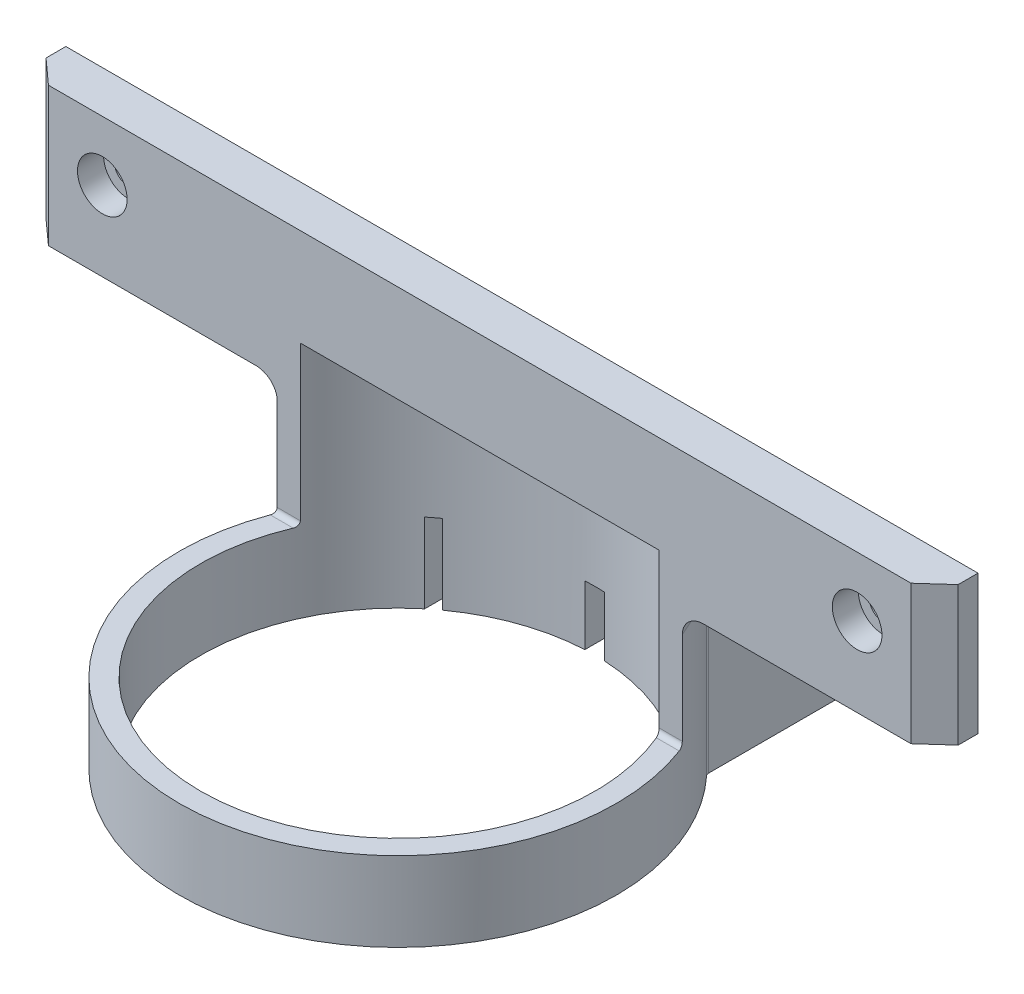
ISO-10303-21;
HEADER;
FILE_DESCRIPTION(('STEP AP214'),'2;1');
FILE_NAME('part.step','',(''),(''),'','','');
FILE_SCHEMA(('AUTOMOTIVE_DESIGN { 1 0 10303 214 1 1 1 1 }'));
ENDSEC;
DATA;
#1=APPLICATION_CONTEXT('core data for automotive mechanical design processes');
#2=APPLICATION_PROTOCOL_DEFINITION('international standard','automotive_design',2000,#1);
#3=PRODUCT_CONTEXT('',#1,'mechanical');
#4=PRODUCT('Part','Part','',(#3));
#5=PRODUCT_RELATED_PRODUCT_CATEGORY('part','',(#4));
#6=PRODUCT_DEFINITION_FORMATION('','',#4);
#7=PRODUCT_DEFINITION_CONTEXT('part definition',#1,'design');
#8=PRODUCT_DEFINITION('design','',#6,#7);
#9=PRODUCT_DEFINITION_SHAPE('','',#8);
#10=(LENGTH_UNIT() NAMED_UNIT(*) SI_UNIT(.MILLI.,.METRE.));
#11=(NAMED_UNIT(*) PLANE_ANGLE_UNIT() SI_UNIT($,.RADIAN.));
#12=(NAMED_UNIT(*) SI_UNIT($,.STERADIAN.) SOLID_ANGLE_UNIT());
#13=UNCERTAINTY_MEASURE_WITH_UNIT(LENGTH_MEASURE(1.E-05),#10,'distance_accuracy_value','');
#14=(GEOMETRIC_REPRESENTATION_CONTEXT(3) GLOBAL_UNCERTAINTY_ASSIGNED_CONTEXT((#13)) GLOBAL_UNIT_ASSIGNED_CONTEXT((#10,
#11,#12)) REPRESENTATION_CONTEXT('',''));
#15=CARTESIAN_POINT('',(0.,0.,0.));
#16=DIRECTION('',(0.,0.,1.));
#17=DIRECTION('',(1.,0.,0.));
#18=AXIS2_PLACEMENT_3D('',#15,#16,#17);
#19=CARTESIAN_POINT('',(0.,-113.8555,19.8374));
#20=DIRECTION('',(0.,1.,0.));
#21=DIRECTION('',(0.,0.,1.));
#22=AXIS2_PLACEMENT_3D('',#19,#20,#21);
#23=CYLINDRICAL_SURFACE('',#22,34.925);
#24=CARTESIAN_POINT('',(0.,-101.0285,19.8374));
#25=DIRECTION('',(0.,-1.,0.));
#26=DIRECTION('',(0.,0.,-1.));
#27=AXIS2_PLACEMENT_3D('',#24,#25,#26);
#28=CIRCLE('',#27,34.925);
#29=CARTESIAN_POINT('',(-17.4625,-101.0285,-10.4085372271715));
#30=VERTEX_POINT('',#29);
#31=CARTESIAN_POINT('',(-25.6116666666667,-101.0285,-3.90703420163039));
#32=VERTEX_POINT('',#31);
#33=EDGE_CURVE('E805',#30,#32,#28,.F.);
#34=ORIENTED_EDGE('',*,*,#33,.T.);
#35=DIRECTION('',(0.,1.,0.));
#36=VECTOR('',#35,1.);
#37=CARTESIAN_POINT('',(-25.6116666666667,-113.8555,-3.90703420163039));
#38=LINE('',#37,#36);
#39=CARTESIAN_POINT('',(-25.6116666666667,-126.5555,-3.90703420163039));
#40=VERTEX_POINT('',#39);
#41=EDGE_CURVE('E709',#32,#40,#38,.F.);
#42=ORIENTED_EDGE('',*,*,#41,.T.);
#43=CARTESIAN_POINT('',(0.,-126.5555,19.8374));
#44=DIRECTION('',(0.,-1.,0.));
#45=DIRECTION('',(0.,0.,-1.));
#46=AXIS2_PLACEMENT_3D('',#43,#44,#45);
#47=CIRCLE('',#46,34.925);
#48=CARTESIAN_POINT('',(25.6116666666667,-126.5555,-3.90703420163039));
#49=VERTEX_POINT('',#48);
#50=EDGE_CURVE('E637',#49,#40,#47,.T.);
#51=ORIENTED_EDGE('',*,*,#50,.F.);
#52=DIRECTION('',(0.,1.,0.));
#53=VECTOR('',#52,1.);
#54=CARTESIAN_POINT('',(25.6116666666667,-113.8555,-3.90703420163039));
#55=LINE('',#54,#53);
#56=CARTESIAN_POINT('',(25.6116666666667,-101.0285,-3.90703420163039));
#57=VERTEX_POINT('',#56);
#58=EDGE_CURVE('E712',#49,#57,#55,.T.);
#59=ORIENTED_EDGE('',*,*,#58,.T.);
#60=CARTESIAN_POINT('',(0.,-101.0285,19.8374));
#61=DIRECTION('',(0.,-1.,0.));
#62=DIRECTION('',(0.,0.,-1.));
#63=AXIS2_PLACEMENT_3D('',#60,#61,#62);
#64=CIRCLE('',#63,34.925);
#65=CARTESIAN_POINT('',(17.4625,-101.0285,-10.4085372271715));
#66=VERTEX_POINT('',#65);
#67=EDGE_CURVE('E802',#57,#66,#64,.F.);
#68=ORIENTED_EDGE('',*,*,#67,.T.);
#69=DIRECTION('',(0.,1.,0.));
#70=VECTOR('',#69,1.);
#71=CARTESIAN_POINT('',(17.4625,-113.8555,-10.4085372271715));
#72=LINE('',#71,#70);
#73=CARTESIAN_POINT('',(17.4625,-117.0305,-10.4085372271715));
#74=VERTEX_POINT('',#73);
#75=EDGE_CURVE('E1122',#66,#74,#72,.F.);
#76=ORIENTED_EDGE('',*,*,#75,.T.);
#77=CARTESIAN_POINT('',(0.,-117.0305,19.8374));
#78=DIRECTION('',(0.,-1.,0.));
#79=DIRECTION('',(0.,0.,1.));
#80=AXIS2_PLACEMENT_3D('',#77,#78,#79);
#81=CIRCLE('',#80,34.925);
#82=CARTESIAN_POINT('',(1.5875,-117.0305,-15.0515017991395));
#83=VERTEX_POINT('',#82);
#84=EDGE_CURVE('E596',#83,#74,#81,.T.);
#85=ORIENTED_EDGE('',*,*,#84,.F.);
#86=CARTESIAN_POINT('',(0.,-117.0305,19.8374));
#87=DIRECTION('',(0.,1.,0.));
#88=DIRECTION('',(0.,0.,1.));
#89=AXIS2_PLACEMENT_3D('',#86,#87,#88);
#90=CIRCLE('',#89,34.925);
#91=CARTESIAN_POINT('',(-1.58749999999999,-117.0305,-15.0515017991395));
#92=VERTEX_POINT('',#91);
#93=EDGE_CURVE('E527',#83,#92,#90,.T.);
#94=ORIENTED_EDGE('',*,*,#93,.T.);
#95=CARTESIAN_POINT('',(-17.4625,-117.0305,-10.4085372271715));
#96=VERTEX_POINT('',#95);
#97=EDGE_CURVE('E598',#96,#92,#81,.T.);
#98=ORIENTED_EDGE('',*,*,#97,.F.);
#99=DIRECTION('',(0.,1.,0.));
#100=VECTOR('',#99,1.);
#101=CARTESIAN_POINT('',(-17.4625,-113.8555,-10.4085372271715));
#102=LINE('',#101,#100);
#103=EDGE_CURVE('E1721',#96,#30,#102,.T.);
#104=ORIENTED_EDGE('',*,*,#103,.T.);
#105=EDGE_LOOP('',(#34,#42,#51,#59,#68,#76,#85,#94,#98,#104));
#106=FACE_BOUND('',#105,.T.);
#107=DIRECTION('',(0.,1.,0.));
#108=VECTOR('',#107,1.);
#109=CARTESIAN_POINT('',(28.5099738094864,-113.8555,-0.335279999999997));
#110=LINE('',#109,#108);
#111=CARTESIAN_POINT('',(28.5099738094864,-88.4555,-0.33527999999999));
#112=VERTEX_POINT('',#111);
#113=CARTESIAN_POINT('',(28.5099738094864,-98.298,-0.335279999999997));
#114=VERTEX_POINT('',#113);
#115=EDGE_CURVE('E705',#112,#114,#110,.F.);
#116=ORIENTED_EDGE('',*,*,#115,.T.);
#117=CARTESIAN_POINT('',(0.,-98.298,19.8374));
#118=DIRECTION('',(0.,-1.,0.));
#119=DIRECTION('',(0.,0.,-1.));
#120=AXIS2_PLACEMENT_3D('',#117,#118,#119);
#121=CIRCLE('',#120,34.925);
#122=CARTESIAN_POINT('',(32.3791662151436,-98.298,6.74751));
#123=VERTEX_POINT('',#122);
#124=EDGE_CURVE('E1049',#114,#123,#121,.T.);
#125=ORIENTED_EDGE('',*,*,#124,.T.);
#126=DIRECTION('',(0.,1.,0.));
#127=VECTOR('',#126,1.);
#128=CARTESIAN_POINT('',(32.3791662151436,-113.8555,6.74751));
#129=LINE('',#128,#127);
#130=CARTESIAN_POINT('',(32.3791662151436,-113.06175,6.74751));
#131=VERTEX_POINT('',#130);
#132=EDGE_CURVE('E682',#131,#123,#129,.T.);
#133=ORIENTED_EDGE('',*,*,#132,.F.);
#134=CARTESIAN_POINT('',(32.3791662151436,-113.06175,6.74751));
#135=CARTESIAN_POINT('',(32.3791658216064,-113.082930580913,6.74750933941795));
#136=CARTESIAN_POINT('',(32.3795091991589,-113.104100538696,6.7483583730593));
#137=CARTESIAN_POINT('',(32.3808760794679,-113.146279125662,6.75174012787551));
#138=CARTESIAN_POINT('',(32.3818994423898,-113.167287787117,6.75427250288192));
#139=CARTESIAN_POINT('',(32.3859686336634,-113.22972193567,6.76434694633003));
#140=CARTESIAN_POINT('',(32.3900136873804,-113.270712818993,6.77436660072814));
#141=CARTESIAN_POINT('',(32.4005878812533,-113.350269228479,6.80061638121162));
#142=CARTESIAN_POINT('',(32.4071163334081,-113.388835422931,6.81684478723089));
#143=CARTESIAN_POINT('',(32.4223877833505,-113.462622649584,6.85491892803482));
#144=CARTESIAN_POINT('',(32.4311317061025,-113.497842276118,6.87676700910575));
#145=CARTESIAN_POINT('',(32.4508099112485,-113.565170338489,6.92611476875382));
#146=CARTESIAN_POINT('',(32.4618041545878,-113.597146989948,6.95376985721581));
#147=CARTESIAN_POINT('',(32.4854164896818,-113.656044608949,7.01342366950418));
#148=CARTESIAN_POINT('',(32.4980350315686,-113.682964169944,7.04542359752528));
#149=CARTESIAN_POINT('',(32.5254216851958,-113.732934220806,7.11521205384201));
#150=CARTESIAN_POINT('',(32.5402779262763,-113.755591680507,7.15324726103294));
#151=CARTESIAN_POINT('',(32.5709551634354,-113.794193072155,7.23223037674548));
#152=CARTESIAN_POINT('',(32.5867764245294,-113.810135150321,7.27317908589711));
#153=CARTESIAN_POINT('',(32.61697658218,-113.83351236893,7.35180802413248));
#154=CARTESIAN_POINT('',(32.6312953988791,-113.8417491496,7.38927595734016));
#155=CARTESIAN_POINT('',(32.6600471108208,-113.852743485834,7.46490573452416));
#156=CARTESIAN_POINT('',(32.6744798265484,-113.855508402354,7.50306657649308));
#157=CARTESIAN_POINT('',(32.6888446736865,-113.8555,7.54126));
#158=B_SPLINE_CURVE_WITH_KNOTS('',3,(#134,#135,#136,#137,#138,#139,#140,#141,#142,#143,#144,
#145,#146,#147,#148,#149,#150,#151,#152,#153,#154,#155,#156,#157),.UNSPECIFIED.,.F.,.F.,(4,2,2,
2,2,2,2,2,2,2,2,4),(0.,0.0635011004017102,0.126989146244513,0.253499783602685,0.379975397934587,
0.506503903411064,0.636990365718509,0.767513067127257,0.90700566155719,1.04653673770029,
1.16901248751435,1.29132336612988),.UNSPECIFIED.);
#159=CARTESIAN_POINT('',(32.6888446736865,-113.8555,7.54126));
#160=VERTEX_POINT('',#159);
#161=EDGE_CURVE('E725',#131,#160,#158,.T.);
#162=ORIENTED_EDGE('',*,*,#161,.T.);
#163=CARTESIAN_POINT('',(0.,-113.8555,19.8374));
#164=DIRECTION('',(0.,-1.,0.));
#165=DIRECTION('',(0.,0.,-1.));
#166=AXIS2_PLACEMENT_3D('',#163,#164,#165);
#167=CIRCLE('',#166,34.925);
#168=CARTESIAN_POINT('',(-32.6888446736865,-113.8555,7.54126));
#169=VERTEX_POINT('',#168);
#170=EDGE_CURVE('E634',#160,#169,#167,.T.);
#171=ORIENTED_EDGE('',*,*,#170,.T.);
#172=CARTESIAN_POINT('',(-32.6888446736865,-113.8555,7.54126));
#173=CARTESIAN_POINT('',(-32.6710766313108,-113.855524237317,7.49401227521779));
#174=CARTESIAN_POINT('',(-32.6531977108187,-113.851282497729,7.44680434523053));
#175=CARTESIAN_POINT('',(-32.6177221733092,-113.834470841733,7.35372144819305));
#176=CARTESIAN_POINT('',(-32.6001259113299,-113.821891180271,7.30784810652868));
#177=CARTESIAN_POINT('',(-32.5657471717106,-113.788592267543,7.21876139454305));
#178=CARTESIAN_POINT('',(-32.5489654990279,-113.767865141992,7.17555064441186));
#179=CARTESIAN_POINT('',(-32.5168114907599,-113.718698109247,7.09320352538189));
#180=CARTESIAN_POINT('',(-32.5014382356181,-113.690263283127,7.05406449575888));
#181=CARTESIAN_POINT('',(-32.4731293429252,-113.62729299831,6.98232546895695));
#182=CARTESIAN_POINT('',(-32.4601331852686,-113.592972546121,6.9495611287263));
#183=CARTESIAN_POINT('',(-32.4365642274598,-113.518502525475,6.89035615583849));
#184=CARTESIAN_POINT('',(-32.4259912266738,-113.478353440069,6.86391499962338));
#185=CARTESIAN_POINT('',(-32.4084169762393,-113.396339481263,6.82007863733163));
#186=CARTESIAN_POINT('',(-32.4012205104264,-113.354781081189,6.80218743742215));
#187=CARTESIAN_POINT('',(-32.3897398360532,-113.268891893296,6.77368619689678));
#188=CARTESIAN_POINT('',(-32.3854505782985,-113.224566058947,6.76306353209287));
#189=CARTESIAN_POINT('',(-32.381539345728,-113.160124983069,6.75338141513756));
#190=CARTESIAN_POINT('',(-32.38064980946,-113.140510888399,6.75118029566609));
#191=CARTESIAN_POINT('',(-32.3794637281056,-113.101184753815,6.74824588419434));
#192=CARTESIAN_POINT('',(-32.3791663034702,-113.081472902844,6.74751041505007));
#193=CARTESIAN_POINT('',(-32.3791662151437,-113.06175,6.74750999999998));
#194=B_SPLINE_CURVE_WITH_KNOTS('',3,(#172,#173,#174,#175,#176,#177,#178,#179,#180,#181,#182,
#183,#184,#185,#186,#187,#188,#189,#190,#191,#192,#193),.UNSPECIFIED.,.F.,.F.,(4,2,2,2,2,2,2,2,
2,2,4),(0.,0.151263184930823,0.302703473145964,0.454290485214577,0.605777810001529,
0.752596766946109,0.899403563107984,1.03614286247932,1.17264406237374,1.23186300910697,
1.29099392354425),.UNSPECIFIED.);
#195=CARTESIAN_POINT('',(-32.3791662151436,-113.06175,6.74751));
#196=VERTEX_POINT('',#195);
#197=EDGE_CURVE('E752',#169,#196,#194,.T.);
#198=ORIENTED_EDGE('',*,*,#197,.T.);
#199=DIRECTION('',(0.,1.,0.));
#200=VECTOR('',#199,1.);
#201=CARTESIAN_POINT('',(-32.3791662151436,-113.8555,6.74751));
#202=LINE('',#201,#200);
#203=CARTESIAN_POINT('',(-32.3791662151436,-98.298,6.74751));
#204=VERTEX_POINT('',#203);
#205=EDGE_CURVE('E662',#196,#204,#202,.T.);
#206=ORIENTED_EDGE('',*,*,#205,.T.);
#207=CARTESIAN_POINT('',(0.,-98.298,19.8374));
#208=DIRECTION('',(0.,-1.,0.));
#209=DIRECTION('',(0.,0.,-1.));
#210=AXIS2_PLACEMENT_3D('',#207,#208,#209);
#211=CIRCLE('',#210,34.925);
#212=CARTESIAN_POINT('',(-28.5099738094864,-98.298,-0.335279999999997));
#213=VERTEX_POINT('',#212);
#214=EDGE_CURVE('E1047',#204,#213,#211,.T.);
#215=ORIENTED_EDGE('',*,*,#214,.T.);
#216=DIRECTION('',(0.,1.,0.));
#217=VECTOR('',#216,1.);
#218=CARTESIAN_POINT('',(-28.5099738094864,-113.8555,-0.335279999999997));
#219=LINE('',#218,#217);
#220=CARTESIAN_POINT('',(-28.5099738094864,-88.4555,-0.33527999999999));
#221=VERTEX_POINT('',#220);
#222=EDGE_CURVE('E707',#213,#221,#219,.T.);
#223=ORIENTED_EDGE('',*,*,#222,.T.);
#224=CARTESIAN_POINT('',(0.,-88.4555,19.8374));
#225=DIRECTION('',(0.,-1.,0.));
#226=DIRECTION('',(0.,0.,-1.));
#227=AXIS2_PLACEMENT_3D('',#224,#225,#226);
#228=CIRCLE('',#227,34.925);
#229=CARTESIAN_POINT('',(-15.0385161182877,-88.4555,-11.684));
#230=VERTEX_POINT('',#229);
#231=EDGE_CURVE('E1105',#221,#230,#228,.T.);
#232=ORIENTED_EDGE('',*,*,#231,.T.);
#233=CARTESIAN_POINT('',(0.,-50.8897583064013,19.8374));
#234=DIRECTION('',(0.,-0.642787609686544,0.766044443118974));
#235=DIRECTION('',(0.,0.766044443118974,0.642787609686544));
#236=AXIS2_PLACEMENT_3D('',#233,#234,#235);
#237=ELLIPSE('',#236,54.3336546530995,34.925);
#238=CARTESIAN_POINT('',(15.0385161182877,-88.4555,-11.684));
#239=VERTEX_POINT('',#238);
#240=EDGE_CURVE('E503',#230,#239,#237,.T.);
#241=ORIENTED_EDGE('',*,*,#240,.T.);
#242=EDGE_CURVE('E640',#239,#112,#228,.T.);
#243=ORIENTED_EDGE('',*,*,#242,.T.);
#244=EDGE_LOOP('',(#116,#125,#133,#162,#171,#198,#206,#215,#223,#232,#241,#243));
#245=FACE_BOUND('',#244,.T.);
#246=ADVANCED_FACE('F42',(#106,#245),#23,.T.);
#247=CARTESIAN_POINT('',(0.,-88.4555,19.8374));
#248=DIRECTION('',(0.,-1.,0.));
#249=DIRECTION('',(0.,0.,-1.));
#250=AXIS2_PLACEMENT_3D('',#247,#248,#249);
#251=PLANE('',#250);
#252=CARTESIAN_POINT('',(0.,-88.4555,19.8374));
#253=DIRECTION('',(0.,-1.,0.));
#254=DIRECTION('',(0.,0.,-1.));
#255=AXIS2_PLACEMENT_3D('',#252,#253,#254);
#256=CIRCLE('',#255,31.5214);
#257=CARTESIAN_POINT('',(24.393060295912,-88.4555,-0.126999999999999));
#258=VERTEX_POINT('',#257);
#259=CARTESIAN_POINT('',(0.,-88.4555,-11.684));
#260=VERTEX_POINT('',#259);
#261=EDGE_CURVE('E1103',#258,#260,#256,.F.);
#262=ORIENTED_EDGE('',*,*,#261,.F.);
#263=DIRECTION('',(-1.,0.,0.));
#264=VECTOR('',#263,1.);
#265=CARTESIAN_POINT('',(0.,-88.4555,-0.126999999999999));
#266=LINE('',#265,#264);
#267=CARTESIAN_POINT('',(28.7272498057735,-88.4555,-0.127));
#268=VERTEX_POINT('',#267);
#269=EDGE_CURVE('E1029',#258,#268,#266,.F.);
#270=ORIENTED_EDGE('',*,*,#269,.T.);
#271=CARTESIAN_POINT('',(29.157927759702,-88.4555,-0.793749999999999));
#272=DIRECTION('',(0.,-1.,0.));
#273=DIRECTION('',(0.,0.,-1.));
#274=AXIS2_PLACEMENT_3D('',#271,#272,#273);
#275=CIRCLE('',#274,0.79375);
#276=EDGE_CURVE('E782',#268,#112,#275,.T.);
#277=ORIENTED_EDGE('',*,*,#276,.T.);
#278=ORIENTED_EDGE('',*,*,#242,.F.);
#279=DIRECTION('',(-1.,0.,0.));
#280=VECTOR('',#279,1.);
#281=CARTESIAN_POINT('',(0.,-88.4555,-11.684));
#282=LINE('',#281,#280);
#283=EDGE_CURVE('E1119',#239,#260,#282,.T.);
#284=ORIENTED_EDGE('',*,*,#283,.T.);
#285=EDGE_LOOP('',(#262,#270,#277,#278,#284));
#286=FACE_BOUND('',#285,.T.);
#287=ADVANCED_FACE('F1118',(#286),#251,.F.);
#288=CARTESIAN_POINT('',(0.,-126.5555,19.8374));
#289=DIRECTION('',(0.,-1.,0.));
#290=DIRECTION('',(0.,0.,-1.));
#291=AXIS2_PLACEMENT_3D('',#288,#289,#290);
#292=PLANE('',#291);
#293=DIRECTION('',(0.,0.,-1.));
#294=VECTOR('',#293,1.);
#295=CARTESIAN_POINT('',(-1.58749999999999,-126.5555,-18.1775399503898));
#296=LINE('',#295,#294);
#297=CARTESIAN_POINT('',(-1.58749999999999,-126.5555,-11.6439992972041));
#298=VERTEX_POINT('',#297);
#299=CARTESIAN_POINT('',(-1.58749999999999,-126.5555,-16.27505));
#300=VERTEX_POINT('',#299);
#301=EDGE_CURVE('E507',#298,#300,#296,.T.);
#302=ORIENTED_EDGE('',*,*,#301,.F.);
#303=CARTESIAN_POINT('',(0.,-126.5555,19.8374));
#304=DIRECTION('',(0.,-1.,0.));
#305=DIRECTION('',(0.,0.,-1.));
#306=AXIS2_PLACEMENT_3D('',#303,#304,#305);
#307=CIRCLE('',#306,31.5214);
#308=CARTESIAN_POINT('',(-18.44675,-126.5555,-5.72264836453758));
#309=VERTEX_POINT('',#308);
#310=EDGE_CURVE('E631',#309,#298,#307,.T.);
#311=ORIENTED_EDGE('',*,*,#310,.F.);
#312=DIRECTION('',(0.,0.,1.));
#313=VECTOR('',#312,1.);
#314=CARTESIAN_POINT('',(-18.44675,-126.5555,-16.27505));
#315=LINE('',#314,#313);
#316=CARTESIAN_POINT('',(-18.44675,-126.5555,-16.27505));
#317=VERTEX_POINT('',#316);
#318=EDGE_CURVE('E551',#317,#309,#315,.T.);
#319=ORIENTED_EDGE('',*,*,#318,.F.);
#320=DIRECTION('',(-1.,0.,0.));
#321=VECTOR('',#320,1.);
#322=CARTESIAN_POINT('',(-20.03425,-126.5555,-16.27505));
#323=LINE('',#322,#321);
#324=EDGE_CURVE('E582',#300,#317,#323,.T.);
#325=ORIENTED_EDGE('',*,*,#324,.F.);
#326=EDGE_LOOP('',(#302,#311,#319,#325));
#327=FACE_BOUND('',#326,.T.);
#328=ADVANCED_FACE('F1174',(#327),#292,.T.);
#329=CARTESIAN_POINT('',(0.,-117.0305,19.8374));
#330=DIRECTION('',(0.,1.,0.));
#331=DIRECTION('',(0.,0.,1.));
#332=AXIS2_PLACEMENT_3D('',#329,#330,#331);
#333=PLANE('',#332);
#334=DIRECTION('',(0.,0.,-1.));
#335=VECTOR('',#334,1.);
#336=CARTESIAN_POINT('',(-18.44675,-117.0305,19.8374));
#337=LINE('',#336,#335);
#338=CARTESIAN_POINT('',(-18.44675,-117.0305,-10.0410033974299));
#339=VERTEX_POINT('',#338);
#340=CARTESIAN_POINT('',(-18.44675,-117.0305,-16.27505));
#341=VERTEX_POINT('',#340);
#342=EDGE_CURVE('E566',#339,#341,#337,.T.);
#343=ORIENTED_EDGE('',*,*,#342,.F.);
#344=CARTESIAN_POINT('',(-19.05,-117.0305,-13.1581678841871));
#345=DIRECTION('',(0.,1.,0.));
#346=DIRECTION('',(0.,0.,1.));
#347=AXIS2_PLACEMENT_3D('',#344,#345,#346);
#348=CIRCLE('',#347,3.175);
#349=EDGE_CURVE('E1726',#339,#96,#348,.T.);
#350=ORIENTED_EDGE('',*,*,#349,.T.);
#351=ORIENTED_EDGE('',*,*,#97,.T.);
#352=DIRECTION('',(0.,0.,-1.));
#353=VECTOR('',#352,1.);
#354=CARTESIAN_POINT('',(-1.58749999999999,-117.0305,-18.1775399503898));
#355=LINE('',#354,#353);
#356=CARTESIAN_POINT('',(-1.58749999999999,-117.0305,-16.27505));
#357=VERTEX_POINT('',#356);
#358=EDGE_CURVE('E509',#92,#357,#355,.T.);
#359=ORIENTED_EDGE('',*,*,#358,.T.);
#360=DIRECTION('',(-1.,0.,0.));
#361=VECTOR('',#360,1.);
#362=CARTESIAN_POINT('',(-20.03425,-117.0305,-16.27505));
#363=LINE('',#362,#361);
#364=EDGE_CURVE('E568',#357,#341,#363,.T.);
#365=ORIENTED_EDGE('',*,*,#364,.T.);
#366=EDGE_LOOP('',(#343,#350,#351,#359,#365));
#367=FACE_BOUND('',#366,.T.);
#368=ADVANCED_FACE('F1230',(#367),#333,.T.);
#369=CARTESIAN_POINT('',(-20.03425,-72.897,-16.27505));
#370=DIRECTION('',(0.,0.,1.));
#371=DIRECTION('',(1.,0.,0.));
#372=AXIS2_PLACEMENT_3D('',#369,#370,#371);
#373=PLANE('',#372);
#374=ORIENTED_EDGE('',*,*,#364,.F.);
#375=DIRECTION('',(0.,-1.,0.));
#376=VECTOR('',#375,1.);
#377=CARTESIAN_POINT('',(-1.5875,-72.897,-16.27505));
#378=LINE('',#377,#376);
#379=EDGE_CURVE('E1812',#357,#300,#378,.T.);
#380=ORIENTED_EDGE('',*,*,#379,.T.);
#381=ORIENTED_EDGE('',*,*,#324,.T.);
#382=DIRECTION('',(0.,1.,0.));
#383=VECTOR('',#382,1.);
#384=CARTESIAN_POINT('',(-18.44675,-72.897,-16.27505));
#385=LINE('',#384,#383);
#386=EDGE_CURVE('E1081',#317,#341,#385,.T.);
#387=ORIENTED_EDGE('',*,*,#386,.T.);
#388=EDGE_LOOP('',(#374,#380,#381,#387));
#389=FACE_BOUND('',#388,.T.);
#390=ADVANCED_FACE('F1238',(#389),#373,.F.);
#391=DIRECTION('',(0.,0.,1.));
#392=VECTOR('',#391,1.);
#393=CARTESIAN_POINT('',(1.5875,-126.5555,-18.1775399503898));
#394=LINE('',#393,#392);
#395=CARTESIAN_POINT('',(1.5875,-126.5555,-16.27505));
#396=VERTEX_POINT('',#395);
#397=CARTESIAN_POINT('',(1.5875,-126.5555,-11.6439992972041));
#398=VERTEX_POINT('',#397);
#399=EDGE_CURVE('E506',#396,#398,#394,.T.);
#400=ORIENTED_EDGE('',*,*,#399,.F.);
#401=CARTESIAN_POINT('',(18.4391546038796,-126.5555,-16.27505));
#402=VERTEX_POINT('',#401);
#403=EDGE_CURVE('E583',#402,#396,#323,.T.);
#404=ORIENTED_EDGE('',*,*,#403,.F.);
#405=DIRECTION('',(0.,0.,-1.));
#406=VECTOR('',#405,1.);
#407=CARTESIAN_POINT('',(18.4391546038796,-126.5555,-16.27505));
#408=LINE('',#407,#406);
#409=CARTESIAN_POINT('',(18.4391546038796,-126.5555,-5.72812826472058));
#410=VERTEX_POINT('',#409);
#411=EDGE_CURVE('E530',#410,#402,#408,.T.);
#412=ORIENTED_EDGE('',*,*,#411,.F.);
#413=EDGE_CURVE('E635',#398,#410,#307,.T.);
#414=ORIENTED_EDGE('',*,*,#413,.F.);
#415=EDGE_LOOP('',(#400,#404,#412,#414));
#416=FACE_BOUND('',#415,.T.);
#417=ADVANCED_FACE('F1226',(#416),#292,.T.);
#418=ORIENTED_EDGE('',*,*,#84,.T.);
#419=CARTESIAN_POINT('',(19.05,-117.0305,-13.1581678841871));
#420=DIRECTION('',(0.,1.,0.));
#421=DIRECTION('',(0.,0.,1.));
#422=AXIS2_PLACEMENT_3D('',#419,#420,#421);
#423=CIRCLE('',#422,3.175);
#424=CARTESIAN_POINT('',(18.4391546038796,-117.0305,-10.042482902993));
#425=VERTEX_POINT('',#424);
#426=EDGE_CURVE('E1730',#74,#425,#423,.T.);
#427=ORIENTED_EDGE('',*,*,#426,.T.);
#428=DIRECTION('',(0.,0.,1.));
#429=VECTOR('',#428,1.);
#430=CARTESIAN_POINT('',(18.4391546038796,-117.0305,19.8374));
#431=LINE('',#430,#429);
#432=CARTESIAN_POINT('',(18.4391546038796,-117.0305,-16.27505));
#433=VERTEX_POINT('',#432);
#434=EDGE_CURVE('E548',#433,#425,#431,.T.);
#435=ORIENTED_EDGE('',*,*,#434,.F.);
#436=CARTESIAN_POINT('',(1.58750000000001,-117.0305,-16.27505));
#437=VERTEX_POINT('',#436);
#438=EDGE_CURVE('E569',#433,#437,#363,.T.);
#439=ORIENTED_EDGE('',*,*,#438,.T.);
#440=DIRECTION('',(0.,0.,1.));
#441=VECTOR('',#440,1.);
#442=CARTESIAN_POINT('',(1.5875,-117.0305,-18.1775399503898));
#443=LINE('',#442,#441);
#444=EDGE_CURVE('E514',#437,#83,#443,.T.);
#445=ORIENTED_EDGE('',*,*,#444,.T.);
#446=EDGE_LOOP('',(#418,#427,#435,#439,#445));
#447=FACE_BOUND('',#446,.T.);
#448=ADVANCED_FACE('F1215',(#447),#333,.T.);
#449=CARTESIAN_POINT('',(0.,-101.1555,19.8374));
#450=DIRECTION('',(0.,-1.,0.));
#451=DIRECTION('',(0.,0.,-1.));
#452=AXIS2_PLACEMENT_3D('',#449,#450,#451);
#453=PLANE('',#452);
#454=CARTESIAN_POINT('',(19.05,-101.1555,-13.1581678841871));
#455=DIRECTION('',(0.,-1.,0.));
#456=DIRECTION('',(0.,0.,-1.));
#457=AXIS2_PLACEMENT_3D('',#454,#455,#456);
#458=CIRCLE('',#457,3.175);
#459=CARTESIAN_POINT('',(22.225,-101.1555,-13.1581678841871));
#460=VERTEX_POINT('',#459);
#461=CARTESIAN_POINT('',(18.2592183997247,-101.1555,-10.0832224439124));
#462=VERTEX_POINT('',#461);
#463=EDGE_CURVE('E1741',#460,#462,#458,.T.);
#464=ORIENTED_EDGE('',*,*,#463,.T.);
#465=CARTESIAN_POINT('',(0.,-101.1555,19.8374));
#466=DIRECTION('',(0.,-1.,0.));
#467=DIRECTION('',(0.,0.,-1.));
#468=AXIS2_PLACEMENT_3D('',#465,#466,#467);
#469=CIRCLE('',#468,35.052);
#470=CARTESIAN_POINT('',(25.412842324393,-101.1555,-4.30447542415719));
#471=VERTEX_POINT('',#470);
#472=EDGE_CURVE('E810',#462,#471,#469,.T.);
#473=ORIENTED_EDGE('',*,*,#472,.T.);
#474=CARTESIAN_POINT('',(26.19375,-101.1555,-4.44668043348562));
#475=DIRECTION('',(0.,-1.,0.));
#476=DIRECTION('',(0.,0.,-1.));
#477=AXIS2_PLACEMENT_3D('',#474,#475,#476);
#478=CIRCLE('',#477,0.79375);
#479=CARTESIAN_POINT('',(25.4,-101.1555,-4.44668043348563));
#480=VERTEX_POINT('',#479);
#481=EDGE_CURVE('E772',#471,#480,#478,.T.);
#482=ORIENTED_EDGE('',*,*,#481,.T.);
#483=DIRECTION('',(0.,0.,1.));
#484=VECTOR('',#483,1.);
#485=CARTESIAN_POINT('',(25.4,-101.1555,-26.99004));
#486=LINE('',#485,#484);
#487=CARTESIAN_POINT('',(25.4,-101.1555,-26.99004));
#488=VERTEX_POINT('',#487);
#489=EDGE_CURVE('E612',#488,#480,#486,.T.);
#490=ORIENTED_EDGE('',*,*,#489,.F.);
#491=DIRECTION('',(1.,0.,0.));
#492=VECTOR('',#491,1.);
#493=CARTESIAN_POINT('',(-25.4,-101.1555,-26.99004));
#494=LINE('',#493,#492);
#495=CARTESIAN_POINT('',(22.225,-101.1555,-26.99004));
#496=VERTEX_POINT('',#495);
#497=EDGE_CURVE('E613',#496,#488,#494,.T.);
#498=ORIENTED_EDGE('',*,*,#497,.F.);
#499=DIRECTION('',(0.,0.,-1.));
#500=VECTOR('',#499,1.);
#501=CARTESIAN_POINT('',(22.225,-101.1555,-26.99004));
#502=LINE('',#501,#500);
#503=EDGE_CURVE('E592',#460,#496,#502,.T.);
#504=ORIENTED_EDGE('',*,*,#503,.F.);
#505=EDGE_LOOP('',(#464,#473,#482,#490,#498,#504));
#506=FACE_BOUND('',#505,.T.);
#507=ADVANCED_FACE('F899',(#506),#453,.F.);
#508=CARTESIAN_POINT('',(-23.14104494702,-93.218,0.));
#509=DIRECTION('',(0.,0.,-1.));
#510=DIRECTION('',(-1.,0.,0.));
#511=AXIS2_PLACEMENT_3D('',#508,#509,#510);
#512=PLANE('',#511);
#513=CARTESIAN_POINT('',(60.325,-82.423,0.));
#514=DIRECTION('',(0.,0.,-1.));
#515=DIRECTION('',(-1.,0.,0.));
#516=AXIS2_PLACEMENT_3D('',#513,#514,#515);
#517=CIRCLE('',#516,2.2479);
#518=CARTESIAN_POINT('',(58.0771,-82.423,0.));
#519=VERTEX_POINT('',#518);
#520=EDGE_CURVE('E492',#519,#519,#517,.T.);
#521=ORIENTED_EDGE('',*,*,#520,.F.);
#522=EDGE_LOOP('',(#521));
#523=FACE_BOUND('',#522,.T.);
#524=CARTESIAN_POINT('',(-60.325,-82.423,0.));
#525=DIRECTION('',(0.,0.,-1.));
#526=DIRECTION('',(-1.,0.,0.));
#527=AXIS2_PLACEMENT_3D('',#524,#525,#526);
#528=CIRCLE('',#527,2.2479);
#529=CARTESIAN_POINT('',(-62.5729,-82.423,0.));
#530=VERTEX_POINT('',#529);
#531=EDGE_CURVE('E502',#530,#530,#528,.T.);
#532=ORIENTED_EDGE('',*,*,#531,.F.);
#533=EDGE_LOOP('',(#532));
#534=FACE_BOUND('',#533,.T.);
#535=DIRECTION('',(-1.,0.,0.));
#536=VECTOR('',#535,1.);
#537=CARTESIAN_POINT('',(-23.14104494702,-88.3285,0.));
#538=LINE('',#537,#536);
#539=CARTESIAN_POINT('',(29.157927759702,-88.3285,0.));
#540=VERTEX_POINT('',#539);
#541=CARTESIAN_POINT('',(24.4964531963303,-88.3285,0.));
#542=VERTEX_POINT('',#541);
#543=EDGE_CURVE('E1027',#540,#542,#538,.T.);
#544=ORIENTED_EDGE('',*,*,#543,.T.);
#545=DIRECTION('',(0.,1.,0.));
#546=VECTOR('',#545,1.);
#547=CARTESIAN_POINT('',(24.4964531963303,-88.5825,0.));
#548=LINE('',#547,#546);
#549=CARTESIAN_POINT('',(24.4964531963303,-88.5825,0.));
#550=VERTEX_POINT('',#549);
#551=EDGE_CURVE('E1019',#550,#542,#548,.T.);
#552=ORIENTED_EDGE('',*,*,#551,.F.);
#553=CARTESIAN_POINT('',(24.4964531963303,-88.5825,0.));
#554=CARTESIAN_POINT('',(24.4964650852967,-88.5764725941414,0.));
#555=CARTESIAN_POINT('',(24.4959019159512,-88.5704562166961,0.));
#556=CARTESIAN_POINT('',(24.4937254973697,-88.5586551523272,0.));
#557=CARTESIAN_POINT('',(24.4921190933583,-88.5528692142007,0.));
#558=CARTESIAN_POINT('',(24.4879577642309,-88.5416662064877,0.));
#559=CARTESIAN_POINT('',(24.4854045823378,-88.5362484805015,0.));
#560=CARTESIAN_POINT('',(24.4794876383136,-88.5258706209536,0.));
#561=CARTESIAN_POINT('',(24.476122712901,-88.5209111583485,0.));
#562=CARTESIAN_POINT('',(24.4684449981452,-88.5111631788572,0.));
#563=CARTESIAN_POINT('',(24.4640795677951,-88.5064163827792,0.));
#564=CARTESIAN_POINT('',(24.4547427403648,-88.4975685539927,0.));
#565=CARTESIAN_POINT('',(24.4497711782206,-88.493467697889,0.));
#566=CARTESIAN_POINT('',(24.4367770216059,-88.484043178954,0.));
#567=CARTESIAN_POINT('',(24.4284627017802,-88.4791196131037,0.));
#568=CARTESIAN_POINT('',(24.4111297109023,-88.4706817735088,0.));
#569=CARTESIAN_POINT('',(24.4021088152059,-88.4671721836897,0.));
#570=CARTESIAN_POINT('',(24.3831334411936,-88.4613680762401,0.));
#571=CARTESIAN_POINT('',(24.3731549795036,-88.4591527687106,0.));
#572=CARTESIAN_POINT('',(24.3530512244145,-88.4562262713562,0.));
#573=CARTESIAN_POINT('',(24.3429274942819,-88.4555044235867,0.));
#574=CARTESIAN_POINT('',(24.3328155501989,-88.4555,0.));
#575=B_SPLINE_CURVE_WITH_KNOTS('',3,(#553,#554,#555,#556,#557,#558,#559,#560,#561,#562,#563,
#564,#565,#566,#567,#568,#569,#570,#571,#572,#573,#574),.UNSPECIFIED.,.F.,.F.,(4,2,2,2,2,2,2,2,
2,2,4),(0.,0.0180385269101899,0.0359598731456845,0.0538483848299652,0.071762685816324,
0.0910400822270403,0.11032274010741,0.139154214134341,0.168080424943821,0.198629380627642,
0.22895956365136),.UNSPECIFIED.);
#576=CARTESIAN_POINT('',(24.3328155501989,-88.4555,0.));
#577=VERTEX_POINT('',#576);
#578=EDGE_CURVE('E915',#550,#577,#575,.T.);
#579=ORIENTED_EDGE('',*,*,#578,.T.);
#580=DIRECTION('',(1.,0.,0.));
#581=VECTOR('',#580,1.);
#582=CARTESIAN_POINT('',(-24.4964531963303,-88.4555,0.));
#583=LINE('',#582,#581);
#584=CARTESIAN_POINT('',(-24.3328155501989,-88.4555,0.));
#585=VERTEX_POINT('',#584);
#586=EDGE_CURVE('E667',#585,#577,#583,.T.);
#587=ORIENTED_EDGE('',*,*,#586,.F.);
#588=CARTESIAN_POINT('',(-24.3328155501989,-88.4555,0.));
#589=CARTESIAN_POINT('',(-24.3435258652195,-88.4555052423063,0.));
#590=CARTESIAN_POINT('',(-24.3542531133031,-88.4563149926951,0.));
#591=CARTESIAN_POINT('',(-24.3755197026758,-88.4596002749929,0.));
#592=CARTESIAN_POINT('',(-24.3860573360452,-88.4620867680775,0.));
#593=CARTESIAN_POINT('',(-24.4052828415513,-88.4683621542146,0.));
#594=CARTESIAN_POINT('',(-24.414036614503,-88.4719477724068,0.));
#595=CARTESIAN_POINT('',(-24.4308408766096,-88.4804808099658,0.));
#596=CARTESIAN_POINT('',(-24.4388931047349,-88.4854247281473,0.));
#597=CARTESIAN_POINT('',(-24.4523293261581,-88.4954814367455,0.));
#598=CARTESIAN_POINT('',(-24.4579136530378,-88.5003261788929,0.));
#599=CARTESIAN_POINT('',(-24.4682296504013,-88.5108574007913,0.));
#600=CARTESIAN_POINT('',(-24.4729620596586,-88.5165431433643,0.));
#601=CARTESIAN_POINT('',(-24.4806203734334,-88.5276688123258,0.));
#602=CARTESIAN_POINT('',(-24.4837159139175,-88.5329917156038,0.));
#603=CARTESIAN_POINT('',(-24.4889778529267,-88.5440747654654,0.));
#604=CARTESIAN_POINT('',(-24.4911459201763,-88.5498341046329,0.));
#605=CARTESIAN_POINT('',(-24.493989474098,-88.5600854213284,0.));
#606=CARTESIAN_POINT('',(-24.4949078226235,-88.5645109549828,0.));
#607=CARTESIAN_POINT('',(-24.4961422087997,-88.5734561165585,0.));
#608=CARTESIAN_POINT('',(-24.4964567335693,-88.5779759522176,0.));
#609=CARTESIAN_POINT('',(-24.4964531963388,-88.5824999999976,0.));
#610=B_SPLINE_CURVE_WITH_KNOTS('',3,(#588,#589,#590,#591,#592,#593,#594,#595,#596,#597,#598,
#599,#600,#601,#602,#603,#604,#605,#606,#607,#608,#609),.UNSPECIFIED.,.F.,.F.,(4,2,2,2,2,2,2,2,
2,2,4),(0.,0.0321295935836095,0.0644712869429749,0.0927430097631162,0.120942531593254,
0.143039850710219,0.165117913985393,0.183515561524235,0.201879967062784,0.215400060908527,
0.228953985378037),.UNSPECIFIED.);
#611=CARTESIAN_POINT('',(-24.4964531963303,-88.5825,0.));
#612=VERTEX_POINT('',#611);
#613=EDGE_CURVE('E906',#585,#612,#610,.T.);
#614=ORIENTED_EDGE('',*,*,#613,.T.);
#615=DIRECTION('',(0.,1.,0.));
#616=VECTOR('',#615,1.);
#617=CARTESIAN_POINT('',(-24.4964531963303,-88.4555,0.));
#618=LINE('',#617,#616);
#619=CARTESIAN_POINT('',(-24.4964531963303,-88.3285,0.));
#620=VERTEX_POINT('',#619);
#621=EDGE_CURVE('E812',#612,#620,#618,.T.);
#622=ORIENTED_EDGE('',*,*,#621,.T.);
#623=DIRECTION('',(-1.,0.,0.));
#624=VECTOR('',#623,1.);
#625=CARTESIAN_POINT('',(-23.14104494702,-88.3285,0.));
#626=LINE('',#625,#624);
#627=CARTESIAN_POINT('',(-29.157927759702,-88.3285,0.));
#628=VERTEX_POINT('',#627);
#629=EDGE_CURVE('E815',#620,#628,#626,.T.);
#630=ORIENTED_EDGE('',*,*,#629,.T.);
#631=DIRECTION('',(0.,1.,0.));
#632=VECTOR('',#631,1.);
#633=CARTESIAN_POINT('',(-29.157927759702,-93.218,0.));
#634=LINE('',#633,#632);
#635=CARTESIAN_POINT('',(-29.157927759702,-96.8660818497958,0.));
#636=VERTEX_POINT('',#635);
#637=EDGE_CURVE('E61',#628,#636,#634,.F.);
#638=ORIENTED_EDGE('',*,*,#637,.T.);
#639=CARTESIAN_POINT('',(-29.157927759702,-96.8660818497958,0.));
#640=CARTESIAN_POINT('',(-29.2087621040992,-96.7829048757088,0.));
#641=CARTESIAN_POINT('',(-29.2635703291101,-96.7022568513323,0.));
#642=CARTESIAN_POINT('',(-29.3802981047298,-96.5464059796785,0.));
#643=CARTESIAN_POINT('',(-29.4422101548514,-96.47119752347,0.));
#644=CARTESIAN_POINT('',(-29.636609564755,-96.2550734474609,0.));
#645=CARTESIAN_POINT('',(-29.7784951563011,-96.1224853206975,0.));
#646=CARTESIAN_POINT('',(-30.0805693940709,-95.8819732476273,0.));
#647=CARTESIAN_POINT('',(-30.240681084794,-95.7739509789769,0.));
#648=CARTESIAN_POINT('',(-30.575225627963,-95.5821305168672,0.));
#649=CARTESIAN_POINT('',(-30.7496910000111,-95.4983893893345,0.));
#650=CARTESIAN_POINT('',(-31.1341236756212,-95.3455593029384,0.));
#651=CARTESIAN_POINT('',(-31.3456015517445,-95.2802741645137,0.));
#652=CARTESIAN_POINT('',(-31.7756671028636,-95.1826133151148,0.));
#653=CARTESIAN_POINT('',(-31.9942424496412,-95.1501833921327,0.));
#654=CARTESIAN_POINT('',(-32.3185257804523,-95.1267844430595,0.));
#655=CARTESIAN_POINT('',(-32.4234156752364,-95.1229979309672,0.));
#656=CARTESIAN_POINT('',(-32.5282578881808,-95.123,0.));
#657=B_SPLINE_CURVE_WITH_KNOTS('',3,(#639,#640,#641,#642,#643,#644,#645,#646,#647,#648,#649,
#650,#651,#652,#653,#654,#655,#656),.UNSPECIFIED.,.F.,.F.,(4,2,2,2,2,2,2,2,4),(0.,
0.292183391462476,0.584061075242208,1.16372095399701,1.74101828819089,2.31966159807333,
2.980992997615,3.64123139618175,3.95581741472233),.UNSPECIFIED.);
#658=CARTESIAN_POINT('',(-32.5282578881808,-95.123,0.));
#659=VERTEX_POINT('',#658);
#660=EDGE_CURVE('E12',#636,#659,#657,.T.);
#661=ORIENTED_EDGE('',*,*,#660,.T.);
#662=DIRECTION('',(1.,0.,0.));
#663=VECTOR('',#662,1.);
#664=CARTESIAN_POINT('',(-72.898,-95.123,0.));
#665=LINE('',#664,#663);
#666=CARTESIAN_POINT('',(-72.898,-95.123,0.));
#667=VERTEX_POINT('',#666);
#668=EDGE_CURVE('E467',#667,#659,#665,.T.);
#669=ORIENTED_EDGE('',*,*,#668,.F.);
#670=DIRECTION('',(0.,1.,0.));
#671=VECTOR('',#670,1.);
#672=CARTESIAN_POINT('',(-72.898,-93.218,0.));
#673=LINE('',#672,#671);
#674=CARTESIAN_POINT('',(-72.898,-72.898,0.));
#675=VERTEX_POINT('',#674);
#676=EDGE_CURVE('E1073',#667,#675,#673,.T.);
#677=ORIENTED_EDGE('',*,*,#676,.T.);
#678=DIRECTION('',(-1.,0.,0.));
#679=VECTOR('',#678,1.);
#680=CARTESIAN_POINT('',(-23.14104494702,-72.898,0.));
#681=LINE('',#680,#679);
#682=CARTESIAN_POINT('',(72.898,-72.898,0.));
#683=VERTEX_POINT('',#682);
#684=EDGE_CURVE('E1070',#683,#675,#681,.T.);
#685=ORIENTED_EDGE('',*,*,#684,.F.);
#686=DIRECTION('',(0.,1.,0.));
#687=VECTOR('',#686,1.);
#688=CARTESIAN_POINT('',(72.898,-93.218,0.));
#689=LINE('',#688,#687);
#690=CARTESIAN_POINT('',(72.898,-95.123,0.));
#691=VERTEX_POINT('',#690);
#692=EDGE_CURVE('E1067',#691,#683,#689,.T.);
#693=ORIENTED_EDGE('',*,*,#692,.F.);
#694=DIRECTION('',(1.,0.,0.));
#695=VECTOR('',#694,1.);
#696=CARTESIAN_POINT('',(72.898,-95.123,0.));
#697=LINE('',#696,#695);
#698=CARTESIAN_POINT('',(32.5282578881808,-95.123,0.));
#699=VERTEX_POINT('',#698);
#700=EDGE_CURVE('E471',#699,#691,#697,.T.);
#701=ORIENTED_EDGE('',*,*,#700,.F.);
#702=CARTESIAN_POINT('',(32.5282578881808,-95.123,0.));
#703=CARTESIAN_POINT('',(32.2588579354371,-95.1230170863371,0.));
#704=CARTESIAN_POINT('',(31.9892076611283,-95.1480085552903,0.));
#705=CARTESIAN_POINT('',(31.4566679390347,-95.2476280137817,0.));
#706=CARTESIAN_POINT('',(31.1938645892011,-95.3227150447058,0.));
#707=CARTESIAN_POINT('',(30.7126331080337,-95.5123442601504,0.));
#708=CARTESIAN_POINT('',(30.4923852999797,-95.6222606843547,0.));
#709=CARTESIAN_POINT('',(30.07741498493,-95.8809468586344,0.));
#710=CARTESIAN_POINT('',(29.8825385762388,-96.029464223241,0.));
#711=CARTESIAN_POINT('',(29.6001800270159,-96.2953735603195,0.));
#712=CARTESIAN_POINT('',(29.5012985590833,-96.4007809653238,0.));
#713=CARTESIAN_POINT('',(29.3179606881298,-96.6242182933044,0.));
#714=CARTESIAN_POINT('',(29.2335701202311,-96.7423020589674,0.));
#715=CARTESIAN_POINT('',(29.157927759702,-96.8660818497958,0.));
#716=B_SPLINE_CURVE_WITH_KNOTS('',3,(#702,#703,#704,#705,#706,#707,#708,#709,#710,#711,#712,
#713,#714,#715),.UNSPECIFIED.,.F.,.F.,(4,2,2,2,2,2,4),(0.,0.807540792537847,1.62258487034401,
2.35718316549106,3.08709422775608,3.51951841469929,3.95385800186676),.UNSPECIFIED.);
#717=CARTESIAN_POINT('',(29.157927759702,-96.8660818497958,0.));
#718=VERTEX_POINT('',#717);
#719=EDGE_CURVE('E923',#699,#718,#716,.T.);
#720=ORIENTED_EDGE('',*,*,#719,.T.);
#721=DIRECTION('',(0.,1.,0.));
#722=VECTOR('',#721,1.);
#723=CARTESIAN_POINT('',(29.157927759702,-93.218,0.));
#724=LINE('',#723,#722);
#725=EDGE_CURVE('E69',#718,#540,#724,.T.);
#726=ORIENTED_EDGE('',*,*,#725,.T.);
#727=EDGE_LOOP('',(#544,#552,#579,#587,#614,#622,#630,#638,#661,#669,#677,#685,#693,#701,#720,#726));
#728=FACE_BOUND('',#727,.T.);
#729=ADVANCED_FACE('F894',(#523,#534,#728),#512,.T.);
#730=CARTESIAN_POINT('',(72.898,-93.218,0.));
#731=DIRECTION('',(1.,0.,0.));
#732=DIRECTION('',(0.,0.,-1.));
#733=AXIS2_PLACEMENT_3D('',#730,#731,#732);
#734=PLANE('',#733);
#735=DIRECTION('',(0.,0.,-1.));
#736=VECTOR('',#735,1.);
#737=CARTESIAN_POINT('',(72.898,-72.898,0.));
#738=LINE('',#737,#736);
#739=CARTESIAN_POINT('',(72.898,-72.898,3.175));
#740=VERTEX_POINT('',#739);
#741=EDGE_CURVE('E686',#740,#683,#738,.T.);
#742=ORIENTED_EDGE('',*,*,#741,.F.);
#743=DIRECTION('',(0.,1.,0.));
#744=VECTOR('',#743,1.);
#745=CARTESIAN_POINT('',(72.898,-93.218,3.175));
#746=LINE('',#745,#744);
#747=CARTESIAN_POINT('',(72.898,-95.123,3.175));
#748=VERTEX_POINT('',#747);
#749=EDGE_CURVE('E1075',#748,#740,#746,.T.);
#750=ORIENTED_EDGE('',*,*,#749,.F.);
#751=DIRECTION('',(0.,0.,1.));
#752=VECTOR('',#751,1.);
#753=CARTESIAN_POINT('',(72.898,-95.123,3.175));
#754=LINE('',#753,#752);
#755=EDGE_CURVE('E473',#691,#748,#754,.T.);
#756=ORIENTED_EDGE('',*,*,#755,.F.);
#757=ORIENTED_EDGE('',*,*,#692,.T.);
#758=EDGE_LOOP('',(#742,#750,#756,#757));
#759=FACE_BOUND('',#758,.T.);
#760=ADVANCED_FACE('F891',(#759),#734,.T.);
#761=CARTESIAN_POINT('',(72.898,-93.218,3.175));
#762=DIRECTION('',(0.669130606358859,0.,0.743144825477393));
#763=DIRECTION('',(0.743144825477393,0.,-0.669130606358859));
#764=AXIS2_PLACEMENT_3D('',#761,#762,#763);
#765=PLANE('',#764);
#766=DIRECTION('',(0.743144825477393,0.,-0.669130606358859));
#767=VECTOR('',#766,1.);
#768=CARTESIAN_POINT('',(72.898,-72.898,3.175));
#769=LINE('',#768,#767);
#770=CARTESIAN_POINT('',(68.9303256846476,-72.898,6.74751));
#771=VERTEX_POINT('',#770);
#772=EDGE_CURVE('E1074',#771,#740,#769,.T.);
#773=ORIENTED_EDGE('',*,*,#772,.F.);
#774=DIRECTION('',(0.,1.,0.));
#775=VECTOR('',#774,1.);
#776=CARTESIAN_POINT('',(68.9303256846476,-93.218,6.74751));
#777=LINE('',#776,#775);
#778=CARTESIAN_POINT('',(68.9303256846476,-95.123,6.74751));
#779=VERTEX_POINT('',#778);
#780=EDGE_CURVE('E461',#779,#771,#777,.T.);
#781=ORIENTED_EDGE('',*,*,#780,.F.);
#782=DIRECTION('',(-0.743144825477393,0.,0.669130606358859));
#783=VECTOR('',#782,1.);
#784=CARTESIAN_POINT('',(68.9303256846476,-95.123,6.74751));
#785=LINE('',#784,#783);
#786=EDGE_CURVE('E476',#748,#779,#785,.T.);
#787=ORIENTED_EDGE('',*,*,#786,.F.);
#788=ORIENTED_EDGE('',*,*,#749,.T.);
#789=EDGE_LOOP('',(#773,#781,#787,#788));
#790=FACE_BOUND('',#789,.T.);
#791=ADVANCED_FACE('F893',(#790),#765,.T.);
#792=CARTESIAN_POINT('',(68.9303256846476,-93.218,6.74751));
#793=DIRECTION('',(0.,0.,1.));
#794=DIRECTION('',(1.,0.,0.));
#795=AXIS2_PLACEMENT_3D('',#792,#793,#794);
#796=PLANE('',#795);
#797=DIRECTION('',(0.,1.,0.));
#798=VECTOR('',#797,1.);
#799=CARTESIAN_POINT('',(28.6749618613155,-113.8555,6.74751));
#800=LINE('',#799,#798);
#801=CARTESIAN_POINT('',(28.6749618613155,-113.06175,6.74751));
#802=VERTEX_POINT('',#801);
#803=CARTESIAN_POINT('',(28.6749618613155,-88.5825,6.74751));
#804=VERTEX_POINT('',#803);
#805=EDGE_CURVE('E678',#802,#804,#800,.T.);
#806=ORIENTED_EDGE('',*,*,#805,.F.);
#807=DIRECTION('',(-1.,0.,0.));
#808=VECTOR('',#807,1.);
#809=CARTESIAN_POINT('',(68.9303256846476,-113.06175,6.74751));
#810=LINE('',#809,#808);
#811=EDGE_CURVE('E688',#802,#131,#810,.F.);
#812=ORIENTED_EDGE('',*,*,#811,.T.);
#813=ORIENTED_EDGE('',*,*,#132,.T.);
#814=CARTESIAN_POINT('',(32.3791662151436,-98.298,6.74751));
#815=CARTESIAN_POINT('',(32.3791532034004,-98.2132604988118,6.74751));
#816=CARTESIAN_POINT('',(32.3828251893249,-98.1285273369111,6.74751));
#817=CARTESIAN_POINT('',(32.3974392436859,-97.9597075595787,6.74751));
#818=CARTESIAN_POINT('',(32.4083797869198,-97.8756208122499,6.74751));
#819=CARTESIAN_POINT('',(32.4373903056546,-97.7089261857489,6.74751));
#820=CARTESIAN_POINT('',(32.4554401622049,-97.6263148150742,6.74751));
#821=CARTESIAN_POINT('',(32.4984624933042,-97.4629371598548,6.74751));
#822=CARTESIAN_POINT('',(32.5234351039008,-97.3821709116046,6.74751));
#823=CARTESIAN_POINT('',(32.6083759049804,-97.1435309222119,6.74751));
#824=CARTESIAN_POINT('',(32.6784029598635,-96.989112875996,6.74751));
#825=CARTESIAN_POINT('',(32.8425818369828,-96.6937693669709,6.74751));
#826=CARTESIAN_POINT('',(32.9367440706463,-96.5528497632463,6.74751));
#827=CARTESIAN_POINT('',(33.1493750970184,-96.2833385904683,6.74751));
#828=CARTESIAN_POINT('',(33.2685226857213,-96.1552827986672,6.74751));
#829=CARTESIAN_POINT('',(33.5253887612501,-95.9194251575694,6.74751));
#830=CARTESIAN_POINT('',(33.6631125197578,-95.8116290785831,6.74751));
#831=CARTESIAN_POINT('',(33.9632656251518,-95.6115801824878,6.74751));
#832=CARTESIAN_POINT('',(34.1267409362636,-95.5208971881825,6.74751));
#833=CARTESIAN_POINT('',(34.4659797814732,-95.3664899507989,6.74751));
#834=CARTESIAN_POINT('',(34.641746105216,-95.3027718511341,6.74751));
#835=CARTESIAN_POINT('',(34.9774741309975,-95.2099297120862,6.74751));
#836=CARTESIAN_POINT('',(35.1364985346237,-95.1773724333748,6.74751));
#837=CARTESIAN_POINT('',(35.457269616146,-95.133904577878,6.74751));
#838=CARTESIAN_POINT('',(35.6190125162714,-95.1229661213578,6.74751));
#839=CARTESIAN_POINT('',(35.7807878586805,-95.123,6.74751));
#840=B_SPLINE_CURVE_WITH_KNOTS('',3,(#814,#815,#816,#817,#818,#819,#820,#821,#822,#823,#824,
#825,#826,#827,#828,#829,#830,#831,#832,#833,#834,#835,#836,#837,#838,#839),.UNSPECIFIED.,.F.,
.F.,(4,2,2,2,2,2,2,2,2,2,2,2,4),(0.,0.254128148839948,0.508202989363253,0.761563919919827,
1.01492982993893,1.52105084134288,2.02739055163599,2.54986139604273,3.07248082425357,
3.63088766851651,4.18942166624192,4.67494719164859,5.1598461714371),.UNSPECIFIED.);
#841=CARTESIAN_POINT('',(35.7807878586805,-95.123,6.74751));
#842=VERTEX_POINT('',#841);
#843=EDGE_CURVE('E944',#123,#842,#840,.T.);
#844=ORIENTED_EDGE('',*,*,#843,.T.);
#845=DIRECTION('',(-1.,0.,0.));
#846=VECTOR('',#845,1.);
#847=CARTESIAN_POINT('',(32.3791662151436,-95.123,6.74751));
#848=LINE('',#847,#846);
#849=EDGE_CURVE('E479',#779,#842,#848,.T.);
#850=ORIENTED_EDGE('',*,*,#849,.F.);
#851=ORIENTED_EDGE('',*,*,#780,.T.);
#852=DIRECTION('',(1.,0.,0.));
#853=VECTOR('',#852,1.);
#854=CARTESIAN_POINT('',(68.9303256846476,-72.898,6.74751));
#855=LINE('',#854,#853);
#856=CARTESIAN_POINT('',(-68.9303256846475,-72.898,6.74751));
#857=VERTEX_POINT('',#856);
#858=EDGE_CURVE('E457',#857,#771,#855,.T.);
#859=ORIENTED_EDGE('',*,*,#858,.F.);
#860=DIRECTION('',(0.,1.,0.));
#861=VECTOR('',#860,1.);
#862=CARTESIAN_POINT('',(-68.9303256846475,-93.218,6.74751));
#863=LINE('',#862,#861);
#864=CARTESIAN_POINT('',(-68.9303256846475,-95.123,6.74751));
#865=VERTEX_POINT('',#864);
#866=EDGE_CURVE('E452',#865,#857,#863,.T.);
#867=ORIENTED_EDGE('',*,*,#866,.F.);
#868=DIRECTION('',(-1.,0.,0.));
#869=VECTOR('',#868,1.);
#870=CARTESIAN_POINT('',(-32.3791662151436,-95.123,6.74751000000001));
#871=LINE('',#870,#869);
#872=CARTESIAN_POINT('',(-35.7807878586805,-95.123,6.74751000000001));
#873=VERTEX_POINT('',#872);
#874=EDGE_CURVE('E438',#873,#865,#871,.T.);
#875=ORIENTED_EDGE('',*,*,#874,.F.);
#876=CARTESIAN_POINT('',(-35.7807878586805,-95.123,6.74751000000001));
#877=CARTESIAN_POINT('',(-35.6802186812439,-95.1230037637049,6.74751));
#878=CARTESIAN_POINT('',(-35.5796980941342,-95.1272164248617,6.74751));
#879=CARTESIAN_POINT('',(-35.3793566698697,-95.1440195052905,6.74751));
#880=CARTESIAN_POINT('',(-35.2795358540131,-95.1566101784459,6.74751));
#881=CARTESIAN_POINT('',(-34.9820163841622,-95.2068921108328,6.74751));
#882=CARTESIAN_POINT('',(-34.7862809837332,-95.2570932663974,6.74751));
#883=CARTESIAN_POINT('',(-34.4059783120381,-95.3898416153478,6.74751));
#884=CARTESIAN_POINT('',(-34.2214209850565,-95.4724171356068,6.74751));
#885=CARTESIAN_POINT('',(-33.8693864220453,-95.6681614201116,6.74751));
#886=CARTESIAN_POINT('',(-33.7018992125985,-95.7813121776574,6.74751));
#887=CARTESIAN_POINT('',(-33.394017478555,-96.0323070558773,6.74751));
#888=CARTESIAN_POINT('',(-33.2530013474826,-96.1693809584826,6.74751));
#889=CARTESIAN_POINT('',(-33.0618161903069,-96.392215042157,6.74751));
#890=CARTESIAN_POINT('',(-33.001446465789,-96.4694169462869,6.74751));
#891=CARTESIAN_POINT('',(-32.8880989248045,-96.6290511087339,6.74751));
#892=CARTESIAN_POINT('',(-32.8351173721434,-96.7114806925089,6.74751));
#893=CARTESIAN_POINT('',(-32.7403785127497,-96.8753672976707,6.74751));
#894=CARTESIAN_POINT('',(-32.6981116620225,-96.9565305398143,6.74751));
#895=CARTESIAN_POINT('',(-32.6210145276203,-97.1222746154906,6.74751));
#896=CARTESIAN_POINT('',(-32.586180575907,-97.2068537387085,6.74751));
#897=CARTESIAN_POINT('',(-32.5243569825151,-97.3787180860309,6.74751));
#898=CARTESIAN_POINT('',(-32.4973579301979,-97.4659999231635,6.74751));
#899=CARTESIAN_POINT('',(-32.4514752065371,-97.6426338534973,6.74751));
#900=CARTESIAN_POINT('',(-32.4325877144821,-97.7319849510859,6.74751));
#901=CARTESIAN_POINT('',(-32.4049979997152,-97.9007083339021,6.74751));
#902=CARTESIAN_POINT('',(-32.395313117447,-97.9799213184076,6.74751));
#903=CARTESIAN_POINT('',(-32.3823969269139,-98.1387541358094,6.74751));
#904=CARTESIAN_POINT('',(-32.3791561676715,-98.2183732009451,6.74751));
#905=CARTESIAN_POINT('',(-32.3791662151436,-98.298,6.74751));
#906=B_SPLINE_CURVE_WITH_KNOTS('',3,(#876,#877,#878,#879,#880,#881,#882,#883,#884,#885,#886,
#887,#888,#889,#890,#891,#892,#893,#894,#895,#896,#897,#898,#899,#900,#901,#902,#903,#904,#905),
.UNSPECIFIED.,.F.,.F.,(4,2,2,2,2,2,2,2,2,2,2,2,2,2,4),(0.,0.301523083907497,0.603055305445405,
1.20617981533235,1.80983322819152,2.41313190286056,2.99973104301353,3.2933958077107,
3.58691152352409,3.86108766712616,4.13512819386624,4.40883819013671,4.68241912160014,
4.92157051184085,5.16037090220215),.UNSPECIFIED.);
#907=EDGE_CURVE('E951',#873,#204,#906,.T.);
#908=ORIENTED_EDGE('',*,*,#907,.T.);
#909=ORIENTED_EDGE('',*,*,#205,.F.);
#910=DIRECTION('',(-1.,0.,0.));
#911=VECTOR('',#910,1.);
#912=CARTESIAN_POINT('',(68.9303256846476,-113.06175,6.74751));
#913=LINE('',#912,#911);
#914=CARTESIAN_POINT('',(-28.6749618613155,-113.06175,6.74751000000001));
#915=VERTEX_POINT('',#914);
#916=EDGE_CURVE('E661',#196,#915,#913,.F.);
#917=ORIENTED_EDGE('',*,*,#916,.T.);
#918=DIRECTION('',(0.,1.,0.));
#919=VECTOR('',#918,1.);
#920=CARTESIAN_POINT('',(-28.6749618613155,-113.8555,6.74751000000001));
#921=LINE('',#920,#919);
#922=CARTESIAN_POINT('',(-28.6749618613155,-88.5825,6.74751000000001));
#923=VERTEX_POINT('',#922);
#924=EDGE_CURVE('E666',#915,#923,#921,.T.);
#925=ORIENTED_EDGE('',*,*,#924,.T.);
#926=CARTESIAN_POINT('',(-28.6749618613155,-88.5825,6.74751000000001));
#927=CARTESIAN_POINT('',(-28.674970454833,-88.5758180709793,6.74751));
#928=CARTESIAN_POINT('',(-28.6743827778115,-88.5691416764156,6.74751));
#929=CARTESIAN_POINT('',(-28.6720829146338,-88.5560067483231,6.74751));
#930=CARTESIAN_POINT('',(-28.6703743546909,-88.5495475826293,6.74751));
#931=CARTESIAN_POINT('',(-28.6659008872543,-88.5370110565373,6.74751));
#932=CARTESIAN_POINT('',(-28.6631364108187,-88.5309335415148,6.74751));
#933=CARTESIAN_POINT('',(-28.656661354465,-88.519304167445,6.74751));
#934=CARTESIAN_POINT('',(-28.652950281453,-88.5137525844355,6.74751));
#935=CARTESIAN_POINT('',(-28.6445609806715,-88.5031043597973,6.74751));
#936=CARTESIAN_POINT('',(-28.639852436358,-88.4980316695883,6.74751));
#937=CARTESIAN_POINT('',(-28.6297113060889,-88.4886730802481,6.74751));
#938=CARTESIAN_POINT('',(-28.624278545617,-88.4843873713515,6.74751));
#939=CARTESIAN_POINT('',(-28.6123505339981,-88.476335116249,6.74751));
#940=CARTESIAN_POINT('',(-28.6058041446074,-88.4726443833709,6.74751));
#941=CARTESIAN_POINT('',(-28.5922193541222,-88.4663131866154,6.74751));
#942=CARTESIAN_POINT('',(-28.5851806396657,-88.4636733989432,6.74751));
#943=CARTESIAN_POINT('',(-28.571057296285,-88.4595528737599,6.74751));
#944=CARTESIAN_POINT('',(-28.5639840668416,-88.4580327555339,6.74751));
#945=CARTESIAN_POINT('',(-28.549705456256,-88.4560064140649,6.74751));
#946=CARTESIAN_POINT('',(-28.5425003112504,-88.4554985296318,6.74751));
#947=CARTESIAN_POINT('',(-28.5352962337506,-88.4555,6.74751));
#948=B_SPLINE_CURVE_WITH_KNOTS('',3,(#926,#927,#928,#929,#930,#931,#932,#933,#934,#935,#936,
#937,#938,#939,#940,#941,#942,#943,#944,#945,#946,#947),.UNSPECIFIED.,.F.,.F.,(4,2,2,2,2,2,2,2,
2,2,4),(0.,0.0200113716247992,0.0399583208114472,0.0598971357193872,0.0798463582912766,
0.10052256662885,0.121203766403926,0.143654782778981,0.16612022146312,0.187751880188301,
0.209348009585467),.UNSPECIFIED.);
#949=CARTESIAN_POINT('',(-28.5352962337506,-88.4555,6.74751000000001));
#950=VERTEX_POINT('',#949);
#951=EDGE_CURVE('E961',#923,#950,#948,.T.);
#952=ORIENTED_EDGE('',*,*,#951,.T.);
#953=DIRECTION('',(-1.,0.,0.));
#954=VECTOR('',#953,1.);
#955=CARTESIAN_POINT('',(28.6749618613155,-88.4555,6.74751));
#956=LINE('',#955,#954);
#957=CARTESIAN_POINT('',(28.5352962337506,-88.4555,6.74751));
#958=VERTEX_POINT('',#957);
#959=EDGE_CURVE('E1101',#958,#950,#956,.T.);
#960=ORIENTED_EDGE('',*,*,#959,.F.);
#961=CARTESIAN_POINT('',(28.5352962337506,-88.4555,6.74751));
#962=CARTESIAN_POINT('',(28.5437625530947,-88.4554968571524,6.74751));
#963=CARTESIAN_POINT('',(28.5522319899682,-88.4561994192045,6.74751));
#964=CARTESIAN_POINT('',(28.568958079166,-88.4589994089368,6.74751));
#965=CARTESIAN_POINT('',(28.5772141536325,-88.4611002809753,6.74751));
#966=CARTESIAN_POINT('',(28.5932624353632,-88.466684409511,6.74751));
#967=CARTESIAN_POINT('',(28.6010539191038,-88.4701697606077,6.74751));
#968=CARTESIAN_POINT('',(28.6158897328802,-88.4784670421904,6.74751));
#969=CARTESIAN_POINT('',(28.6229348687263,-88.4832775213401,6.74751));
#970=CARTESIAN_POINT('',(28.6356595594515,-88.4938412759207,6.74751));
#971=CARTESIAN_POINT('',(28.6413917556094,-88.4995309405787,6.74751));
#972=CARTESIAN_POINT('',(28.6516999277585,-88.5118821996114,6.74751));
#973=CARTESIAN_POINT('',(28.6562761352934,-88.5185435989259,6.74751));
#974=CARTESIAN_POINT('',(28.6636753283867,-88.531968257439,6.74751));
#975=CARTESIAN_POINT('',(28.6666226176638,-88.5386631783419,6.74751));
#976=CARTESIAN_POINT('',(28.6712347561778,-88.5524748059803,6.74751));
#977=CARTESIAN_POINT('',(28.6729022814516,-88.5595905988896,6.74751));
#978=CARTESIAN_POINT('',(28.6742467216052,-88.5693939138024,6.74751));
#979=CARTESIAN_POINT('',(28.6745148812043,-88.5720099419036,6.74751));
#980=CARTESIAN_POINT('',(28.6748722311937,-88.5772501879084,6.74751));
#981=CARTESIAN_POINT('',(28.6749616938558,-88.5798743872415,6.74751));
#982=CARTESIAN_POINT('',(28.6749618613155,-88.5825,6.74751));
#983=B_SPLINE_CURVE_WITH_KNOTS('',3,(#961,#962,#963,#964,#965,#966,#967,#968,#969,#970,#971,
#972,#973,#974,#975,#976,#977,#978,#979,#980,#981,#982),.UNSPECIFIED.,.F.,.F.,(4,2,2,2,2,2,2,2,
2,2,4),(0.,0.0253753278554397,0.0508133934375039,0.0762900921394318,0.101738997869,
0.125836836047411,0.149929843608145,0.171759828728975,0.193544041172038,0.201428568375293,
0.20930107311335),.UNSPECIFIED.);
#984=EDGE_CURVE('E967',#958,#804,#983,.T.);
#985=ORIENTED_EDGE('',*,*,#984,.T.);
#986=EDGE_LOOP('',(#806,#812,#813,#844,#850,#851,#859,#867,#875,#908,#909,#917,#925,#952,#960,#985));
#987=FACE_BOUND('',#986,.T.);
#988=CARTESIAN_POINT('',(60.325,-82.423,6.74751));
#989=DIRECTION('',(0.,0.,1.));
#990=DIRECTION('',(1.,0.,0.));
#991=AXIS2_PLACEMENT_3D('',#988,#989,#990);
#992=CIRCLE('',#991,3.96875000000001);
#993=CARTESIAN_POINT('',(64.29375,-82.423,6.74751));
#994=VERTEX_POINT('',#993);
#995=EDGE_CURVE('E483',#994,#994,#992,.T.);
#996=ORIENTED_EDGE('',*,*,#995,.F.);
#997=EDGE_LOOP('',(#996));
#998=FACE_BOUND('',#997,.T.);
#999=CARTESIAN_POINT('',(-60.325,-82.423,6.74751));
#1000=DIRECTION('',(0.,0.,1.));
#1001=DIRECTION('',(1.,0.,0.));
#1002=AXIS2_PLACEMENT_3D('',#999,#1000,#1001);
#1003=CIRCLE('',#1002,3.96875);
#1004=CARTESIAN_POINT('',(-56.35625,-82.423,6.74751));
#1005=VERTEX_POINT('',#1004);
#1006=EDGE_CURVE('E493',#1005,#1005,#1003,.T.);
#1007=ORIENTED_EDGE('',*,*,#1006,.F.);
#1008=EDGE_LOOP('',(#1007));
#1009=FACE_BOUND('',#1008,.T.);
#1010=ADVANCED_FACE('F454',(#987,#998,#1009),#796,.T.);
#1011=CARTESIAN_POINT('',(-72.898,-93.218,3.175));
#1012=DIRECTION('',(-0.669130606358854,0.,0.743144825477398));
#1013=DIRECTION('',(0.743144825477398,0.,0.669130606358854));
#1014=AXIS2_PLACEMENT_3D('',#1011,#1012,#1013);
#1015=PLANE('',#1014);
#1016=DIRECTION('',(0.743144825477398,0.,0.669130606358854));
#1017=VECTOR('',#1016,1.);
#1018=CARTESIAN_POINT('',(-72.898,-72.898,3.175));
#1019=LINE('',#1018,#1017);
#1020=CARTESIAN_POINT('',(-72.898,-72.898,3.175));
#1021=VERTEX_POINT('',#1020);
#1022=EDGE_CURVE('E1092',#1021,#857,#1019,.T.);
#1023=ORIENTED_EDGE('',*,*,#1022,.F.);
#1024=DIRECTION('',(0.,1.,0.));
#1025=VECTOR('',#1024,1.);
#1026=CARTESIAN_POINT('',(-72.898,-93.218,3.175));
#1027=LINE('',#1026,#1025);
#1028=CARTESIAN_POINT('',(-72.898,-95.123,3.175));
#1029=VERTEX_POINT('',#1028);
#1030=EDGE_CURVE('E462',#1029,#1021,#1027,.T.);
#1031=ORIENTED_EDGE('',*,*,#1030,.F.);
#1032=DIRECTION('',(-0.743144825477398,0.,-0.669130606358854));
#1033=VECTOR('',#1032,1.);
#1034=CARTESIAN_POINT('',(-68.9303256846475,-95.123,6.74751));
#1035=LINE('',#1034,#1033);
#1036=EDGE_CURVE('E444',#865,#1029,#1035,.T.);
#1037=ORIENTED_EDGE('',*,*,#1036,.F.);
#1038=ORIENTED_EDGE('',*,*,#866,.T.);
#1039=EDGE_LOOP('',(#1023,#1031,#1037,#1038));
#1040=FACE_BOUND('',#1039,.T.);
#1041=ADVANCED_FACE('F464',(#1040),#1015,.T.);
#1042=CARTESIAN_POINT('',(-72.898,-93.218,0.));
#1043=DIRECTION('',(-1.,0.,0.));
#1044=DIRECTION('',(0.,0.,1.));
#1045=AXIS2_PLACEMENT_3D('',#1042,#1043,#1044);
#1046=PLANE('',#1045);
#1047=DIRECTION('',(0.,0.,1.));
#1048=VECTOR('',#1047,1.);
#1049=CARTESIAN_POINT('',(-72.898,-72.898,0.));
#1050=LINE('',#1049,#1048);
#1051=EDGE_CURVE('E1090',#675,#1021,#1050,.T.);
#1052=ORIENTED_EDGE('',*,*,#1051,.F.);
#1053=ORIENTED_EDGE('',*,*,#676,.F.);
#1054=DIRECTION('',(0.,0.,-1.));
#1055=VECTOR('',#1054,1.);
#1056=CARTESIAN_POINT('',(-72.898,-95.123,3.175));
#1057=LINE('',#1056,#1055);
#1058=EDGE_CURVE('E465',#1029,#667,#1057,.T.);
#1059=ORIENTED_EDGE('',*,*,#1058,.F.);
#1060=ORIENTED_EDGE('',*,*,#1030,.T.);
#1061=EDGE_LOOP('',(#1052,#1053,#1059,#1060));
#1062=FACE_BOUND('',#1061,.T.);
#1063=ADVANCED_FACE('F901',(#1062),#1046,.T.);
#1064=CARTESIAN_POINT('',(72.898,-72.898,6.74751));
#1065=DIRECTION('',(0.,-1.,0.));
#1066=DIRECTION('',(0.,0.,-1.));
#1067=AXIS2_PLACEMENT_3D('',#1064,#1065,#1066);
#1068=PLANE('',#1067);
#1069=ORIENTED_EDGE('',*,*,#741,.T.);
#1070=ORIENTED_EDGE('',*,*,#684,.T.);
#1071=ORIENTED_EDGE('',*,*,#1051,.T.);
#1072=ORIENTED_EDGE('',*,*,#1022,.T.);
#1073=ORIENTED_EDGE('',*,*,#858,.T.);
#1074=ORIENTED_EDGE('',*,*,#772,.T.);
#1075=EDGE_LOOP('',(#1069,#1070,#1071,#1072,#1073,#1074));
#1076=FACE_BOUND('',#1075,.T.);
#1077=ADVANCED_FACE('F1094',(#1076),#1068,.F.);
#1078=CARTESIAN_POINT('',(0.,-113.8555,19.8374));
#1079=DIRECTION('',(0.,1.,0.));
#1080=DIRECTION('',(0.,0.,1.));
#1081=AXIS2_PLACEMENT_3D('',#1078,#1079,#1080);
#1082=CYLINDRICAL_SURFACE('',#1081,31.5214);
#1083=ORIENTED_EDGE('',*,*,#310,.T.);
#1084=DIRECTION('',(0.,1.,0.));
#1085=VECTOR('',#1084,1.);
#1086=CARTESIAN_POINT('',(-1.58749999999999,-113.8555,-11.6439992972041));
#1087=LINE('',#1086,#1085);
#1088=CARTESIAN_POINT('',(-1.58749999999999,-117.0305,-11.6439992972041));
#1089=VERTEX_POINT('',#1088);
#1090=EDGE_CURVE('E521',#298,#1089,#1087,.T.);
#1091=ORIENTED_EDGE('',*,*,#1090,.T.);
#1092=CARTESIAN_POINT('',(0.,-117.0305,19.8374));
#1093=DIRECTION('',(0.,1.,0.));
#1094=DIRECTION('',(0.,0.,1.));
#1095=AXIS2_PLACEMENT_3D('',#1092,#1093,#1094);
#1096=CIRCLE('',#1095,31.5214);
#1097=CARTESIAN_POINT('',(1.5875,-117.0305,-11.6439992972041));
#1098=VERTEX_POINT('',#1097);
#1099=EDGE_CURVE('E524',#1089,#1098,#1096,.F.);
#1100=ORIENTED_EDGE('',*,*,#1099,.T.);
#1101=DIRECTION('',(0.,1.,0.));
#1102=VECTOR('',#1101,1.);
#1103=CARTESIAN_POINT('',(1.5875,-113.8555,-11.6439992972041));
#1104=LINE('',#1103,#1102);
#1105=EDGE_CURVE('E518',#1098,#398,#1104,.F.);
#1106=ORIENTED_EDGE('',*,*,#1105,.T.);
#1107=ORIENTED_EDGE('',*,*,#413,.T.);
#1108=DIRECTION('',(0.,-1.,0.));
#1109=VECTOR('',#1108,1.);
#1110=CARTESIAN_POINT('',(18.4391546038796,-101.971241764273,-5.72812826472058));
#1111=LINE('',#1110,#1109);
#1112=CARTESIAN_POINT('',(18.4391546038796,-113.8555,-5.72812826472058));
#1113=VERTEX_POINT('',#1112);
#1114=EDGE_CURVE('E542',#1113,#410,#1111,.T.);
#1115=ORIENTED_EDGE('',*,*,#1114,.F.);
#1116=CARTESIAN_POINT('',(0.,-113.8555,19.8374));
#1117=DIRECTION('',(0.,-1.,0.));
#1118=DIRECTION('',(0.,0.,-1.));
#1119=AXIS2_PLACEMENT_3D('',#1116,#1117,#1118);
#1120=CIRCLE('',#1119,31.5214);
#1121=CARTESIAN_POINT('',(20.03425,-113.8555,-4.498324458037));
#1122=VERTEX_POINT('',#1121);
#1123=EDGE_CURVE('E531',#1113,#1122,#1120,.T.);
#1124=ORIENTED_EDGE('',*,*,#1123,.T.);
#1125=DIRECTION('',(0.,-1.,0.));
#1126=VECTOR('',#1125,1.);
#1127=CARTESIAN_POINT('',(20.03425,-101.971241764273,-4.498324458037));
#1128=LINE('',#1127,#1126);
#1129=CARTESIAN_POINT('',(20.03425,-126.5555,-4.498324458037));
#1130=VERTEX_POINT('',#1129);
#1131=EDGE_CURVE('E539',#1122,#1130,#1128,.T.);
#1132=ORIENTED_EDGE('',*,*,#1131,.T.);
#1133=CARTESIAN_POINT('',(-20.03425,-126.5555,-4.498324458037));
#1134=VERTEX_POINT('',#1133);
#1135=EDGE_CURVE('E636',#1130,#1134,#307,.T.);
#1136=ORIENTED_EDGE('',*,*,#1135,.T.);
#1137=DIRECTION('',(0.,-1.,0.));
#1138=VECTOR('',#1137,1.);
#1139=CARTESIAN_POINT('',(-20.03425,-101.971241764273,-4.498324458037));
#1140=LINE('',#1139,#1138);
#1141=CARTESIAN_POINT('',(-20.03425,-113.8555,-4.498324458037));
#1142=VERTEX_POINT('',#1141);
#1143=EDGE_CURVE('E560',#1142,#1134,#1140,.T.);
#1144=ORIENTED_EDGE('',*,*,#1143,.F.);
#1145=CARTESIAN_POINT('',(0.,-113.8555,19.8374));
#1146=DIRECTION('',(0.,-1.,0.));
#1147=DIRECTION('',(0.,0.,-1.));
#1148=AXIS2_PLACEMENT_3D('',#1145,#1146,#1147);
#1149=CIRCLE('',#1148,31.5214);
#1150=CARTESIAN_POINT('',(-18.44675,-113.8555,-5.72264836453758));
#1151=VERTEX_POINT('',#1150);
#1152=EDGE_CURVE('E554',#1142,#1151,#1149,.T.);
#1153=ORIENTED_EDGE('',*,*,#1152,.T.);
#1154=DIRECTION('',(0.,-1.,0.));
#1155=VECTOR('',#1154,1.);
#1156=CARTESIAN_POINT('',(-18.44675,-101.971241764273,-5.72264836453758));
#1157=LINE('',#1156,#1155);
#1158=EDGE_CURVE('E555',#1151,#309,#1157,.T.);
#1159=ORIENTED_EDGE('',*,*,#1158,.T.);
#1160=EDGE_LOOP('',(#1083,#1091,#1100,#1106,#1107,#1115,#1124,#1132,#1136,#1144,#1153,#1159));
#1161=FACE_BOUND('',#1160,.T.);
#1162=ORIENTED_EDGE('',*,*,#805,.T.);
#1163=CARTESIAN_POINT('',(0.,-88.5825,19.8374));
#1164=DIRECTION('',(0.,-1.,0.));
#1165=DIRECTION('',(0.,0.,-1.));
#1166=AXIS2_PLACEMENT_3D('',#1163,#1164,#1165);
#1167=CIRCLE('',#1166,31.5214);
#1168=EDGE_CURVE('E972',#804,#550,#1167,.F.);
#1169=ORIENTED_EDGE('',*,*,#1168,.T.);
#1170=ORIENTED_EDGE('',*,*,#551,.T.);
#1171=CARTESIAN_POINT('',(24.4964531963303,-88.3285,0.));
#1172=CARTESIAN_POINT('',(24.4964606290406,-88.3345265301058,9.25990064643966E-06));
#1173=CARTESIAN_POINT('',(24.4961063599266,-88.3405420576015,-0.000428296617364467));
#1174=CARTESIAN_POINT('',(24.4947369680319,-88.3523415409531,-0.00211916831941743));
#1175=CARTESIAN_POINT('',(24.4937261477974,-88.3581267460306,-0.00336717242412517));
#1176=CARTESIAN_POINT('',(24.4911071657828,-88.3693283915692,-0.00659989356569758));
#1177=CARTESIAN_POINT('',(24.4895000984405,-88.374745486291,-0.00858326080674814));
#1178=CARTESIAN_POINT('',(24.4857748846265,-88.385122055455,-0.0131792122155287));
#1179=CARTESIAN_POINT('',(24.4836560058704,-88.3900808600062,-0.0157926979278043));
#1180=CARTESIAN_POINT('',(24.4788205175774,-88.3998265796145,-0.0217545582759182));
#1181=CARTESIAN_POINT('',(24.4760707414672,-88.4045718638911,-0.0251436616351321));
#1182=CARTESIAN_POINT('',(24.4701877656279,-88.4134167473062,-0.0323909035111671));
#1183=CARTESIAN_POINT('',(24.4670544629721,-88.4175161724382,-0.036249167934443));
#1184=CARTESIAN_POINT('',(24.4588603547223,-88.4269396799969,-0.0463337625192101));
#1185=CARTESIAN_POINT('',(24.4536141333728,-88.4318631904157,-0.0527857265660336));
#1186=CARTESIAN_POINT('',(24.4426715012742,-88.4403010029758,-0.0662314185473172));
#1187=CARTESIAN_POINT('',(24.4369736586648,-88.4438105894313,-0.0732268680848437));
#1188=CARTESIAN_POINT('',(24.4249691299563,-88.4496219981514,-0.0879515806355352));
#1189=CARTESIAN_POINT('',(24.4186463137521,-88.4518415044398,-0.0956998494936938));
#1190=CARTESIAN_POINT('',(24.4059005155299,-88.4547728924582,-0.111303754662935));
#1191=CARTESIAN_POINT('',(24.3994785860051,-88.455495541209,-0.119158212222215));
#1192=CARTESIAN_POINT('',(24.393060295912,-88.4555,-0.126999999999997));
#1193=B_SPLINE_CURVE_WITH_KNOTS('',3,(#1171,#1172,#1173,#1174,#1175,#1176,#1177,#1178,#1179,
#1180,#1181,#1182,#1183,#1184,#1185,#1186,#1187,#1188,#1189,#1190,#1191,#1192),.UNSPECIFIED.,
.F.,.F.,(4,2,2,2,2,2,2,2,2,2,4),(0.,0.0180359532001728,0.0359548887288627,0.0538410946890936,
0.0717530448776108,0.0910248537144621,0.110301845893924,0.13913668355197,0.168066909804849,
0.198683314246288,0.229078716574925),.UNSPECIFIED.);
#1194=EDGE_CURVE('E1031',#542,#258,#1193,.T.);
#1195=ORIENTED_EDGE('',*,*,#1194,.T.);
#1196=ORIENTED_EDGE('',*,*,#261,.T.);
#1197=CARTESIAN_POINT('',(-24.393060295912,-88.4555,-0.126999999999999));
#1198=VERTEX_POINT('',#1197);
#1199=EDGE_CURVE('E1104',#260,#1198,#256,.F.);
#1200=ORIENTED_EDGE('',*,*,#1199,.T.);
#1201=CARTESIAN_POINT('',(-24.393060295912,-88.4555,-0.127));
#1202=CARTESIAN_POINT('',(-24.3998431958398,-88.4554947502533,-0.118712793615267));
#1203=CARTESIAN_POINT('',(-24.4066323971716,-88.4546877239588,-0.110408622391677));
#1204=CARTESIAN_POINT('',(-24.4200848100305,-88.4514117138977,-0.0939377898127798));
#1205=CARTESIAN_POINT('',(-24.4267468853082,-88.4489317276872,-0.0857724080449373));
#1206=CARTESIAN_POINT('',(-24.4388979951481,-88.4426693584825,-0.0708647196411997));
#1207=CARTESIAN_POINT('',(-24.444429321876,-88.4390894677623,-0.0640724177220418));
#1208=CARTESIAN_POINT('',(-24.4550435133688,-88.430567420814,-0.0510281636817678));
#1209=CARTESIAN_POINT('',(-24.460127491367,-88.4256287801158,-0.0447748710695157));
#1210=CARTESIAN_POINT('',(-24.4686077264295,-88.4155809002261,-0.0343369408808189));
#1211=CARTESIAN_POINT('',(-24.4721310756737,-88.4107400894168,-0.0299975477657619));
#1212=CARTESIAN_POINT('',(-24.4786388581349,-88.4002158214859,-0.0219787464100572));
#1213=CARTESIAN_POINT('',(-24.4816237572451,-88.3945331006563,-0.0182987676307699));
#1214=CARTESIAN_POINT('',(-24.4864540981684,-88.3834119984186,-0.0123414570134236));
#1215=CARTESIAN_POINT('',(-24.4884065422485,-88.3780908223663,-0.00993256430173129));
#1216=CARTESIAN_POINT('',(-24.4917260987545,-88.3670103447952,-0.00583606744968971));
#1217=CARTESIAN_POINT('',(-24.4930942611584,-88.3612518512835,-0.00414716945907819));
#1218=CARTESIAN_POINT('',(-24.4948924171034,-88.3509876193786,-0.00192723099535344));
#1219=CARTESIAN_POINT('',(-24.4954741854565,-88.3465480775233,-0.00120889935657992));
#1220=CARTESIAN_POINT('',(-24.496256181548,-88.3375739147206,-0.000243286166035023));
#1221=CARTESIAN_POINT('',(-24.4964554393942,-88.3330390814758,2.79795637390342E-06));
#1222=CARTESIAN_POINT('',(-24.4964531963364,-88.3285000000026,6.94699385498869E-12));
#1223=B_SPLINE_CURVE_WITH_KNOTS('',3,(#1201,#1202,#1203,#1204,#1205,#1206,#1207,#1208,#1209,
#1210,#1211,#1212,#1213,#1214,#1215,#1216,#1217,#1218,#1219,#1220,#1221,#1222),.UNSPECIFIED.,
.F.,.F.,(4,2,2,2,2,2,2,2,2,2,4),(0.,0.0321265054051,0.0644663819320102,0.0927479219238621,
0.120956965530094,0.143058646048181,0.165141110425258,0.18354215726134,0.201909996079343,
0.215474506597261,0.229073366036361),.UNSPECIFIED.);
#1224=EDGE_CURVE('E995',#1198,#620,#1223,.T.);
#1225=ORIENTED_EDGE('',*,*,#1224,.T.);
#1226=ORIENTED_EDGE('',*,*,#621,.F.);
#1227=CARTESIAN_POINT('',(0.,-88.5825,19.8374));
#1228=DIRECTION('',(0.,-1.,0.));
#1229=DIRECTION('',(0.,0.,-1.));
#1230=AXIS2_PLACEMENT_3D('',#1227,#1228,#1229);
#1231=CIRCLE('',#1230,31.5214);
#1232=EDGE_CURVE('E1006',#612,#923,#1231,.F.);
#1233=ORIENTED_EDGE('',*,*,#1232,.T.);
#1234=ORIENTED_EDGE('',*,*,#924,.F.);
#1235=CARTESIAN_POINT('',(-28.6749618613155,-113.06175,6.74751));
#1236=CARTESIAN_POINT('',(-28.6749613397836,-113.082659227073,6.74750916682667));
#1237=CARTESIAN_POINT('',(-28.6753392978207,-113.103557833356,6.74833678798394));
#1238=CARTESIAN_POINT('',(-28.6768432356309,-113.145193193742,6.75163197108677));
#1239=CARTESIAN_POINT('',(-28.6779690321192,-113.165929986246,6.75409913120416));
#1240=CARTESIAN_POINT('',(-28.6824427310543,-113.227532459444,6.76390806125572));
#1241=CARTESIAN_POINT('',(-28.6868871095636,-113.267964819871,6.77365760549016));
#1242=CARTESIAN_POINT('',(-28.6984887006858,-113.346419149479,6.79916402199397));
#1243=CARTESIAN_POINT('',(-28.7056446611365,-113.384442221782,6.81491812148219));
#1244=CARTESIAN_POINT('',(-28.7223608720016,-113.457210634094,6.85182904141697));
#1245=CARTESIAN_POINT('',(-28.7319224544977,-113.491954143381,6.87298885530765));
#1246=CARTESIAN_POINT('',(-28.7534849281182,-113.558658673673,6.92088050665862));
#1247=CARTESIAN_POINT('',(-28.7655648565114,-113.590463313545,6.94779387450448));
#1248=CARTESIAN_POINT('',(-28.7914896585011,-113.649144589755,7.00580655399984));
#1249=CARTESIAN_POINT('',(-28.8053350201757,-113.676019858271,7.03690702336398));
#1250=CARTESIAN_POINT('',(-28.8356109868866,-113.726495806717,7.1052475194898));
#1251=CARTESIAN_POINT('',(-28.8521613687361,-113.749621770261,7.1427849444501));
#1252=CARTESIAN_POINT('',(-28.8863470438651,-113.789237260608,7.22076699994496));
#1253=CARTESIAN_POINT('',(-28.9039828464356,-113.805723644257,7.26121299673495));
#1254=CARTESIAN_POINT('',(-28.9386843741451,-113.830965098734,7.34128174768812));
#1255=CARTESIAN_POINT('',(-28.9557117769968,-113.840155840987,7.38078489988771));
#1256=CARTESIAN_POINT('',(-28.9899188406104,-113.852423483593,7.46059962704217));
#1257=CARTESIAN_POINT('',(-29.0070982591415,-113.855508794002,7.50091001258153));
#1258=CARTESIAN_POINT('',(-29.0241898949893,-113.8555,7.54126000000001));
#1259=B_SPLINE_CURVE_WITH_KNOTS('',3,(#1235,#1236,#1237,#1238,#1239,#1240,#1241,#1242,#1243,
#1244,#1245,#1246,#1247,#1248,#1249,#1250,#1251,#1252,#1253,#1254,#1255,#1256,#1257,#1258),
.UNSPECIFIED.,.F.,.F.,(4,2,2,2,2,2,2,2,2,2,2,4),(0.,0.0626871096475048,0.125358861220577,
0.250185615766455,0.374954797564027,0.499793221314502,0.629386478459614,0.759015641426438,
0.899699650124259,1.04045018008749,1.17198152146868,1.30333155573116),.UNSPECIFIED.);
#1260=CARTESIAN_POINT('',(-29.0241898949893,-113.8555,7.54126));
#1261=VERTEX_POINT('',#1260);
#1262=EDGE_CURVE('E757',#915,#1261,#1259,.T.);
#1263=ORIENTED_EDGE('',*,*,#1262,.T.);
#1264=CARTESIAN_POINT('',(0.,-113.8555,19.8374));
#1265=DIRECTION('',(0.,-1.,0.));
#1266=DIRECTION('',(0.,0.,-1.));
#1267=AXIS2_PLACEMENT_3D('',#1264,#1265,#1266);
#1268=CIRCLE('',#1267,31.5214);
#1269=CARTESIAN_POINT('',(29.0241898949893,-113.8555,7.54126));
#1270=VERTEX_POINT('',#1269);
#1271=EDGE_CURVE('E629',#1270,#1261,#1268,.T.);
#1272=ORIENTED_EDGE('',*,*,#1271,.F.);
#1273=CARTESIAN_POINT('',(29.0241898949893,-113.8555,7.54126));
#1274=CARTESIAN_POINT('',(29.003880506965,-113.85551993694,7.4933082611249));
#1275=CARTESIAN_POINT('',(28.983441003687,-113.851155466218,7.44540552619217));
#1276=CARTESIAN_POINT('',(28.9428687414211,-113.833838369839,7.35094454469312));
#1277=CARTESIAN_POINT('',(28.922736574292,-113.820870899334,7.30438876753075));
#1278=CARTESIAN_POINT('',(28.8833988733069,-113.786510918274,7.2139938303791));
#1279=CARTESIAN_POINT('',(28.8641943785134,-113.765109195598,7.17015770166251));
#1280=CARTESIAN_POINT('',(28.8274164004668,-113.7142703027,7.08668255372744));
#1281=CARTESIAN_POINT('',(28.8098416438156,-113.684839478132,7.04704025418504));
#1282=CARTESIAN_POINT('',(28.7776836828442,-113.619860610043,6.97485424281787));
#1283=CARTESIAN_POINT('',(28.7630091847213,-113.58460301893,6.94209063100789));
#1284=CARTESIAN_POINT('',(28.736482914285,-113.508042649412,6.88308577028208));
#1285=CARTESIAN_POINT('',(28.7246305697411,-113.466741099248,6.85684319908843));
#1286=CARTESIAN_POINT('',(28.705275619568,-113.383138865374,6.81410110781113));
#1287=CARTESIAN_POINT('',(28.697485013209,-113.341235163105,6.7969541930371));
#1288=CARTESIAN_POINT('',(28.6852199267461,-113.254710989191,6.76999630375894));
#1289=CARTESIAN_POINT('',(28.6807386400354,-113.210096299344,6.76017027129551));
#1290=CARTESIAN_POINT('',(28.6770119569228,-113.14783285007,6.75200176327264));
#1291=CARTESIAN_POINT('',(28.6762433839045,-113.130655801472,6.75031763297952));
#1292=CARTESIAN_POINT('',(28.6752188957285,-113.096238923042,6.74807302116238));
#1293=CARTESIAN_POINT('',(28.6749622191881,-113.078999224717,6.7475108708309));
#1294=CARTESIAN_POINT('',(28.6749618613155,-113.06175,6.74751));
#1295=B_SPLINE_CURVE_WITH_KNOTS('',3,(#1273,#1274,#1275,#1276,#1277,#1278,#1279,#1280,#1281,
#1282,#1283,#1284,#1285,#1286,#1287,#1288,#1289,#1290,#1291,#1292,#1293,#1294),.UNSPECIFIED.,
.F.,.F.,(4,2,2,2,2,2,2,2,2,2,4),(0.,0.15605655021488,0.312383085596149,0.468880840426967,
0.625255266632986,0.775399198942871,0.925512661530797,1.06261317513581,1.19943090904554,
1.25122570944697,1.30294341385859),.UNSPECIFIED.);
#1296=EDGE_CURVE('E718',#1270,#802,#1295,.T.);
#1297=ORIENTED_EDGE('',*,*,#1296,.T.);
#1298=EDGE_LOOP('',(#1162,#1169,#1170,#1195,#1196,#1200,#1225,#1226,#1233,#1234,#1263,#1272,#1297));
#1299=FACE_BOUND('',#1298,.T.);
#1300=ADVANCED_FACE('F731',(#1161,#1299),#1082,.F.);
#1301=CARTESIAN_POINT('',(0.,-88.4555,19.8374));
#1302=DIRECTION('',(0.,-1.,0.));
#1303=DIRECTION('',(0.,0.,-1.));
#1304=AXIS2_PLACEMENT_3D('',#1301,#1302,#1303);
#1305=PLANE('',#1304);
#1306=ORIENTED_EDGE('',*,*,#586,.T.);
#1307=CARTESIAN_POINT('',(0.,-88.4555,19.8374));
#1308=DIRECTION('',(0.,-1.,0.));
#1309=DIRECTION('',(0.,0.,-1.));
#1310=AXIS2_PLACEMENT_3D('',#1307,#1308,#1309);
#1311=CIRCLE('',#1310,31.3944);
#1312=EDGE_CURVE('E1014',#577,#958,#1311,.T.);
#1313=ORIENTED_EDGE('',*,*,#1312,.T.);
#1314=ORIENTED_EDGE('',*,*,#959,.T.);
#1315=CARTESIAN_POINT('',(0.,-88.4555,19.8374));
#1316=DIRECTION('',(0.,-1.,0.));
#1317=DIRECTION('',(0.,0.,-1.));
#1318=AXIS2_PLACEMENT_3D('',#1315,#1316,#1317);
#1319=CIRCLE('',#1318,31.3944);
#1320=EDGE_CURVE('E1000',#950,#585,#1319,.T.);
#1321=ORIENTED_EDGE('',*,*,#1320,.T.);
#1322=EDGE_LOOP('',(#1306,#1313,#1314,#1321));
#1323=FACE_BOUND('',#1322,.T.);
#1324=ADVANCED_FACE('F1183',(#1323),#1305,.T.);
#1325=CARTESIAN_POINT('',(-29.157927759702,-88.4555,-0.793749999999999));
#1326=DIRECTION('',(0.,-1.,0.));
#1327=DIRECTION('',(0.,0.,-1.));
#1328=AXIS2_PLACEMENT_3D('',#1325,#1326,#1327);
#1329=CIRCLE('',#1328,0.79375);
#1330=CARTESIAN_POINT('',(-28.7272498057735,-88.4555,-0.127));
#1331=VERTEX_POINT('',#1330);
#1332=EDGE_CURVE('E779',#221,#1331,#1329,.T.);
#1333=ORIENTED_EDGE('',*,*,#1332,.T.);
#1334=DIRECTION('',(-1.,0.,0.));
#1335=VECTOR('',#1334,1.);
#1336=CARTESIAN_POINT('',(0.,-88.4555,-0.126999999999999));
#1337=LINE('',#1336,#1335);
#1338=EDGE_CURVE('E817',#1331,#1198,#1337,.F.);
#1339=ORIENTED_EDGE('',*,*,#1338,.T.);
#1340=ORIENTED_EDGE('',*,*,#1199,.F.);
#1341=EDGE_CURVE('E1123',#260,#230,#282,.T.);
#1342=ORIENTED_EDGE('',*,*,#1341,.T.);
#1343=ORIENTED_EDGE('',*,*,#231,.F.);
#1344=EDGE_LOOP('',(#1333,#1339,#1340,#1342,#1343));
#1345=FACE_BOUND('',#1344,.T.);
#1346=ADVANCED_FACE('F1127',(#1345),#251,.F.);
#1347=CARTESIAN_POINT('',(0.,-113.8555,19.8374));
#1348=DIRECTION('',(0.,-1.,0.));
#1349=DIRECTION('',(0.,0.,-1.));
#1350=AXIS2_PLACEMENT_3D('',#1347,#1348,#1349);
#1351=PLANE('',#1350);
#1352=ORIENTED_EDGE('',*,*,#170,.F.);
#1353=DIRECTION('',(-1.,0.,0.));
#1354=VECTOR('',#1353,1.);
#1355=CARTESIAN_POINT('',(0.,-113.8555,7.54126));
#1356=LINE('',#1355,#1354);
#1357=EDGE_CURVE('E657',#160,#1270,#1356,.T.);
#1358=ORIENTED_EDGE('',*,*,#1357,.T.);
#1359=ORIENTED_EDGE('',*,*,#1271,.T.);
#1360=DIRECTION('',(-1.,0.,0.));
#1361=VECTOR('',#1360,1.);
#1362=CARTESIAN_POINT('',(0.,-113.8555,7.54126));
#1363=LINE('',#1362,#1361);
#1364=EDGE_CURVE('E654',#1261,#169,#1363,.T.);
#1365=ORIENTED_EDGE('',*,*,#1364,.T.);
#1366=EDGE_LOOP('',(#1352,#1358,#1359,#1365));
#1367=FACE_BOUND('',#1366,.T.);
#1368=ADVANCED_FACE('F1471',(#1367),#1351,.F.);
#1369=ORIENTED_EDGE('',*,*,#1135,.F.);
#1370=DIRECTION('',(0.,0.,1.));
#1371=VECTOR('',#1370,1.);
#1372=CARTESIAN_POINT('',(20.03425,-126.5555,-22.225));
#1373=LINE('',#1372,#1371);
#1374=CARTESIAN_POINT('',(20.03425,-126.5555,-21.43125));
#1375=VERTEX_POINT('',#1374);
#1376=EDGE_CURVE('E580',#1375,#1130,#1373,.T.);
#1377=ORIENTED_EDGE('',*,*,#1376,.F.);
#1378=CARTESIAN_POINT('',(19.2405,-126.5555,-21.43125));
#1379=DIRECTION('',(0.,-1.,0.));
#1380=DIRECTION('',(0.,0.,-1.));
#1381=AXIS2_PLACEMENT_3D('',#1378,#1379,#1380);
#1382=CIRCLE('',#1381,0.79375);
#1383=CARTESIAN_POINT('',(19.2405,-126.5555,-22.225));
#1384=VERTEX_POINT('',#1383);
#1385=EDGE_CURVE('E762',#1375,#1384,#1382,.F.);
#1386=ORIENTED_EDGE('',*,*,#1385,.T.);
#1387=DIRECTION('',(1.,0.,0.));
#1388=VECTOR('',#1387,1.);
#1389=CARTESIAN_POINT('',(-20.03425,-126.5555,-22.225));
#1390=LINE('',#1389,#1388);
#1391=CARTESIAN_POINT('',(-19.2405,-126.5555,-22.225));
#1392=VERTEX_POINT('',#1391);
#1393=EDGE_CURVE('E577',#1392,#1384,#1390,.T.);
#1394=ORIENTED_EDGE('',*,*,#1393,.F.);
#1395=CARTESIAN_POINT('',(-19.2405,-126.5555,-21.43125));
#1396=DIRECTION('',(0.,-1.,0.));
#1397=DIRECTION('',(0.,0.,-1.));
#1398=AXIS2_PLACEMENT_3D('',#1395,#1396,#1397);
#1399=CIRCLE('',#1398,0.79375);
#1400=CARTESIAN_POINT('',(-20.03425,-126.5555,-21.43125));
#1401=VERTEX_POINT('',#1400);
#1402=EDGE_CURVE('E766',#1392,#1401,#1399,.F.);
#1403=ORIENTED_EDGE('',*,*,#1402,.T.);
#1404=DIRECTION('',(0.,0.,-1.));
#1405=VECTOR('',#1404,1.);
#1406=CARTESIAN_POINT('',(-20.03425,-126.5555,-22.225));
#1407=LINE('',#1406,#1405);
#1408=EDGE_CURVE('E586',#1134,#1401,#1407,.T.);
#1409=ORIENTED_EDGE('',*,*,#1408,.F.);
#1410=EDGE_LOOP('',(#1369,#1377,#1386,#1394,#1403,#1409));
#1411=FACE_BOUND('',#1410,.T.);
#1412=DIRECTION('',(0.,0.,1.));
#1413=VECTOR('',#1412,1.);
#1414=CARTESIAN_POINT('',(25.4,-126.5555,-26.99004));
#1415=LINE('',#1414,#1413);
#1416=CARTESIAN_POINT('',(25.4,-126.5555,-26.99004));
#1417=VERTEX_POINT('',#1416);
#1418=CARTESIAN_POINT('',(25.4,-126.5555,-4.44668043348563));
#1419=VERTEX_POINT('',#1418);
#1420=EDGE_CURVE('E621',#1417,#1419,#1415,.T.);
#1421=ORIENTED_EDGE('',*,*,#1420,.T.);
#1422=CARTESIAN_POINT('',(26.19375,-126.5555,-4.44668043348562));
#1423=DIRECTION('',(0.,-1.,0.));
#1424=DIRECTION('',(0.,0.,-1.));
#1425=AXIS2_PLACEMENT_3D('',#1422,#1423,#1424);
#1426=CIRCLE('',#1425,0.79375);
#1427=EDGE_CURVE('E770',#1419,#49,#1426,.F.);
#1428=ORIENTED_EDGE('',*,*,#1427,.T.);
#1429=ORIENTED_EDGE('',*,*,#50,.T.);
#1430=CARTESIAN_POINT('',(-26.19375,-126.5555,-4.44668043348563));
#1431=DIRECTION('',(0.,-1.,0.));
#1432=DIRECTION('',(0.,0.,-1.));
#1433=AXIS2_PLACEMENT_3D('',#1430,#1431,#1432);
#1434=CIRCLE('',#1433,0.79375);
#1435=CARTESIAN_POINT('',(-25.4,-126.5555,-4.44668043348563));
#1436=VERTEX_POINT('',#1435);
#1437=EDGE_CURVE('E774',#40,#1436,#1434,.F.);
#1438=ORIENTED_EDGE('',*,*,#1437,.T.);
#1439=DIRECTION('',(0.,0.,-1.));
#1440=VECTOR('',#1439,1.);
#1441=CARTESIAN_POINT('',(-25.4,-126.5555,-26.99004));
#1442=LINE('',#1441,#1440);
#1443=CARTESIAN_POINT('',(-25.4,-126.5555,-26.99004));
#1444=VERTEX_POINT('',#1443);
#1445=EDGE_CURVE('E624',#1436,#1444,#1442,.T.);
#1446=ORIENTED_EDGE('',*,*,#1445,.T.);
#1447=DIRECTION('',(1.,0.,0.));
#1448=VECTOR('',#1447,1.);
#1449=CARTESIAN_POINT('',(-25.4,-126.5555,-26.99004));
#1450=LINE('',#1449,#1448);
#1451=EDGE_CURVE('E607',#1444,#1417,#1450,.T.);
#1452=ORIENTED_EDGE('',*,*,#1451,.T.);
#1453=EDGE_LOOP('',(#1421,#1428,#1429,#1438,#1446,#1452));
#1454=FACE_BOUND('',#1453,.T.);
#1455=ADVANCED_FACE('F1241',(#1411,#1454),#292,.T.);
#1456=CARTESIAN_POINT('',(-25.4,-101.1555,-26.99004));
#1457=DIRECTION('',(0.,0.,-1.));
#1458=DIRECTION('',(-1.,0.,0.));
#1459=AXIS2_PLACEMENT_3D('',#1456,#1457,#1458);
#1460=PLANE('',#1459);
#1461=DIRECTION('',(-1.,0.,0.));
#1462=VECTOR('',#1461,1.);
#1463=CARTESIAN_POINT('',(-22.225,-117.0305,-26.99004));
#1464=LINE('',#1463,#1462);
#1465=CARTESIAN_POINT('',(22.098,-117.0305,-26.99004));
#1466=VERTEX_POINT('',#1465);
#1467=CARTESIAN_POINT('',(-22.098,-117.0305,-26.99004));
#1468=VERTEX_POINT('',#1467);
#1469=EDGE_CURVE('E593',#1466,#1468,#1464,.T.);
#1470=ORIENTED_EDGE('',*,*,#1469,.F.);
#1471=CARTESIAN_POINT('',(22.098,-116.9035,-26.99004));
#1472=DIRECTION('',(0.,0.,-1.));
#1473=DIRECTION('',(-1.,0.,0.));
#1474=AXIS2_PLACEMENT_3D('',#1471,#1472,#1473);
#1475=CIRCLE('',#1474,0.127);
#1476=CARTESIAN_POINT('',(22.225,-116.9035,-26.99004));
#1477=VERTEX_POINT('',#1476);
#1478=EDGE_CURVE('E1758',#1466,#1477,#1475,.F.);
#1479=ORIENTED_EDGE('',*,*,#1478,.T.);
#1480=DIRECTION('',(0.,1.,0.));
#1481=VECTOR('',#1480,1.);
#1482=CARTESIAN_POINT('',(22.225,-117.0305,-26.99004));
#1483=LINE('',#1482,#1481);
#1484=EDGE_CURVE('E600',#1477,#496,#1483,.T.);
#1485=ORIENTED_EDGE('',*,*,#1484,.T.);
#1486=ORIENTED_EDGE('',*,*,#497,.T.);
#1487=DIRECTION('',(0.,-1.,0.));
#1488=VECTOR('',#1487,1.);
#1489=CARTESIAN_POINT('',(25.4,-101.1555,-26.99004));
#1490=LINE('',#1489,#1488);
#1491=EDGE_CURVE('E618',#488,#1417,#1490,.T.);
#1492=ORIENTED_EDGE('',*,*,#1491,.T.);
#1493=ORIENTED_EDGE('',*,*,#1451,.F.);
#1494=DIRECTION('',(0.,-1.,0.));
#1495=VECTOR('',#1494,1.);
#1496=CARTESIAN_POINT('',(-25.4,-101.1555,-26.99004));
#1497=LINE('',#1496,#1495);
#1498=CARTESIAN_POINT('',(-25.4,-101.1555,-26.99004));
#1499=VERTEX_POINT('',#1498);
#1500=EDGE_CURVE('E626',#1499,#1444,#1497,.T.);
#1501=ORIENTED_EDGE('',*,*,#1500,.F.);
#1502=CARTESIAN_POINT('',(-22.225,-101.1555,-26.99004));
#1503=VERTEX_POINT('',#1502);
#1504=EDGE_CURVE('E609',#1499,#1503,#494,.T.);
#1505=ORIENTED_EDGE('',*,*,#1504,.T.);
#1506=DIRECTION('',(0.,1.,0.));
#1507=VECTOR('',#1506,1.);
#1508=CARTESIAN_POINT('',(-22.225,-117.0305,-26.99004));
#1509=LINE('',#1508,#1507);
#1510=CARTESIAN_POINT('',(-22.225,-116.9035,-26.99004));
#1511=VERTEX_POINT('',#1510);
#1512=EDGE_CURVE('E605',#1511,#1503,#1509,.T.);
#1513=ORIENTED_EDGE('',*,*,#1512,.F.);
#1514=CARTESIAN_POINT('',(-22.098,-116.9035,-26.99004));
#1515=DIRECTION('',(0.,0.,-1.));
#1516=DIRECTION('',(-1.,0.,0.));
#1517=AXIS2_PLACEMENT_3D('',#1514,#1515,#1516);
#1518=CIRCLE('',#1517,0.127);
#1519=EDGE_CURVE('E1757',#1511,#1468,#1518,.F.);
#1520=ORIENTED_EDGE('',*,*,#1519,.T.);
#1521=EDGE_LOOP('',(#1470,#1479,#1485,#1486,#1492,#1493,#1501,#1505,#1513,#1520));
#1522=FACE_BOUND('',#1521,.T.);
#1523=ADVANCED_FACE('F1484',(#1522),#1460,.T.);
#1524=CARTESIAN_POINT('',(-25.4,-101.1555,-26.99004));
#1525=DIRECTION('',(-1.,0.,0.));
#1526=DIRECTION('',(0.,0.,1.));
#1527=AXIS2_PLACEMENT_3D('',#1524,#1525,#1526);
#1528=PLANE('',#1527);
#1529=ORIENTED_EDGE('',*,*,#1445,.F.);
#1530=DIRECTION('',(0.,1.,0.));
#1531=VECTOR('',#1530,1.);
#1532=CARTESIAN_POINT('',(-25.4,-101.1555,-4.44668043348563));
#1533=LINE('',#1532,#1531);
#1534=CARTESIAN_POINT('',(-25.4,-101.1555,-4.44668043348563));
#1535=VERTEX_POINT('',#1534);
#1536=EDGE_CURVE('E714',#1436,#1535,#1533,.T.);
#1537=ORIENTED_EDGE('',*,*,#1536,.T.);
#1538=DIRECTION('',(0.,0.,-1.));
#1539=VECTOR('',#1538,1.);
#1540=CARTESIAN_POINT('',(-25.4,-101.1555,-26.99004));
#1541=LINE('',#1540,#1539);
#1542=EDGE_CURVE('E616',#1535,#1499,#1541,.T.);
#1543=ORIENTED_EDGE('',*,*,#1542,.T.);
#1544=ORIENTED_EDGE('',*,*,#1500,.T.);
#1545=EDGE_LOOP('',(#1529,#1537,#1543,#1544));
#1546=FACE_BOUND('',#1545,.T.);
#1547=ADVANCED_FACE('F1491',(#1546),#1528,.T.);
#1548=CARTESIAN_POINT('',(25.4,-101.1555,-26.99004));
#1549=DIRECTION('',(1.,0.,0.));
#1550=DIRECTION('',(0.,0.,-1.));
#1551=AXIS2_PLACEMENT_3D('',#1548,#1549,#1550);
#1552=PLANE('',#1551);
#1553=ORIENTED_EDGE('',*,*,#489,.T.);
#1554=DIRECTION('',(0.,1.,0.));
#1555=VECTOR('',#1554,1.);
#1556=CARTESIAN_POINT('',(25.4,-101.1555,-4.44668043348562));
#1557=LINE('',#1556,#1555);
#1558=EDGE_CURVE('E702',#480,#1419,#1557,.F.);
#1559=ORIENTED_EDGE('',*,*,#1558,.T.);
#1560=ORIENTED_EDGE('',*,*,#1420,.F.);
#1561=ORIENTED_EDGE('',*,*,#1491,.F.);
#1562=EDGE_LOOP('',(#1553,#1559,#1560,#1561));
#1563=FACE_BOUND('',#1562,.T.);
#1564=ADVANCED_FACE('F1499',(#1563),#1552,.T.);
#1565=CARTESIAN_POINT('',(-26.19375,-101.1555,-4.44668043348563));
#1566=DIRECTION('',(0.,-1.,0.));
#1567=DIRECTION('',(0.,0.,-1.));
#1568=AXIS2_PLACEMENT_3D('',#1565,#1566,#1567);
#1569=CIRCLE('',#1568,0.79375);
#1570=CARTESIAN_POINT('',(-25.412842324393,-101.1555,-4.30447542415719));
#1571=VERTEX_POINT('',#1570);
#1572=EDGE_CURVE('E776',#1535,#1571,#1569,.T.);
#1573=ORIENTED_EDGE('',*,*,#1572,.T.);
#1574=CARTESIAN_POINT('',(0.,-101.1555,19.8374));
#1575=DIRECTION('',(0.,-1.,0.));
#1576=DIRECTION('',(0.,0.,-1.));
#1577=AXIS2_PLACEMENT_3D('',#1574,#1575,#1576);
#1578=CIRCLE('',#1577,35.052);
#1579=CARTESIAN_POINT('',(-18.2592183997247,-101.1555,-10.0832224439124));
#1580=VERTEX_POINT('',#1579);
#1581=EDGE_CURVE('E808',#1571,#1580,#1578,.T.);
#1582=ORIENTED_EDGE('',*,*,#1581,.T.);
#1583=CARTESIAN_POINT('',(-19.05,-101.1555,-13.1581678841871));
#1584=DIRECTION('',(0.,-1.,0.));
#1585=DIRECTION('',(0.,0.,-1.));
#1586=AXIS2_PLACEMENT_3D('',#1583,#1584,#1585);
#1587=CIRCLE('',#1586,3.175);
#1588=CARTESIAN_POINT('',(-22.225,-101.1555,-13.1581678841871));
#1589=VERTEX_POINT('',#1588);
#1590=EDGE_CURVE('E1732',#1580,#1589,#1587,.T.);
#1591=ORIENTED_EDGE('',*,*,#1590,.T.);
#1592=DIRECTION('',(0.,0.,1.));
#1593=VECTOR('',#1592,1.);
#1594=CARTESIAN_POINT('',(-22.225,-101.1555,-7.10336836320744));
#1595=LINE('',#1594,#1593);
#1596=EDGE_CURVE('E597',#1503,#1589,#1595,.T.);
#1597=ORIENTED_EDGE('',*,*,#1596,.F.);
#1598=ORIENTED_EDGE('',*,*,#1504,.F.);
#1599=ORIENTED_EDGE('',*,*,#1542,.F.);
#1600=EDGE_LOOP('',(#1573,#1582,#1591,#1597,#1598,#1599));
#1601=FACE_BOUND('',#1600,.T.);
#1602=ADVANCED_FACE('F1218',(#1601),#453,.F.);
#1603=CARTESIAN_POINT('',(22.225,-117.0305,-26.99004));
#1604=DIRECTION('',(1.,0.,0.));
#1605=DIRECTION('',(0.,0.,-1.));
#1606=AXIS2_PLACEMENT_3D('',#1603,#1604,#1605);
#1607=PLANE('',#1606);
#1608=ORIENTED_EDGE('',*,*,#1484,.F.);
#1609=DIRECTION('',(0.,0.,-1.));
#1610=VECTOR('',#1609,1.);
#1611=CARTESIAN_POINT('',(22.225,-116.9035,-26.99004));
#1612=LINE('',#1611,#1610);
#1613=CARTESIAN_POINT('',(22.225,-116.9035,-13.1581678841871));
#1614=VERTEX_POINT('',#1613);
#1615=EDGE_CURVE('E800',#1477,#1614,#1612,.F.);
#1616=ORIENTED_EDGE('',*,*,#1615,.T.);
#1617=DIRECTION('',(0.,-1.,0.));
#1618=VECTOR('',#1617,1.);
#1619=CARTESIAN_POINT('',(22.225,-101.1555,-13.1581678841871));
#1620=LINE('',#1619,#1618);
#1621=EDGE_CURVE('E1728',#1614,#460,#1620,.F.);
#1622=ORIENTED_EDGE('',*,*,#1621,.T.);
#1623=ORIENTED_EDGE('',*,*,#503,.T.);
#1624=EDGE_LOOP('',(#1608,#1616,#1622,#1623));
#1625=FACE_BOUND('',#1624,.T.);
#1626=ADVANCED_FACE('F1513',(#1625),#1607,.F.);
#1627=CARTESIAN_POINT('',(-22.225,-117.0305,-7.10336836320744));
#1628=DIRECTION('',(-1.,0.,0.));
#1629=DIRECTION('',(0.,0.,1.));
#1630=AXIS2_PLACEMENT_3D('',#1627,#1628,#1629);
#1631=PLANE('',#1630);
#1632=DIRECTION('',(0.,-1.,0.));
#1633=VECTOR('',#1632,1.);
#1634=CARTESIAN_POINT('',(-22.225,-117.0305,-13.1581678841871));
#1635=LINE('',#1634,#1633);
#1636=CARTESIAN_POINT('',(-22.225,-116.9035,-13.1581678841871));
#1637=VERTEX_POINT('',#1636);
#1638=EDGE_CURVE('E1723',#1589,#1637,#1635,.T.);
#1639=ORIENTED_EDGE('',*,*,#1638,.T.);
#1640=DIRECTION('',(0.,0.,1.));
#1641=VECTOR('',#1640,1.);
#1642=CARTESIAN_POINT('',(-22.225,-116.9035,-7.10336836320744));
#1643=LINE('',#1642,#1641);
#1644=EDGE_CURVE('E798',#1637,#1511,#1643,.F.);
#1645=ORIENTED_EDGE('',*,*,#1644,.T.);
#1646=ORIENTED_EDGE('',*,*,#1512,.T.);
#1647=ORIENTED_EDGE('',*,*,#1596,.T.);
#1648=EDGE_LOOP('',(#1639,#1645,#1646,#1647));
#1649=FACE_BOUND('',#1648,.T.);
#1650=ADVANCED_FACE('F1520',(#1649),#1631,.F.);
#1651=DIRECTION('',(0.,0.,1.));
#1652=VECTOR('',#1651,1.);
#1653=CARTESIAN_POINT('',(-22.098,-117.0305,19.8374));
#1654=LINE('',#1653,#1652);
#1655=CARTESIAN_POINT('',(-22.098,-117.0305,-13.1581678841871));
#1656=VERTEX_POINT('',#1655);
#1657=EDGE_CURVE('E789',#1468,#1656,#1654,.T.);
#1658=ORIENTED_EDGE('',*,*,#1657,.T.);
#1659=CARTESIAN_POINT('',(-19.05,-117.0305,-13.1581678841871));
#1660=DIRECTION('',(0.,1.,0.));
#1661=DIRECTION('',(0.,0.,1.));
#1662=AXIS2_PLACEMENT_3D('',#1659,#1660,#1661);
#1663=CIRCLE('',#1662,3.048);
#1664=CARTESIAN_POINT('',(-20.03425,-117.0305,-10.2734571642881));
#1665=VERTEX_POINT('',#1664);
#1666=EDGE_CURVE('E791',#1656,#1665,#1663,.T.);
#1667=ORIENTED_EDGE('',*,*,#1666,.T.);
#1668=DIRECTION('',(0.,0.,-1.));
#1669=VECTOR('',#1668,1.);
#1670=CARTESIAN_POINT('',(-20.03425,-117.0305,-22.225));
#1671=LINE('',#1670,#1669);
#1672=CARTESIAN_POINT('',(-20.03425,-117.0305,-21.43125));
#1673=VERTEX_POINT('',#1672);
#1674=EDGE_CURVE('E572',#1665,#1673,#1671,.T.);
#1675=ORIENTED_EDGE('',*,*,#1674,.T.);
#1676=CARTESIAN_POINT('',(-19.2405,-117.0305,-21.43125));
#1677=DIRECTION('',(0.,1.,0.));
#1678=DIRECTION('',(0.,0.,1.));
#1679=AXIS2_PLACEMENT_3D('',#1676,#1677,#1678);
#1680=CIRCLE('',#1679,0.79375);
#1681=CARTESIAN_POINT('',(-19.2405,-117.0305,-22.225));
#1682=VERTEX_POINT('',#1681);
#1683=EDGE_CURVE('E768',#1673,#1682,#1680,.F.);
#1684=ORIENTED_EDGE('',*,*,#1683,.T.);
#1685=DIRECTION('',(1.,0.,0.));
#1686=VECTOR('',#1685,1.);
#1687=CARTESIAN_POINT('',(-20.03425,-117.0305,-22.225));
#1688=LINE('',#1687,#1686);
#1689=CARTESIAN_POINT('',(19.2405,-117.0305,-22.225));
#1690=VERTEX_POINT('',#1689);
#1691=EDGE_CURVE('E574',#1682,#1690,#1688,.T.);
#1692=ORIENTED_EDGE('',*,*,#1691,.T.);
#1693=CARTESIAN_POINT('',(19.2405,-117.0305,-21.43125));
#1694=DIRECTION('',(0.,1.,0.));
#1695=DIRECTION('',(0.,0.,1.));
#1696=AXIS2_PLACEMENT_3D('',#1693,#1694,#1695);
#1697=CIRCLE('',#1696,0.79375);
#1698=CARTESIAN_POINT('',(20.03425,-117.0305,-21.43125));
#1699=VERTEX_POINT('',#1698);
#1700=EDGE_CURVE('E764',#1690,#1699,#1697,.F.);
#1701=ORIENTED_EDGE('',*,*,#1700,.T.);
#1702=DIRECTION('',(0.,0.,1.));
#1703=VECTOR('',#1702,1.);
#1704=CARTESIAN_POINT('',(20.03425,-117.0305,-22.225));
#1705=LINE('',#1704,#1703);
#1706=CARTESIAN_POINT('',(20.03425,-117.0305,-10.2734571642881));
#1707=VERTEX_POINT('',#1706);
#1708=EDGE_CURVE('E589',#1699,#1707,#1705,.T.);
#1709=ORIENTED_EDGE('',*,*,#1708,.T.);
#1710=CARTESIAN_POINT('',(19.05,-117.0305,-13.1581678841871));
#1711=DIRECTION('',(0.,1.,0.));
#1712=DIRECTION('',(0.,0.,1.));
#1713=AXIS2_PLACEMENT_3D('',#1710,#1711,#1712);
#1714=CIRCLE('',#1713,3.048);
#1715=CARTESIAN_POINT('',(22.098,-117.0305,-13.1581678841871));
#1716=VERTEX_POINT('',#1715);
#1717=EDGE_CURVE('E786',#1707,#1716,#1714,.T.);
#1718=ORIENTED_EDGE('',*,*,#1717,.T.);
#1719=DIRECTION('',(0.,0.,-1.));
#1720=VECTOR('',#1719,1.);
#1721=CARTESIAN_POINT('',(22.098,-117.0305,19.8374));
#1722=LINE('',#1721,#1720);
#1723=EDGE_CURVE('E784',#1716,#1466,#1722,.T.);
#1724=ORIENTED_EDGE('',*,*,#1723,.T.);
#1725=ORIENTED_EDGE('',*,*,#1469,.T.);
#1726=EDGE_LOOP('',(#1658,#1667,#1675,#1684,#1692,#1701,#1709,#1718,#1724,#1725));
#1727=FACE_BOUND('',#1726,.T.);
#1728=ADVANCED_FACE('F1229',(#1727),#333,.T.);
#1729=CARTESIAN_POINT('',(-20.03425,-72.897,-22.225));
#1730=DIRECTION('',(0.,0.,-1.));
#1731=DIRECTION('',(-1.,0.,0.));
#1732=AXIS2_PLACEMENT_3D('',#1729,#1730,#1731);
#1733=PLANE('',#1732);
#1734=ORIENTED_EDGE('',*,*,#1393,.T.);
#1735=DIRECTION('',(0.,-1.,0.));
#1736=VECTOR('',#1735,1.);
#1737=CARTESIAN_POINT('',(19.2405,-117.0305,-22.225));
#1738=LINE('',#1737,#1736);
#1739=EDGE_CURVE('E697',#1384,#1690,#1738,.F.);
#1740=ORIENTED_EDGE('',*,*,#1739,.T.);
#1741=ORIENTED_EDGE('',*,*,#1691,.F.);
#1742=DIRECTION('',(0.,-1.,0.));
#1743=VECTOR('',#1742,1.);
#1744=CARTESIAN_POINT('',(-19.2405,-126.5555,-22.225));
#1745=LINE('',#1744,#1743);
#1746=EDGE_CURVE('E694',#1682,#1392,#1745,.T.);
#1747=ORIENTED_EDGE('',*,*,#1746,.T.);
#1748=EDGE_LOOP('',(#1734,#1740,#1741,#1747));
#1749=FACE_BOUND('',#1748,.T.);
#1750=ADVANCED_FACE('F1535',(#1749),#1733,.F.);
#1751=CARTESIAN_POINT('',(-20.03425,-72.897,-22.225));
#1752=DIRECTION('',(-1.,0.,0.));
#1753=DIRECTION('',(0.,0.,1.));
#1754=AXIS2_PLACEMENT_3D('',#1751,#1752,#1753);
#1755=PLANE('',#1754);
#1756=ORIENTED_EDGE('',*,*,#1408,.T.);
#1757=DIRECTION('',(0.,-1.,0.));
#1758=VECTOR('',#1757,1.);
#1759=CARTESIAN_POINT('',(-20.03425,-117.0305,-21.43125));
#1760=LINE('',#1759,#1758);
#1761=EDGE_CURVE('E699',#1401,#1673,#1760,.F.);
#1762=ORIENTED_EDGE('',*,*,#1761,.T.);
#1763=ORIENTED_EDGE('',*,*,#1674,.F.);
#1764=CARTESIAN_POINT('',(-20.03425,-117.0305,-10.2734571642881));
#1765=CARTESIAN_POINT('',(-20.03425,-117.030504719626,-10.2656090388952));
#1766=CARTESIAN_POINT('',(-20.03425,-117.029848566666,-10.2577597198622));
#1767=CARTESIAN_POINT('',(-20.03425,-117.027242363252,-10.2422709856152));
#1768=CARTESIAN_POINT('',(-20.03425,-117.025291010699,-10.2346317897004));
#1769=CARTESIAN_POINT('',(-20.03425,-117.020119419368,-10.2197838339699));
#1770=CARTESIAN_POINT('',(-20.03425,-117.016897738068,-10.2125755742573));
#1771=CARTESIAN_POINT('',(-20.03425,-117.009256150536,-10.1988290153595));
#1772=CARTESIAN_POINT('',(-20.03425,-117.004837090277,-10.1922902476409));
#1773=CARTESIAN_POINT('',(-20.03425,-116.995052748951,-10.1802811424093));
#1774=CARTESIAN_POINT('',(-20.03425,-116.989719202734,-10.1747849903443));
#1775=CARTESIAN_POINT('',(-20.03425,-116.978158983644,-10.1648236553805));
#1776=CARTESIAN_POINT('',(-20.03425,-116.971932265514,-10.1603585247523));
#1777=CARTESIAN_POINT('',(-20.03425,-116.959107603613,-10.1528319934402));
#1778=CARTESIAN_POINT('',(-20.03425,-116.952544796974,-10.1497106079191));
#1779=CARTESIAN_POINT('',(-20.03425,-116.938975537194,-10.144674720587));
#1780=CARTESIAN_POINT('',(-20.03425,-116.931969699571,-10.1427585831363));
#1781=CARTESIAN_POINT('',(-20.03425,-116.921331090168,-10.1408487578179));
#1782=CARTESIAN_POINT('',(-20.03425,-116.917778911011,-10.1403728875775));
#1783=CARTESIAN_POINT('',(-20.03425,-116.91065177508,-10.1397383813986));
#1784=CARTESIAN_POINT('',(-20.03425,-116.907076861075,-10.1395792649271));
#1785=CARTESIAN_POINT('',(-20.03425,-116.9035,-10.1395793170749));
#1786=B_SPLINE_CURVE_WITH_KNOTS('',3,(#1764,#1765,#1766,#1767,#1768,#1769,#1770,#1771,#1772,
#1773,#1774,#1775,#1776,#1777,#1778,#1779,#1780,#1781,#1782,#1783,#1784,#1785),.UNSPECIFIED.,
.F.,.F.,(4,2,2,2,2,2,2,2,2,2,4),(0.,0.0235192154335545,0.0470621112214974,0.0706318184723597,
0.0941849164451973,0.117043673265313,0.139903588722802,0.161597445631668,0.183261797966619,
0.194001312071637,0.204724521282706),.UNSPECIFIED.);
#1787=CARTESIAN_POINT('',(-20.03425,-116.9035,-10.139579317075));
#1788=VERTEX_POINT('',#1787);
#1789=EDGE_CURVE('E819',#1665,#1788,#1786,.T.);
#1790=ORIENTED_EDGE('',*,*,#1789,.T.);
#1791=DIRECTION('',(0.,1.,0.));
#1792=VECTOR('',#1791,1.);
#1793=CARTESIAN_POINT('',(-20.03425,-117.0305,-10.139579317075));
#1794=LINE('',#1793,#1792);
#1795=CARTESIAN_POINT('',(-20.03425,-113.8555,-10.1395793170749));
#1796=VERTEX_POINT('',#1795);
#1797=EDGE_CURVE('E1734',#1788,#1796,#1794,.T.);
#1798=ORIENTED_EDGE('',*,*,#1797,.T.);
#1799=DIRECTION('',(0.,0.,1.));
#1800=VECTOR('',#1799,1.);
#1801=CARTESIAN_POINT('',(-20.03425,-113.8555,-16.27505));
#1802=LINE('',#1801,#1800);
#1803=EDGE_CURVE('E558',#1796,#1142,#1802,.T.);
#1804=ORIENTED_EDGE('',*,*,#1803,.T.);
#1805=ORIENTED_EDGE('',*,*,#1143,.T.);
#1806=EDGE_LOOP('',(#1756,#1762,#1763,#1790,#1798,#1804,#1805));
#1807=FACE_BOUND('',#1806,.T.);
#1808=ADVANCED_FACE('F833',(#1807),#1755,.F.);
#1809=ORIENTED_EDGE('',*,*,#403,.T.);
#1810=DIRECTION('',(0.,1.,0.));
#1811=VECTOR('',#1810,1.);
#1812=CARTESIAN_POINT('',(1.58750000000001,-72.897,-16.27505));
#1813=LINE('',#1812,#1811);
#1814=EDGE_CURVE('E1810',#396,#437,#1813,.T.);
#1815=ORIENTED_EDGE('',*,*,#1814,.T.);
#1816=ORIENTED_EDGE('',*,*,#438,.F.);
#1817=DIRECTION('',(0.,-1.,0.));
#1818=VECTOR('',#1817,1.);
#1819=CARTESIAN_POINT('',(18.4391546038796,-101.971241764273,-16.27505));
#1820=LINE('',#1819,#1818);
#1821=EDGE_CURVE('E535',#433,#402,#1820,.T.);
#1822=ORIENTED_EDGE('',*,*,#1821,.T.);
#1823=EDGE_LOOP('',(#1809,#1815,#1816,#1822));
#1824=FACE_BOUND('',#1823,.T.);
#1825=ADVANCED_FACE('F1249',(#1824),#373,.F.);
#1826=CARTESIAN_POINT('',(20.03425,-72.897,-22.225));
#1827=DIRECTION('',(1.,0.,0.));
#1828=DIRECTION('',(0.,0.,-1.));
#1829=AXIS2_PLACEMENT_3D('',#1826,#1827,#1828);
#1830=PLANE('',#1829);
#1831=ORIENTED_EDGE('',*,*,#1708,.F.);
#1832=DIRECTION('',(0.,-1.,0.));
#1833=VECTOR('',#1832,1.);
#1834=CARTESIAN_POINT('',(20.03425,-126.5555,-21.43125));
#1835=LINE('',#1834,#1833);
#1836=EDGE_CURVE('E691',#1699,#1375,#1835,.T.);
#1837=ORIENTED_EDGE('',*,*,#1836,.T.);
#1838=ORIENTED_EDGE('',*,*,#1376,.T.);
#1839=ORIENTED_EDGE('',*,*,#1131,.F.);
#1840=DIRECTION('',(0.,0.,-1.));
#1841=VECTOR('',#1840,1.);
#1842=CARTESIAN_POINT('',(20.03425,-113.8555,-16.27505));
#1843=LINE('',#1842,#1841);
#1844=CARTESIAN_POINT('',(20.03425,-113.8555,-10.1395793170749));
#1845=VERTEX_POINT('',#1844);
#1846=EDGE_CURVE('E537',#1122,#1845,#1843,.T.);
#1847=ORIENTED_EDGE('',*,*,#1846,.T.);
#1848=DIRECTION('',(0.,1.,0.));
#1849=VECTOR('',#1848,1.);
#1850=CARTESIAN_POINT('',(20.03425,-113.8555,-10.1395793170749));
#1851=LINE('',#1850,#1849);
#1852=CARTESIAN_POINT('',(20.03425,-116.9035,-10.1395793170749));
#1853=VERTEX_POINT('',#1852);
#1854=EDGE_CURVE('E650',#1845,#1853,#1851,.F.);
#1855=ORIENTED_EDGE('',*,*,#1854,.T.);
#1856=CARTESIAN_POINT('',(20.03425,-116.9035,-10.139579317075));
#1857=CARTESIAN_POINT('',(20.03425,-116.910388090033,-10.139571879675));
#1858=CARTESIAN_POINT('',(20.03425,-116.917272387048,-10.1401682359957));
#1859=CARTESIAN_POINT('',(20.03425,-116.930827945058,-10.1425112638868));
#1860=CARTESIAN_POINT('',(20.03425,-116.937499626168,-10.1442554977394));
#1861=CARTESIAN_POINT('',(20.03425,-116.950455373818,-10.1488374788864));
#1862=CARTESIAN_POINT('',(20.03425,-116.956739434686,-10.151675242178));
#1863=CARTESIAN_POINT('',(20.03425,-116.96875568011,-10.1583447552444));
#1864=CARTESIAN_POINT('',(20.03425,-116.974487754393,-10.162176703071));
#1865=CARTESIAN_POINT('',(20.03425,-116.985369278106,-10.1707987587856));
#1866=CARTESIAN_POINT('',(20.03425,-116.990504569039,-10.1756067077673));
#1867=CARTESIAN_POINT('',(20.03425,-116.99993931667,-10.1859822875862));
#1868=CARTESIAN_POINT('',(20.03425,-117.004238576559,-10.1915500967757));
#1869=CARTESIAN_POINT('',(20.03425,-117.012094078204,-10.2035635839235));
#1870=CARTESIAN_POINT('',(20.03425,-117.015606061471,-10.2100381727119));
#1871=CARTESIAN_POINT('',(20.03425,-117.0215505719,-10.223465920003));
#1872=CARTESIAN_POINT('',(20.03425,-117.023982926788,-10.2304191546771));
#1873=CARTESIAN_POINT('',(20.03425,-117.027399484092,-10.2433795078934));
#1874=CARTESIAN_POINT('',(20.03425,-117.028562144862,-10.2493404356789));
#1875=CARTESIAN_POINT('',(20.03425,-117.030112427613,-10.2613530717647));
#1876=CARTESIAN_POINT('',(20.03425,-117.030501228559,-10.2674046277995));
#1877=CARTESIAN_POINT('',(20.03425,-117.030500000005,-10.2734571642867));
#1878=B_SPLINE_CURVE_WITH_KNOTS('',3,(#1856,#1857,#1858,#1859,#1860,#1861,#1862,#1863,#1864,
#1865,#1866,#1867,#1868,#1869,#1870,#1871,#1872,#1873,#1874,#1875,#1876,#1877),.UNSPECIFIED.,
.F.,.F.,(4,2,2,2,2,2,2,2,2,2,4),(0.,0.0206326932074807,0.0412217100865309,0.061811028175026,
0.0824044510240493,0.103415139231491,0.124430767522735,0.14643118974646,0.168435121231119,
0.186605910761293,0.204748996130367),.UNSPECIFIED.);
#1879=EDGE_CURVE('E826',#1853,#1707,#1878,.T.);
#1880=ORIENTED_EDGE('',*,*,#1879,.T.);
#1881=EDGE_LOOP('',(#1831,#1837,#1838,#1839,#1847,#1855,#1880));
#1882=FACE_BOUND('',#1881,.T.);
#1883=ADVANCED_FACE('F1553',(#1882),#1830,.F.);
#1884=CARTESIAN_POINT('',(0.,-113.8555,19.8374));
#1885=DIRECTION('',(0.,-1.,0.));
#1886=DIRECTION('',(0.,0.,-1.));
#1887=AXIS2_PLACEMENT_3D('',#1884,#1885,#1886);
#1888=PLANE('',#1887);
#1889=ORIENTED_EDGE('',*,*,#1803,.F.);
#1890=CARTESIAN_POINT('',(-19.05,-113.8555,-13.1581678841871));
#1891=DIRECTION('',(0.,-1.,0.));
#1892=DIRECTION('',(0.,0.,-1.));
#1893=AXIS2_PLACEMENT_3D('',#1890,#1891,#1892);
#1894=CIRCLE('',#1893,3.175);
#1895=CARTESIAN_POINT('',(-18.44675,-113.8555,-10.0410033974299));
#1896=VERTEX_POINT('',#1895);
#1897=EDGE_CURVE('E1736',#1796,#1896,#1894,.F.);
#1898=ORIENTED_EDGE('',*,*,#1897,.T.);
#1899=DIRECTION('',(0.,0.,-1.));
#1900=VECTOR('',#1899,1.);
#1901=CARTESIAN_POINT('',(-18.44675,-113.8555,-16.27505));
#1902=LINE('',#1901,#1900);
#1903=EDGE_CURVE('E552',#1151,#1896,#1902,.T.);
#1904=ORIENTED_EDGE('',*,*,#1903,.F.);
#1905=ORIENTED_EDGE('',*,*,#1152,.F.);
#1906=EDGE_LOOP('',(#1889,#1898,#1904,#1905));
#1907=FACE_BOUND('',#1906,.T.);
#1908=ADVANCED_FACE('F1560',(#1907),#1888,.T.);
#1909=CARTESIAN_POINT('',(-18.44675,-101.971241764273,-16.27505));
#1910=DIRECTION('',(1.,0.,0.));
#1911=DIRECTION('',(0.,0.,-1.));
#1912=AXIS2_PLACEMENT_3D('',#1909,#1910,#1911);
#1913=PLANE('',#1912);
#1914=ORIENTED_EDGE('',*,*,#1903,.T.);
#1915=DIRECTION('',(0.,1.,0.));
#1916=VECTOR('',#1915,1.);
#1917=CARTESIAN_POINT('',(-18.44675,-113.8555,-10.0410033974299));
#1918=LINE('',#1917,#1916);
#1919=EDGE_CURVE('E1739',#1896,#339,#1918,.F.);
#1920=ORIENTED_EDGE('',*,*,#1919,.T.);
#1921=ORIENTED_EDGE('',*,*,#342,.T.);
#1922=ORIENTED_EDGE('',*,*,#386,.F.);
#1923=ORIENTED_EDGE('',*,*,#318,.T.);
#1924=ORIENTED_EDGE('',*,*,#1158,.F.);
#1925=EDGE_LOOP('',(#1914,#1920,#1921,#1922,#1923,#1924));
#1926=FACE_BOUND('',#1925,.T.);
#1927=ADVANCED_FACE('F1566',(#1926),#1913,.F.);
#1928=CARTESIAN_POINT('',(0.,-113.8555,19.8374));
#1929=DIRECTION('',(0.,-1.,0.));
#1930=DIRECTION('',(0.,0.,-1.));
#1931=AXIS2_PLACEMENT_3D('',#1928,#1929,#1930);
#1932=PLANE('',#1931);
#1933=DIRECTION('',(0.,0.,1.));
#1934=VECTOR('',#1933,1.);
#1935=CARTESIAN_POINT('',(18.4391546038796,-113.8555,-16.27505));
#1936=LINE('',#1935,#1934);
#1937=CARTESIAN_POINT('',(18.4391546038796,-113.8555,-10.042482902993));
#1938=VERTEX_POINT('',#1937);
#1939=EDGE_CURVE('E534',#1938,#1113,#1936,.T.);
#1940=ORIENTED_EDGE('',*,*,#1939,.F.);
#1941=CARTESIAN_POINT('',(19.05,-113.8555,-13.1581678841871));
#1942=DIRECTION('',(0.,-1.,0.));
#1943=DIRECTION('',(0.,0.,-1.));
#1944=AXIS2_PLACEMENT_3D('',#1941,#1942,#1943);
#1945=CIRCLE('',#1944,3.175);
#1946=EDGE_CURVE('E1746',#1938,#1845,#1945,.F.);
#1947=ORIENTED_EDGE('',*,*,#1946,.T.);
#1948=ORIENTED_EDGE('',*,*,#1846,.F.);
#1949=ORIENTED_EDGE('',*,*,#1123,.F.);
#1950=EDGE_LOOP('',(#1940,#1947,#1948,#1949));
#1951=FACE_BOUND('',#1950,.T.);
#1952=ADVANCED_FACE('F1574',(#1951),#1932,.T.);
#1953=CARTESIAN_POINT('',(18.4391546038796,-101.971241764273,-16.27505));
#1954=DIRECTION('',(-1.,0.,0.));
#1955=DIRECTION('',(0.,0.,1.));
#1956=AXIS2_PLACEMENT_3D('',#1953,#1954,#1955);
#1957=PLANE('',#1956);
#1958=ORIENTED_EDGE('',*,*,#1939,.T.);
#1959=ORIENTED_EDGE('',*,*,#1114,.T.);
#1960=ORIENTED_EDGE('',*,*,#411,.T.);
#1961=ORIENTED_EDGE('',*,*,#1821,.F.);
#1962=ORIENTED_EDGE('',*,*,#434,.T.);
#1963=DIRECTION('',(0.,1.,0.));
#1964=VECTOR('',#1963,1.);
#1965=CARTESIAN_POINT('',(18.4391546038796,-117.0305,-10.042482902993));
#1966=LINE('',#1965,#1964);
#1967=EDGE_CURVE('E1744',#425,#1938,#1966,.T.);
#1968=ORIENTED_EDGE('',*,*,#1967,.T.);
#1969=EDGE_LOOP('',(#1958,#1959,#1960,#1961,#1962,#1968));
#1970=FACE_BOUND('',#1969,.T.);
#1971=ADVANCED_FACE('F1581',(#1970),#1957,.F.);
#1972=CARTESIAN_POINT('',(0.,-117.0305,19.8374));
#1973=DIRECTION('',(0.,1.,0.));
#1974=DIRECTION('',(0.,0.,1.));
#1975=AXIS2_PLACEMENT_3D('',#1972,#1973,#1974);
#1976=PLANE('',#1975);
#1977=EDGE_CURVE('E511',#83,#1098,#443,.T.);
#1978=ORIENTED_EDGE('',*,*,#1977,.T.);
#1979=ORIENTED_EDGE('',*,*,#1099,.F.);
#1980=EDGE_CURVE('E515',#1089,#92,#355,.T.);
#1981=ORIENTED_EDGE('',*,*,#1980,.T.);
#1982=ORIENTED_EDGE('',*,*,#93,.F.);
#1983=EDGE_LOOP('',(#1978,#1979,#1981,#1982));
#1984=FACE_BOUND('',#1983,.T.);
#1985=ADVANCED_FACE('F1588',(#1984),#1976,.F.);
#1986=CARTESIAN_POINT('',(-1.58749999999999,-104.173539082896,-18.1775399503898));
#1987=DIRECTION('',(-1.,0.,0.));
#1988=DIRECTION('',(0.,0.,1.));
#1989=AXIS2_PLACEMENT_3D('',#1986,#1987,#1988);
#1990=PLANE('',#1989);
#1991=ORIENTED_EDGE('',*,*,#301,.T.);
#1992=ORIENTED_EDGE('',*,*,#379,.F.);
#1993=ORIENTED_EDGE('',*,*,#358,.F.);
#1994=ORIENTED_EDGE('',*,*,#1980,.F.);
#1995=ORIENTED_EDGE('',*,*,#1090,.F.);
#1996=EDGE_LOOP('',(#1991,#1992,#1993,#1994,#1995));
#1997=FACE_BOUND('',#1996,.T.);
#1998=ADVANCED_FACE('F1595',(#1997),#1990,.F.);
#1999=CARTESIAN_POINT('',(1.5875,-104.173539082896,-18.1775399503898));
#2000=DIRECTION('',(1.,0.,0.));
#2001=DIRECTION('',(0.,0.,-1.));
#2002=AXIS2_PLACEMENT_3D('',#1999,#2000,#2001);
#2003=PLANE('',#2002);
#2004=ORIENTED_EDGE('',*,*,#1977,.F.);
#2005=ORIENTED_EDGE('',*,*,#444,.F.);
#2006=ORIENTED_EDGE('',*,*,#1814,.F.);
#2007=ORIENTED_EDGE('',*,*,#399,.T.);
#2008=ORIENTED_EDGE('',*,*,#1105,.F.);
#2009=EDGE_LOOP('',(#2004,#2005,#2006,#2007,#2008));
#2010=FACE_BOUND('',#2009,.T.);
#2011=ADVANCED_FACE('F1603',(#2010),#2003,.F.);
#2012=CARTESIAN_POINT('',(-28.971875,-88.4555,-11.684));
#2013=DIRECTION('',(0.,-0.642787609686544,0.766044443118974));
#2014=DIRECTION('',(0.,-0.766044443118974,-0.642787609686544));
#2015=AXIS2_PLACEMENT_3D('',#2012,#2013,#2014);
#2016=PLANE('',#2015);
#2017=ORIENTED_EDGE('',*,*,#1341,.F.);
#2018=ORIENTED_EDGE('',*,*,#283,.F.);
#2019=ORIENTED_EDGE('',*,*,#240,.F.);
#2020=EDGE_LOOP('',(#2017,#2018,#2019));
#2021=FACE_BOUND('',#2020,.T.);
#2022=ADVANCED_FACE('F1611',(#2021),#2016,.F.);
#2023=CARTESIAN_POINT('',(-60.325,-82.423,6.74751));
#2024=DIRECTION('',(0.,0.,1.));
#2025=DIRECTION('',(1.,0.,0.));
#2026=AXIS2_PLACEMENT_3D('',#2023,#2024,#2025);
#2027=CYLINDRICAL_SURFACE('',#2026,2.2479);
#2028=ORIENTED_EDGE('',*,*,#531,.T.);
#2029=EDGE_LOOP('',(#2028));
#2030=FACE_BOUND('',#2029,.T.);
#2031=CARTESIAN_POINT('',(-60.325,-82.423,2.58191));
#2032=DIRECTION('',(0.,0.,1.));
#2033=DIRECTION('',(1.,0.,0.));
#2034=AXIS2_PLACEMENT_3D('',#2031,#2032,#2033);
#2035=CIRCLE('',#2034,2.2479);
#2036=CARTESIAN_POINT('',(-58.0771,-82.423,2.58191));
#2037=VERTEX_POINT('',#2036);
#2038=EDGE_CURVE('E499',#2037,#2037,#2035,.T.);
#2039=ORIENTED_EDGE('',*,*,#2038,.T.);
#2040=EDGE_LOOP('',(#2039));
#2041=FACE_BOUND('',#2040,.T.);
#2042=ADVANCED_FACE('F1618',(#2030,#2041),#2027,.F.);
#2043=CARTESIAN_POINT('',(-58.0771,-82.423,2.58191));
#2044=DIRECTION('',(0.,0.,-1.));
#2045=DIRECTION('',(-1.,0.,0.));
#2046=AXIS2_PLACEMENT_3D('',#2043,#2044,#2045);
#2047=PLANE('',#2046);
#2048=ORIENTED_EDGE('',*,*,#2038,.F.);
#2049=EDGE_LOOP('',(#2048));
#2050=FACE_BOUND('',#2049,.T.);
#2051=CARTESIAN_POINT('',(-60.325,-82.423,2.58191));
#2052=DIRECTION('',(0.,0.,1.));
#2053=DIRECTION('',(1.,0.,0.));
#2054=AXIS2_PLACEMENT_3D('',#2051,#2052,#2053);
#2055=CIRCLE('',#2054,3.96875);
#2056=CARTESIAN_POINT('',(-56.35625,-82.423,2.58191));
#2057=VERTEX_POINT('',#2056);
#2058=EDGE_CURVE('E496',#2057,#2057,#2055,.T.);
#2059=ORIENTED_EDGE('',*,*,#2058,.T.);
#2060=EDGE_LOOP('',(#2059));
#2061=FACE_BOUND('',#2060,.T.);
#2062=ADVANCED_FACE('F1624',(#2050,#2061),#2047,.F.);
#2063=CARTESIAN_POINT('',(-60.325,-82.423,6.74751));
#2064=DIRECTION('',(0.,0.,1.));
#2065=DIRECTION('',(1.,0.,0.));
#2066=AXIS2_PLACEMENT_3D('',#2063,#2064,#2065);
#2067=CYLINDRICAL_SURFACE('',#2066,3.96875);
#2068=ORIENTED_EDGE('',*,*,#2058,.F.);
#2069=EDGE_LOOP('',(#2068));
#2070=FACE_BOUND('',#2069,.T.);
#2071=ORIENTED_EDGE('',*,*,#1006,.T.);
#2072=EDGE_LOOP('',(#2071));
#2073=FACE_BOUND('',#2072,.T.);
#2074=ADVANCED_FACE('F1632',(#2070,#2073),#2067,.F.);
#2075=CARTESIAN_POINT('',(60.325,-82.423,6.74751));
#2076=DIRECTION('',(0.,0.,1.));
#2077=DIRECTION('',(1.,0.,0.));
#2078=AXIS2_PLACEMENT_3D('',#2075,#2076,#2077);
#2079=CYLINDRICAL_SURFACE('',#2078,2.2479);
#2080=ORIENTED_EDGE('',*,*,#520,.T.);
#2081=EDGE_LOOP('',(#2080));
#2082=FACE_BOUND('',#2081,.T.);
#2083=CARTESIAN_POINT('',(60.325,-82.423,2.58191));
#2084=DIRECTION('',(0.,0.,1.));
#2085=DIRECTION('',(1.,0.,0.));
#2086=AXIS2_PLACEMENT_3D('',#2083,#2084,#2085);
#2087=CIRCLE('',#2086,2.2479);
#2088=CARTESIAN_POINT('',(62.5729,-82.423,2.58191));
#2089=VERTEX_POINT('',#2088);
#2090=EDGE_CURVE('E489',#2089,#2089,#2087,.T.);
#2091=ORIENTED_EDGE('',*,*,#2090,.T.);
#2092=EDGE_LOOP('',(#2091));
#2093=FACE_BOUND('',#2092,.T.);
#2094=ADVANCED_FACE('F1640',(#2082,#2093),#2079,.F.);
#2095=CARTESIAN_POINT('',(62.5729,-82.423,2.58191));
#2096=DIRECTION('',(0.,0.,-1.));
#2097=DIRECTION('',(-1.,0.,0.));
#2098=AXIS2_PLACEMENT_3D('',#2095,#2096,#2097);
#2099=PLANE('',#2098);
#2100=ORIENTED_EDGE('',*,*,#2090,.F.);
#2101=EDGE_LOOP('',(#2100));
#2102=FACE_BOUND('',#2101,.T.);
#2103=CARTESIAN_POINT('',(60.325,-82.423,2.58191));
#2104=DIRECTION('',(0.,0.,1.));
#2105=DIRECTION('',(1.,0.,0.));
#2106=AXIS2_PLACEMENT_3D('',#2103,#2104,#2105);
#2107=CIRCLE('',#2106,3.96874999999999);
#2108=CARTESIAN_POINT('',(64.29375,-82.423,2.58191));
#2109=VERTEX_POINT('',#2108);
#2110=EDGE_CURVE('E486',#2109,#2109,#2107,.T.);
#2111=ORIENTED_EDGE('',*,*,#2110,.T.);
#2112=EDGE_LOOP('',(#2111));
#2113=FACE_BOUND('',#2112,.T.);
#2114=ADVANCED_FACE('F1648',(#2102,#2113),#2099,.F.);
#2115=CARTESIAN_POINT('',(60.325,-82.423,6.74751));
#2116=DIRECTION('',(0.,0.,1.));
#2117=DIRECTION('',(1.,0.,0.));
#2118=AXIS2_PLACEMENT_3D('',#2115,#2116,#2117);
#2119=CYLINDRICAL_SURFACE('',#2118,3.96875);
#2120=ORIENTED_EDGE('',*,*,#2110,.F.);
#2121=EDGE_LOOP('',(#2120));
#2122=FACE_BOUND('',#2121,.T.);
#2123=ORIENTED_EDGE('',*,*,#995,.T.);
#2124=EDGE_LOOP('',(#2123));
#2125=FACE_BOUND('',#2124,.T.);
#2126=ADVANCED_FACE('F1348',(#2122,#2125),#2119,.F.);
#2127=CARTESIAN_POINT('',(0.,-95.123,19.8374));
#2128=DIRECTION('',(0.,-1.,0.));
#2129=DIRECTION('',(0.,0.,-1.));
#2130=AXIS2_PLACEMENT_3D('',#2127,#2128,#2129);
#2131=PLANE('',#2130);
#2132=ORIENTED_EDGE('',*,*,#849,.T.);
#2133=CARTESIAN_POINT('',(0.,-95.123,19.8374));
#2134=DIRECTION('',(0.,-1.,0.));
#2135=DIRECTION('',(0.,0.,-1.));
#2136=AXIS2_PLACEMENT_3D('',#2133,#2134,#2135);
#2137=CIRCLE('',#2136,38.1);
#2138=EDGE_CURVE('E1043',#842,#699,#2137,.F.);
#2139=ORIENTED_EDGE('',*,*,#2138,.T.);
#2140=ORIENTED_EDGE('',*,*,#700,.T.);
#2141=ORIENTED_EDGE('',*,*,#755,.T.);
#2142=ORIENTED_EDGE('',*,*,#786,.T.);
#2143=EDGE_LOOP('',(#2132,#2139,#2140,#2141,#2142));
#2144=FACE_BOUND('',#2143,.T.);
#2145=ADVANCED_FACE('F1064',(#2144),#2131,.T.);
#2146=CARTESIAN_POINT('',(0.,-95.123,19.8374));
#2147=DIRECTION('',(0.,-1.,0.));
#2148=DIRECTION('',(0.,0.,-1.));
#2149=AXIS2_PLACEMENT_3D('',#2146,#2147,#2148);
#2150=PLANE('',#2149);
#2151=ORIENTED_EDGE('',*,*,#668,.T.);
#2152=CARTESIAN_POINT('',(0.,-95.123,19.8374));
#2153=DIRECTION('',(0.,-1.,0.));
#2154=DIRECTION('',(0.,0.,-1.));
#2155=AXIS2_PLACEMENT_3D('',#2152,#2153,#2154);
#2156=CIRCLE('',#2155,38.1);
#2157=EDGE_CURVE('E447',#659,#873,#2156,.F.);
#2158=ORIENTED_EDGE('',*,*,#2157,.T.);
#2159=ORIENTED_EDGE('',*,*,#874,.T.);
#2160=ORIENTED_EDGE('',*,*,#1036,.T.);
#2161=ORIENTED_EDGE('',*,*,#1058,.T.);
#2162=EDGE_LOOP('',(#2151,#2158,#2159,#2160,#2161));
#2163=FACE_BOUND('',#2162,.T.);
#2164=ADVANCED_FACE('F441',(#2163),#2150,.T.);
#2165=CARTESIAN_POINT('',(-19.05,-113.8555,-13.1581678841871));
#2166=DIRECTION('',(0.,1.,0.));
#2167=DIRECTION('',(0.,0.,1.));
#2168=AXIS2_PLACEMENT_3D('',#2165,#2166,#2167);
#2169=CYLINDRICAL_SURFACE('',#2168,3.175);
#2170=ORIENTED_EDGE('',*,*,#1797,.F.);
#2171=CARTESIAN_POINT('',(-19.05,-116.9035,-13.1581678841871));
#2172=DIRECTION('',(0.,1.,0.));
#2173=DIRECTION('',(0.,0.,1.));
#2174=AXIS2_PLACEMENT_3D('',#2171,#2172,#2173);
#2175=CIRCLE('',#2174,3.175);
#2176=EDGE_CURVE('E794',#1788,#1637,#2175,.F.);
#2177=ORIENTED_EDGE('',*,*,#2176,.T.);
#2178=ORIENTED_EDGE('',*,*,#1638,.F.);
#2179=ORIENTED_EDGE('',*,*,#1590,.F.);
#2180=CARTESIAN_POINT('',(-18.2592183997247,-101.1555,-10.0832224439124));
#2181=CARTESIAN_POINT('',(-18.2386173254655,-101.155493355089,-10.0885201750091));
#2182=CARTESIAN_POINT('',(-18.2180759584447,-101.155045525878,-10.0940237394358));
#2183=CARTESIAN_POINT('',(-18.177144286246,-101.153404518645,-10.1054316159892));
#2184=CARTESIAN_POINT('',(-18.15675391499,-101.152211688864,-10.1113357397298));
#2185=CARTESIAN_POINT('',(-18.0958736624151,-101.147723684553,-10.129626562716));
#2186=CARTESIAN_POINT('',(-18.055628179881,-101.143518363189,-10.1426036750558));
#2187=CARTESIAN_POINT('',(-17.968199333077,-101.132424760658,-10.1727260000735));
#2188=CARTESIAN_POINT('',(-17.9211743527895,-101.125175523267,-10.1901924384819));
#2189=CARTESIAN_POINT('',(-17.8282362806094,-101.109068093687,-10.2272256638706));
#2190=CARTESIAN_POINT('',(-17.7823236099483,-101.10020930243,-10.2467932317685));
#2191=CARTESIAN_POINT('',(-17.6462424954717,-101.072137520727,-10.3086028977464));
#2192=CARTESIAN_POINT('',(-17.5577522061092,-101.051432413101,-10.3539446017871));
#2193=CARTESIAN_POINT('',(-17.4686006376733,-101.029970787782,-10.40502178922));
#2194=CARTESIAN_POINT('',(-17.4655488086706,-101.029235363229,-10.4067770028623));
#2195=CARTESIAN_POINT('',(-17.4625,-101.0285,-10.4085372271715));
#2196=B_SPLINE_CURVE_WITH_KNOTS('',3,(#2180,#2181,#2182,#2183,#2184,#2185,#2186,#2187,#2188,
#2189,#2190,#2191,#2192,#2193,#2194,#2195),.UNSPECIFIED.,.F.,.F.,(4,2,2,2,2,2,2,4),(0.,
0.06379860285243,0.127567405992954,0.254961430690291,0.406917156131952,0.558929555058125,
0.863022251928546,0.873811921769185),.UNSPECIFIED.);
#2197=EDGE_CURVE('E875',#1580,#30,#2196,.T.);
#2198=ORIENTED_EDGE('',*,*,#2197,.T.);
#2199=ORIENTED_EDGE('',*,*,#103,.F.);
#2200=ORIENTED_EDGE('',*,*,#349,.F.);
#2201=ORIENTED_EDGE('',*,*,#1919,.F.);
#2202=ORIENTED_EDGE('',*,*,#1897,.F.);
#2203=EDGE_LOOP('',(#2170,#2177,#2178,#2179,#2198,#2199,#2200,#2201,#2202));
#2204=FACE_BOUND('',#2203,.T.);
#2205=ADVANCED_FACE('F886',(#2204),#2169,.F.);
#2206=CARTESIAN_POINT('',(19.05,-113.8555,-13.1581678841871));
#2207=DIRECTION('',(0.,1.,0.));
#2208=DIRECTION('',(0.,0.,1.));
#2209=AXIS2_PLACEMENT_3D('',#2206,#2207,#2208);
#2210=CYLINDRICAL_SURFACE('',#2209,3.175);
#2211=ORIENTED_EDGE('',*,*,#1621,.F.);
#2212=CARTESIAN_POINT('',(19.05,-116.9035,-13.1581678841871));
#2213=DIRECTION('',(0.,1.,0.));
#2214=DIRECTION('',(0.,0.,1.));
#2215=AXIS2_PLACEMENT_3D('',#2212,#2213,#2214);
#2216=CIRCLE('',#2215,3.175);
#2217=EDGE_CURVE('E796',#1614,#1853,#2216,.F.);
#2218=ORIENTED_EDGE('',*,*,#2217,.T.);
#2219=ORIENTED_EDGE('',*,*,#1854,.F.);
#2220=ORIENTED_EDGE('',*,*,#1946,.F.);
#2221=ORIENTED_EDGE('',*,*,#1967,.F.);
#2222=ORIENTED_EDGE('',*,*,#426,.F.);
#2223=ORIENTED_EDGE('',*,*,#75,.F.);
#2224=CARTESIAN_POINT('',(18.2592183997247,-101.1555,-10.0832224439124));
#2225=CARTESIAN_POINT('',(18.2386173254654,-101.155493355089,-10.0885201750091));
#2226=CARTESIAN_POINT('',(18.2180759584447,-101.155045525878,-10.0940237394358));
#2227=CARTESIAN_POINT('',(18.1771442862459,-101.153404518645,-10.1054316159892));
#2228=CARTESIAN_POINT('',(18.1567539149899,-101.152211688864,-10.1113357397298));
#2229=CARTESIAN_POINT('',(18.095873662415,-101.147723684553,-10.129626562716));
#2230=CARTESIAN_POINT('',(18.055628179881,-101.143518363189,-10.1426036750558));
#2231=CARTESIAN_POINT('',(17.968199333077,-101.132424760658,-10.1727260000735));
#2232=CARTESIAN_POINT('',(17.9211743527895,-101.125175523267,-10.1901924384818));
#2233=CARTESIAN_POINT('',(17.8282362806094,-101.109068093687,-10.2272256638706));
#2234=CARTESIAN_POINT('',(17.7823236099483,-101.100209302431,-10.2467932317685));
#2235=CARTESIAN_POINT('',(17.6462424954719,-101.072137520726,-10.3086028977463));
#2236=CARTESIAN_POINT('',(17.55775220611,-101.051432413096,-10.3539446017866));
#2237=CARTESIAN_POINT('',(17.4686006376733,-101.029970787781,-10.40502178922));
#2238=CARTESIAN_POINT('',(17.4655488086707,-101.029235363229,-10.4067770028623));
#2239=CARTESIAN_POINT('',(17.4625,-101.0285,-10.4085372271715));
#2240=B_SPLINE_CURVE_WITH_KNOTS('',3,(#2224,#2225,#2226,#2227,#2228,#2229,#2230,#2231,#2232,
#2233,#2234,#2235,#2236,#2237,#2238,#2239),.UNSPECIFIED.,.F.,.F.,(4,2,2,2,2,2,2,4),(0.,
0.0637986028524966,0.127567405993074,0.254961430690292,0.406917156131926,0.55892955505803,
0.863022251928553,0.873811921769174),.UNSPECIFIED.);
#2241=EDGE_CURVE('E881',#66,#462,#2240,.F.);
#2242=ORIENTED_EDGE('',*,*,#2241,.T.);
#2243=ORIENTED_EDGE('',*,*,#463,.F.);
#2244=EDGE_LOOP('',(#2211,#2218,#2219,#2220,#2221,#2222,#2223,#2242,#2243));
#2245=FACE_BOUND('',#2244,.T.);
#2246=ADVANCED_FACE('F740',(#2245),#2210,.F.);
#2247=CARTESIAN_POINT('',(0.,-113.06175,7.54126));
#2248=DIRECTION('',(-1.,0.,0.));
#2249=DIRECTION('',(0.,0.,1.));
#2250=AXIS2_PLACEMENT_3D('',#2247,#2248,#2249);
#2251=CYLINDRICAL_SURFACE('',#2250,0.79375);
#2252=ORIENTED_EDGE('',*,*,#161,.F.);
#2253=ORIENTED_EDGE('',*,*,#811,.F.);
#2254=ORIENTED_EDGE('',*,*,#1296,.F.);
#2255=ORIENTED_EDGE('',*,*,#1357,.F.);
#2256=EDGE_LOOP('',(#2252,#2253,#2254,#2255));
#2257=FACE_BOUND('',#2256,.T.);
#2258=ADVANCED_FACE('F734',(#2257),#2251,.F.);
#2259=CARTESIAN_POINT('',(0.,-113.06175,7.54126));
#2260=DIRECTION('',(-1.,0.,0.));
#2261=DIRECTION('',(0.,0.,1.));
#2262=AXIS2_PLACEMENT_3D('',#2259,#2260,#2261);
#2263=CYLINDRICAL_SURFACE('',#2262,0.79375);
#2264=ORIENTED_EDGE('',*,*,#1262,.F.);
#2265=ORIENTED_EDGE('',*,*,#916,.F.);
#2266=ORIENTED_EDGE('',*,*,#197,.F.);
#2267=ORIENTED_EDGE('',*,*,#1364,.F.);
#2268=EDGE_LOOP('',(#2264,#2265,#2266,#2267));
#2269=FACE_BOUND('',#2268,.T.);
#2270=ADVANCED_FACE('F739',(#2269),#2263,.F.);
#2271=CARTESIAN_POINT('',(19.2405,-72.897,-21.43125));
#2272=DIRECTION('',(0.,1.,0.));
#2273=DIRECTION('',(0.,0.,1.));
#2274=AXIS2_PLACEMENT_3D('',#2271,#2272,#2273);
#2275=CYLINDRICAL_SURFACE('',#2274,0.79375);
#2276=ORIENTED_EDGE('',*,*,#1700,.F.);
#2277=ORIENTED_EDGE('',*,*,#1739,.F.);
#2278=ORIENTED_EDGE('',*,*,#1385,.F.);
#2279=ORIENTED_EDGE('',*,*,#1836,.F.);
#2280=EDGE_LOOP('',(#2276,#2277,#2278,#2279));
#2281=FACE_BOUND('',#2280,.T.);
#2282=ADVANCED_FACE('F748',(#2281),#2275,.F.);
#2283=CARTESIAN_POINT('',(-19.2405,-72.897,-21.43125));
#2284=DIRECTION('',(0.,1.,0.));
#2285=DIRECTION('',(0.,0.,1.));
#2286=AXIS2_PLACEMENT_3D('',#2283,#2284,#2285);
#2287=CYLINDRICAL_SURFACE('',#2286,0.79375);
#2288=ORIENTED_EDGE('',*,*,#1683,.F.);
#2289=ORIENTED_EDGE('',*,*,#1761,.F.);
#2290=ORIENTED_EDGE('',*,*,#1402,.F.);
#2291=ORIENTED_EDGE('',*,*,#1746,.F.);
#2292=EDGE_LOOP('',(#2288,#2289,#2290,#2291));
#2293=FACE_BOUND('',#2292,.T.);
#2294=ADVANCED_FACE('F1149',(#2293),#2287,.F.);
#2295=CARTESIAN_POINT('',(26.19375,-113.8555,-4.44668043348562));
#2296=DIRECTION('',(0.,1.,0.));
#2297=DIRECTION('',(0.,0.,1.));
#2298=AXIS2_PLACEMENT_3D('',#2295,#2296,#2297);
#2299=CYLINDRICAL_SURFACE('',#2298,0.79375);
#2300=ORIENTED_EDGE('',*,*,#481,.F.);
#2301=CARTESIAN_POINT('',(25.4128423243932,-101.1555,-4.30447542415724));
#2302=CARTESIAN_POINT('',(25.4152585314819,-101.155489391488,-4.29119764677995));
#2303=CARTESIAN_POINT('',(25.4180126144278,-101.154856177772,-4.27800425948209));
#2304=CARTESIAN_POINT('',(25.4241570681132,-101.152568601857,-4.25188657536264));
#2305=CARTESIAN_POINT('',(25.4275459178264,-101.15091665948,-4.23896171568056));
#2306=CARTESIAN_POINT('',(25.4385783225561,-101.14478808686,-4.20080851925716));
#2307=CARTESIAN_POINT('',(25.4471192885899,-101.139132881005,-4.17603128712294));
#2308=CARTESIAN_POINT('',(25.4721063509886,-101.121835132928,-4.11353416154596));
#2309=CARTESIAN_POINT('',(25.4902256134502,-101.108634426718,-4.07693368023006));
#2310=CARTESIAN_POINT('',(25.5313011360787,-101.079824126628,-4.00755553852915));
#2311=CARTESIAN_POINT('',(25.5542684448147,-101.064209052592,-3.97478688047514));
#2312=CARTESIAN_POINT('',(25.5887147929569,-101.042417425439,-3.93269064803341));
#2313=CARTESIAN_POINT('',(25.5982925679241,-101.036505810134,-3.92162476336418));
#2314=CARTESIAN_POINT('',(25.6093296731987,-101.029892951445,-3.90956321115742));
#2315=CARTESIAN_POINT('',(25.6104961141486,-101.029196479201,-3.90829680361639));
#2316=CARTESIAN_POINT('',(25.6116666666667,-101.0285,-3.90703420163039));
#2317=B_SPLINE_CURVE_WITH_KNOTS('',3,(#2301,#2302,#2303,#2304,#2305,#2306,#2307,#2308,#2309,
#2310,#2311,#2312,#2313,#2314,#2315,#2316),.UNSPECIFIED.,.F.,.F.,(4,2,2,2,2,2,2,4),(0.,
0.0404356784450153,0.0807756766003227,0.160942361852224,0.289042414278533,0.417437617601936,
0.464773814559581,0.470345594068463),.UNSPECIFIED.);
#2318=EDGE_CURVE('E1134',#471,#57,#2317,.T.);
#2319=ORIENTED_EDGE('',*,*,#2318,.T.);
#2320=ORIENTED_EDGE('',*,*,#58,.F.);
#2321=ORIENTED_EDGE('',*,*,#1427,.F.);
#2322=ORIENTED_EDGE('',*,*,#1558,.F.);
#2323=EDGE_LOOP('',(#2300,#2319,#2320,#2321,#2322));
#2324=FACE_BOUND('',#2323,.T.);
#2325=ADVANCED_FACE('F1145',(#2324),#2299,.F.);
#2326=CARTESIAN_POINT('',(-26.19375,-113.8555,-4.44668043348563));
#2327=DIRECTION('',(0.,1.,0.));
#2328=DIRECTION('',(0.,0.,1.));
#2329=AXIS2_PLACEMENT_3D('',#2326,#2327,#2328);
#2330=CYLINDRICAL_SURFACE('',#2329,0.79375);
#2331=ORIENTED_EDGE('',*,*,#1572,.F.);
#2332=ORIENTED_EDGE('',*,*,#1536,.F.);
#2333=ORIENTED_EDGE('',*,*,#1437,.F.);
#2334=ORIENTED_EDGE('',*,*,#41,.F.);
#2335=CARTESIAN_POINT('',(-25.4128423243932,-101.1555,-4.30447542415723));
#2336=CARTESIAN_POINT('',(-25.4152585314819,-101.155489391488,-4.29119764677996));
#2337=CARTESIAN_POINT('',(-25.4180126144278,-101.154856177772,-4.27800425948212));
#2338=CARTESIAN_POINT('',(-25.4241570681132,-101.152568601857,-4.25188657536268));
#2339=CARTESIAN_POINT('',(-25.4275459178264,-101.15091665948,-4.23896171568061));
#2340=CARTESIAN_POINT('',(-25.438578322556,-101.14478808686,-4.2008085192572));
#2341=CARTESIAN_POINT('',(-25.4471192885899,-101.139132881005,-4.17603128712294));
#2342=CARTESIAN_POINT('',(-25.4721063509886,-101.121835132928,-4.11353416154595));
#2343=CARTESIAN_POINT('',(-25.4902256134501,-101.108634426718,-4.07693368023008));
#2344=CARTESIAN_POINT('',(-25.5313011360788,-101.079824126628,-4.00755553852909));
#2345=CARTESIAN_POINT('',(-25.5542684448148,-101.064209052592,-3.97478688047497));
#2346=CARTESIAN_POINT('',(-25.5887147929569,-101.042417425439,-3.93269064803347));
#2347=CARTESIAN_POINT('',(-25.5982925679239,-101.036505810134,-3.92162476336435));
#2348=CARTESIAN_POINT('',(-25.6093296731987,-101.029892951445,-3.90956321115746));
#2349=CARTESIAN_POINT('',(-25.6104961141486,-101.029196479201,-3.90829680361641));
#2350=CARTESIAN_POINT('',(-25.6116666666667,-101.0285,-3.90703420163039));
#2351=B_SPLINE_CURVE_WITH_KNOTS('',3,(#2335,#2336,#2337,#2338,#2339,#2340,#2341,#2342,#2343,
#2344,#2345,#2346,#2347,#2348,#2349,#2350),.UNSPECIFIED.,.F.,.F.,(4,2,2,2,2,2,2,4),(0.,
0.0404356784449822,0.0807756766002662,0.160942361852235,0.289042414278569,0.417437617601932,
0.464773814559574,0.470345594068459),.UNSPECIFIED.);
#2352=EDGE_CURVE('E868',#32,#1571,#2351,.F.);
#2353=ORIENTED_EDGE('',*,*,#2352,.T.);
#2354=EDGE_LOOP('',(#2331,#2332,#2333,#2334,#2353));
#2355=FACE_BOUND('',#2354,.T.);
#2356=ADVANCED_FACE('F1148',(#2355),#2330,.F.);
#2357=CARTESIAN_POINT('',(-29.157927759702,-113.8555,-0.793749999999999));
#2358=DIRECTION('',(0.,1.,0.));
#2359=DIRECTION('',(0.,0.,1.));
#2360=AXIS2_PLACEMENT_3D('',#2357,#2358,#2359);
#2361=CYLINDRICAL_SURFACE('',#2360,0.79375);
#2362=ORIENTED_EDGE('',*,*,#1332,.F.);
#2363=ORIENTED_EDGE('',*,*,#222,.F.);
#2364=CARTESIAN_POINT('',(-29.157927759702,-96.8660818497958,0.));
#2365=CARTESIAN_POINT('',(-29.1106499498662,-96.9434062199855,-5.01406229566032E-05));
#2366=CARTESIAN_POINT('',(-29.0648294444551,-97.0215187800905,-0.00421709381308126));
#2367=CARTESIAN_POINT('',(-28.9765944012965,-97.1788580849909,-0.0196833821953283));
#2368=CARTESIAN_POINT('',(-28.9341763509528,-97.2580835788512,-0.0309752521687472));
#2369=CARTESIAN_POINT('',(-28.8533139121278,-97.4170018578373,-0.0595322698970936));
#2370=CARTESIAN_POINT('',(-28.8148529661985,-97.4966910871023,-0.0767710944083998));
#2371=CARTESIAN_POINT('',(-28.7419890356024,-97.656628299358,-0.116435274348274));
#2372=CARTESIAN_POINT('',(-28.7075861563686,-97.7368762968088,-0.138860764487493));
#2373=CARTESIAN_POINT('',(-28.6439913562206,-97.8955308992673,-0.187558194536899));
#2374=CARTESIAN_POINT('',(-28.6146834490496,-97.9739284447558,-0.213709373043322));
#2375=CARTESIAN_POINT('',(-28.5604345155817,-98.1308563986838,-0.269764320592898));
#2376=CARTESIAN_POINT('',(-28.5354913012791,-98.2093867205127,-0.299666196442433));
#2377=CARTESIAN_POINT('',(-28.5119013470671,-98.2912652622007,-0.332564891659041));
#2378=CARTESIAN_POINT('',(-28.5109354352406,-98.2946326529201,-0.333920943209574));
#2379=CARTESIAN_POINT('',(-28.5099738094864,-98.298,-0.335279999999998));
#2380=B_SPLINE_CURVE_WITH_KNOTS('',3,(#2364,#2365,#2366,#2367,#2368,#2369,#2370,#2371,#2372,
#2373,#2374,#2375,#2376,#2377,#2378,#2379),.UNSPECIFIED.,.F.,.F.,(4,2,2,2,2,2,2,4),(0.,
0.271666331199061,0.543048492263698,0.813244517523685,1.08344756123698,1.34632526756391,
1.60907081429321,1.62034025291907),.UNSPECIFIED.);
#2381=EDGE_CURVE('E55',#213,#636,#2380,.F.);
#2382=ORIENTED_EDGE('',*,*,#2381,.T.);
#2383=ORIENTED_EDGE('',*,*,#637,.F.);
#2384=CARTESIAN_POINT('',(-28.7272498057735,-88.4555,-0.127));
#2385=CARTESIAN_POINT('',(-28.7387032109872,-88.4554892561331,-0.119599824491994));
#2386=CARTESIAN_POINT('',(-28.7503302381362,-88.4548549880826,-0.112509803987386));
#2387=CARTESIAN_POINT('',(-28.7738310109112,-88.4525641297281,-0.0989900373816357));
#2388=CARTESIAN_POINT('',(-28.7857041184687,-88.450909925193,-0.092558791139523));
#2389=CARTESIAN_POINT('',(-28.8214756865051,-88.4447731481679,-0.0743387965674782));
#2390=CARTESIAN_POINT('',(-28.8456695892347,-88.439110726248,-0.0635319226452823));
#2391=CARTESIAN_POINT('',(-28.9088404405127,-88.4218620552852,-0.0389473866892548));
#2392=CARTESIAN_POINT('',(-28.948154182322,-88.4087498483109,-0.0271527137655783));
#2393=CARTESIAN_POINT('',(-29.0273137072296,-88.3801329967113,-0.00976916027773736));
#2394=CARTESIAN_POINT('',(-29.0671604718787,-88.3646231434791,-0.00419401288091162));
#2395=CARTESIAN_POINT('',(-29.1222533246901,-88.3427637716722,-0.00065588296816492));
#2396=CARTESIAN_POINT('',(-29.1374743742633,-88.3366807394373,-0.00011757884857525));
#2397=CARTESIAN_POINT('',(-29.1544399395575,-88.3298951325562,-5.74637306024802E-06));
#2398=CARTESIAN_POINT('',(-29.1561838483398,-88.3291975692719,3.74762396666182E-10));
#2399=CARTESIAN_POINT('',(-29.157927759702,-88.3285,0.));
#2400=B_SPLINE_CURVE_WITH_KNOTS('',3,(#2384,#2385,#2386,#2387,#2388,#2389,#2390,#2391,#2392,
#2393,#2394,#2395,#2396,#2397,#2398,#2399),.UNSPECIFIED.,.F.,.F.,(4,2,2,2,2,2,2,4),(0.,
0.0408564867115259,0.0816177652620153,0.162636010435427,0.291238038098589,0.420123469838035,
0.46930638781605,0.474941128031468),.UNSPECIFIED.);
#2401=EDGE_CURVE('E990',#628,#1331,#2400,.F.);
#2402=ORIENTED_EDGE('',*,*,#2401,.T.);
#2403=EDGE_LOOP('',(#2362,#2363,#2382,#2383,#2402));
#2404=FACE_BOUND('',#2403,.T.);
#2405=ADVANCED_FACE('F1152',(#2404),#2361,.F.);
#2406=CARTESIAN_POINT('',(29.157927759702,-113.8555,-0.793749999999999));
#2407=DIRECTION('',(0.,1.,0.));
#2408=DIRECTION('',(0.,0.,1.));
#2409=AXIS2_PLACEMENT_3D('',#2406,#2407,#2408);
#2410=CYLINDRICAL_SURFACE('',#2409,0.79375);
#2411=ORIENTED_EDGE('',*,*,#276,.F.);
#2412=CARTESIAN_POINT('',(28.7272498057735,-88.4555,-0.127));
#2413=CARTESIAN_POINT('',(28.7387032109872,-88.4554892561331,-0.119599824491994));
#2414=CARTESIAN_POINT('',(28.7503302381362,-88.4548549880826,-0.112509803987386));
#2415=CARTESIAN_POINT('',(28.7738310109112,-88.4525641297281,-0.0989900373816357));
#2416=CARTESIAN_POINT('',(28.7857041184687,-88.450909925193,-0.092558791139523));
#2417=CARTESIAN_POINT('',(28.8214756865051,-88.4447731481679,-0.0743387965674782));
#2418=CARTESIAN_POINT('',(28.8456695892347,-88.439110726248,-0.0635319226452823));
#2419=CARTESIAN_POINT('',(28.9088404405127,-88.4218620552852,-0.0389473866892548));
#2420=CARTESIAN_POINT('',(28.948154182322,-88.4087498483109,-0.0271527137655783));
#2421=CARTESIAN_POINT('',(29.0273137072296,-88.3801329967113,-0.00976916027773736));
#2422=CARTESIAN_POINT('',(29.0671604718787,-88.3646231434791,-0.00419401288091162));
#2423=CARTESIAN_POINT('',(29.1222533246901,-88.3427637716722,-0.00065588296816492));
#2424=CARTESIAN_POINT('',(29.1374743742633,-88.3366807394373,-0.00011757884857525));
#2425=CARTESIAN_POINT('',(29.1544399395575,-88.3298951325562,-5.74637306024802E-06));
#2426=CARTESIAN_POINT('',(29.1561838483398,-88.3291975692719,3.74762396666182E-10));
#2427=CARTESIAN_POINT('',(29.157927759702,-88.3285,0.));
#2428=B_SPLINE_CURVE_WITH_KNOTS('',3,(#2412,#2413,#2414,#2415,#2416,#2417,#2418,#2419,#2420,
#2421,#2422,#2423,#2424,#2425,#2426,#2427),.UNSPECIFIED.,.F.,.F.,(4,2,2,2,2,2,2,4),(0.,
0.0408564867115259,0.0816177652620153,0.162636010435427,0.291238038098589,0.420123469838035,
0.46930638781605,0.474941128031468),.UNSPECIFIED.);
#2429=EDGE_CURVE('E1038',#268,#540,#2428,.T.);
#2430=ORIENTED_EDGE('',*,*,#2429,.T.);
#2431=ORIENTED_EDGE('',*,*,#725,.F.);
#2432=CARTESIAN_POINT('',(29.157927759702,-96.8660818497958,0.));
#2433=CARTESIAN_POINT('',(29.1106499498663,-96.9434062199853,-5.01406229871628E-05));
#2434=CARTESIAN_POINT('',(29.0648294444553,-97.0215187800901,-0.00421709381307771));
#2435=CARTESIAN_POINT('',(28.9765944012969,-97.1788580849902,-0.0196833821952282));
#2436=CARTESIAN_POINT('',(28.9341763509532,-97.2580835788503,-0.0309752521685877));
#2437=CARTESIAN_POINT('',(28.8533139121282,-97.4170018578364,-0.0595322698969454));
#2438=CARTESIAN_POINT('',(28.8148529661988,-97.4966910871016,-0.0767710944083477));
#2439=CARTESIAN_POINT('',(28.7419890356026,-97.6566282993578,-0.116435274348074));
#2440=CARTESIAN_POINT('',(28.7075861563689,-97.7368762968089,-0.138860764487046));
#2441=CARTESIAN_POINT('',(28.6439913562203,-97.8955308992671,-0.187558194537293));
#2442=CARTESIAN_POINT('',(28.6146834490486,-97.973928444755,-0.213709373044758));
#2443=CARTESIAN_POINT('',(28.5604345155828,-98.1308563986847,-0.269764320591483));
#2444=CARTESIAN_POINT('',(28.5354913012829,-98.2093867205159,-0.299666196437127));
#2445=CARTESIAN_POINT('',(28.5119013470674,-98.2912652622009,-0.332564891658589));
#2446=CARTESIAN_POINT('',(28.5109354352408,-98.2946326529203,-0.333920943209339));
#2447=CARTESIAN_POINT('',(28.5099738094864,-98.298,-0.335279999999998));
#2448=B_SPLINE_CURVE_WITH_KNOTS('',3,(#2432,#2433,#2434,#2435,#2436,#2437,#2438,#2439,#2440,
#2441,#2442,#2443,#2444,#2445,#2446,#2447),.UNSPECIFIED.,.F.,.F.,(4,2,2,2,2,2,2,4),(0.,
0.271666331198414,0.54304849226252,0.813244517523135,1.08344756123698,1.34632526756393,
1.6090708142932,1.62034025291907),.UNSPECIFIED.);
#2449=EDGE_CURVE('E929',#718,#114,#2448,.T.);
#2450=ORIENTED_EDGE('',*,*,#2449,.T.);
#2451=ORIENTED_EDGE('',*,*,#115,.F.);
#2452=EDGE_LOOP('',(#2411,#2430,#2431,#2450,#2451));
#2453=FACE_BOUND('',#2452,.T.);
#2454=ADVANCED_FACE('F845',(#2453),#2410,.F.);
#2455=CARTESIAN_POINT('',(-22.098,-116.9035,19.8374));
#2456=DIRECTION('',(0.,0.,1.));
#2457=DIRECTION('',(1.,0.,0.));
#2458=AXIS2_PLACEMENT_3D('',#2455,#2456,#2457);
#2459=CYLINDRICAL_SURFACE('',#2458,0.127);
#2460=ORIENTED_EDGE('',*,*,#1519,.F.);
#2461=ORIENTED_EDGE('',*,*,#1644,.F.);
#2462=CARTESIAN_POINT('',(-22.098,-116.9035,-13.1581678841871));
#2463=DIRECTION('',(0.,0.,-1.));
#2464=DIRECTION('',(-1.,0.,0.));
#2465=AXIS2_PLACEMENT_3D('',#2462,#2463,#2464);
#2466=CIRCLE('',#2465,0.127);
#2467=EDGE_CURVE('E449',#1656,#1637,#2466,.T.);
#2468=ORIENTED_EDGE('',*,*,#2467,.F.);
#2469=ORIENTED_EDGE('',*,*,#1657,.F.);
#2470=EDGE_LOOP('',(#2460,#2461,#2468,#2469));
#2471=FACE_BOUND('',#2470,.T.);
#2472=ADVANCED_FACE('F843',(#2471),#2459,.F.);
#2473=CARTESIAN_POINT('',(-19.05,-116.9035,-13.1581678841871));
#2474=DIRECTION('',(0.,1.,0.));
#2475=DIRECTION('',(0.,0.,1.));
#2476=AXIS2_PLACEMENT_3D('',#2473,#2474,#2475);
#2477=TOROIDAL_SURFACE('',#2476,3.048,0.127);
#2478=ORIENTED_EDGE('',*,*,#2467,.T.);
#2479=ORIENTED_EDGE('',*,*,#2176,.F.);
#2480=ORIENTED_EDGE('',*,*,#1789,.F.);
#2481=ORIENTED_EDGE('',*,*,#1666,.F.);
#2482=EDGE_LOOP('',(#2478,#2479,#2480,#2481));
#2483=FACE_BOUND('',#2482,.T.);
#2484=ADVANCED_FACE('F837',(#2483),#2477,.F.);
#2485=CARTESIAN_POINT('',(22.098,-116.9035,19.8374));
#2486=DIRECTION('',(0.,0.,-1.));
#2487=DIRECTION('',(-1.,0.,0.));
#2488=AXIS2_PLACEMENT_3D('',#2485,#2486,#2487);
#2489=CYLINDRICAL_SURFACE('',#2488,0.127);
#2490=ORIENTED_EDGE('',*,*,#1478,.F.);
#2491=ORIENTED_EDGE('',*,*,#1723,.F.);
#2492=CARTESIAN_POINT('',(22.098,-116.9035,-13.1581678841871));
#2493=DIRECTION('',(0.,0.,-1.));
#2494=DIRECTION('',(-1.,0.,0.));
#2495=AXIS2_PLACEMENT_3D('',#2492,#2493,#2494);
#2496=CIRCLE('',#2495,0.127);
#2497=EDGE_CURVE('E1003',#1614,#1716,#2496,.T.);
#2498=ORIENTED_EDGE('',*,*,#2497,.F.);
#2499=ORIENTED_EDGE('',*,*,#1615,.F.);
#2500=EDGE_LOOP('',(#2490,#2491,#2498,#2499));
#2501=FACE_BOUND('',#2500,.T.);
#2502=ADVANCED_FACE('F842',(#2501),#2489,.F.);
#2503=CARTESIAN_POINT('',(19.05,-116.9035,-13.1581678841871));
#2504=DIRECTION('',(0.,1.,0.));
#2505=DIRECTION('',(0.,0.,1.));
#2506=AXIS2_PLACEMENT_3D('',#2503,#2504,#2505);
#2507=TOROIDAL_SURFACE('',#2506,3.048,0.127);
#2508=ORIENTED_EDGE('',*,*,#1879,.F.);
#2509=ORIENTED_EDGE('',*,*,#2217,.F.);
#2510=ORIENTED_EDGE('',*,*,#2497,.T.);
#2511=ORIENTED_EDGE('',*,*,#1717,.F.);
#2512=EDGE_LOOP('',(#2508,#2509,#2510,#2511));
#2513=FACE_BOUND('',#2512,.T.);
#2514=ADVANCED_FACE('F850',(#2513),#2507,.F.);
#2515=CARTESIAN_POINT('',(0.,-101.0285,19.8374));
#2516=DIRECTION('',(0.,-1.,0.));
#2517=DIRECTION('',(0.,0.,-1.));
#2518=AXIS2_PLACEMENT_3D('',#2515,#2516,#2517);
#2519=TOROIDAL_SURFACE('',#2518,35.052,0.127);
#2520=ORIENTED_EDGE('',*,*,#2197,.F.);
#2521=ORIENTED_EDGE('',*,*,#1581,.F.);
#2522=ORIENTED_EDGE('',*,*,#2352,.F.);
#2523=ORIENTED_EDGE('',*,*,#33,.F.);
#2524=EDGE_LOOP('',(#2520,#2521,#2522,#2523));
#2525=FACE_BOUND('',#2524,.T.);
#2526=ADVANCED_FACE('F854',(#2525),#2519,.F.);
#2527=CARTESIAN_POINT('',(0.,-101.0285,19.8374));
#2528=DIRECTION('',(0.,-1.,0.));
#2529=DIRECTION('',(0.,0.,-1.));
#2530=AXIS2_PLACEMENT_3D('',#2527,#2528,#2529);
#2531=TOROIDAL_SURFACE('',#2530,35.052,0.127);
#2532=ORIENTED_EDGE('',*,*,#2318,.F.);
#2533=ORIENTED_EDGE('',*,*,#472,.F.);
#2534=ORIENTED_EDGE('',*,*,#2241,.F.);
#2535=ORIENTED_EDGE('',*,*,#67,.F.);
#2536=EDGE_LOOP('',(#2532,#2533,#2534,#2535));
#2537=FACE_BOUND('',#2536,.T.);
#2538=ADVANCED_FACE('F862',(#2537),#2531,.F.);
#2539=CARTESIAN_POINT('',(-23.14104494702,-88.3285,-0.127));
#2540=DIRECTION('',(-1.,0.,0.));
#2541=DIRECTION('',(0.,0.,1.));
#2542=AXIS2_PLACEMENT_3D('',#2539,#2540,#2541);
#2543=CYLINDRICAL_SURFACE('',#2542,0.127);
#2544=ORIENTED_EDGE('',*,*,#1224,.F.);
#2545=ORIENTED_EDGE('',*,*,#1338,.F.);
#2546=ORIENTED_EDGE('',*,*,#2401,.F.);
#2547=ORIENTED_EDGE('',*,*,#629,.F.);
#2548=EDGE_LOOP('',(#2544,#2545,#2546,#2547));
#2549=FACE_BOUND('',#2548,.T.);
#2550=ADVANCED_FACE('F982',(#2549),#2543,.F.);
#2551=CARTESIAN_POINT('',(0.,-88.5825,19.8374));
#2552=DIRECTION('',(0.,-1.,0.));
#2553=DIRECTION('',(0.,0.,-1.));
#2554=AXIS2_PLACEMENT_3D('',#2551,#2552,#2553);
#2555=TOROIDAL_SURFACE('',#2554,31.3944,0.127);
#2556=ORIENTED_EDGE('',*,*,#951,.F.);
#2557=ORIENTED_EDGE('',*,*,#1232,.F.);
#2558=ORIENTED_EDGE('',*,*,#613,.F.);
#2559=ORIENTED_EDGE('',*,*,#1320,.F.);
#2560=EDGE_LOOP('',(#2556,#2557,#2558,#2559));
#2561=FACE_BOUND('',#2560,.T.);
#2562=ADVANCED_FACE('F977',(#2561),#2555,.F.);
#2563=CARTESIAN_POINT('',(0.,-88.5825,19.8374));
#2564=DIRECTION('',(0.,-1.,0.));
#2565=DIRECTION('',(0.,0.,-1.));
#2566=AXIS2_PLACEMENT_3D('',#2563,#2564,#2565);
#2567=TOROIDAL_SURFACE('',#2566,31.3944,0.127);
#2568=ORIENTED_EDGE('',*,*,#578,.F.);
#2569=ORIENTED_EDGE('',*,*,#1168,.F.);
#2570=ORIENTED_EDGE('',*,*,#984,.F.);
#2571=ORIENTED_EDGE('',*,*,#1312,.F.);
#2572=EDGE_LOOP('',(#2568,#2569,#2570,#2571));
#2573=FACE_BOUND('',#2572,.T.);
#2574=ADVANCED_FACE('F974',(#2573),#2567,.F.);
#2575=CARTESIAN_POINT('',(-23.14104494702,-88.3285,-0.127));
#2576=DIRECTION('',(-1.,0.,0.));
#2577=DIRECTION('',(0.,0.,1.));
#2578=AXIS2_PLACEMENT_3D('',#2575,#2576,#2577);
#2579=CYLINDRICAL_SURFACE('',#2578,0.127);
#2580=ORIENTED_EDGE('',*,*,#2429,.F.);
#2581=ORIENTED_EDGE('',*,*,#269,.F.);
#2582=ORIENTED_EDGE('',*,*,#1194,.F.);
#2583=ORIENTED_EDGE('',*,*,#543,.F.);
#2584=EDGE_LOOP('',(#2580,#2581,#2582,#2583));
#2585=FACE_BOUND('',#2584,.T.);
#2586=ADVANCED_FACE('F939',(#2585),#2579,.F.);
#2587=CARTESIAN_POINT('',(0.,-98.298,19.8374));
#2588=DIRECTION('',(0.,-1.,0.));
#2589=DIRECTION('',(0.,0.,-1.));
#2590=AXIS2_PLACEMENT_3D('',#2587,#2588,#2589);
#2591=TOROIDAL_SURFACE('',#2590,38.1,3.175);
#2592=ORIENTED_EDGE('',*,*,#843,.F.);
#2593=ORIENTED_EDGE('',*,*,#124,.F.);
#2594=ORIENTED_EDGE('',*,*,#2449,.F.);
#2595=ORIENTED_EDGE('',*,*,#719,.F.);
#2596=ORIENTED_EDGE('',*,*,#2138,.F.);
#2597=EDGE_LOOP('',(#2592,#2593,#2594,#2595,#2596));
#2598=FACE_BOUND('',#2597,.T.);
#2599=ADVANCED_FACE('F935',(#2598),#2591,.F.);
#2600=CARTESIAN_POINT('',(0.,-98.298,19.8374));
#2601=DIRECTION('',(0.,-1.,0.));
#2602=DIRECTION('',(0.,0.,-1.));
#2603=AXIS2_PLACEMENT_3D('',#2600,#2601,#2602);
#2604=TOROIDAL_SURFACE('',#2603,38.1,3.175);
#2605=ORIENTED_EDGE('',*,*,#2381,.F.);
#2606=ORIENTED_EDGE('',*,*,#214,.F.);
#2607=ORIENTED_EDGE('',*,*,#907,.F.);
#2608=ORIENTED_EDGE('',*,*,#2157,.F.);
#2609=ORIENTED_EDGE('',*,*,#660,.F.);
#2610=EDGE_LOOP('',(#2605,#2606,#2607,#2608,#2609));
#2611=FACE_BOUND('',#2610,.T.);
#2612=ADVANCED_FACE('F44',(#2611),#2604,.F.);
#2613=CLOSED_SHELL('',(#246,#287,#328,#368,#390,#417,#448,#507,#729,#760,#791,#1010,#1041,#1063,
#1077,#1300,#1324,#1346,#1368,#1455,#1523,#1547,#1564,#1602,#1626,#1650,#1728,#1750,#1808,#1825,
#1883,#1908,#1927,#1952,#1971,#1985,#1998,#2011,#2022,#2042,#2062,#2074,#2094,#2114,#2126,#2145,
#2164,#2205,#2246,#2258,#2270,#2282,#2294,#2325,#2356,#2405,#2454,#2472,#2484,#2502,#2514,#2526,
#2538,#2550,#2562,#2574,#2586,#2599,#2612));
#2614=MANIFOLD_SOLID_BREP('B2',#2613);
#2615=ADVANCED_BREP_SHAPE_REPRESENTATION('',(#18,#2614),#14);
#2616=SHAPE_DEFINITION_REPRESENTATION(#9,#2615);
ENDSEC;
END-ISO-10303-21;
